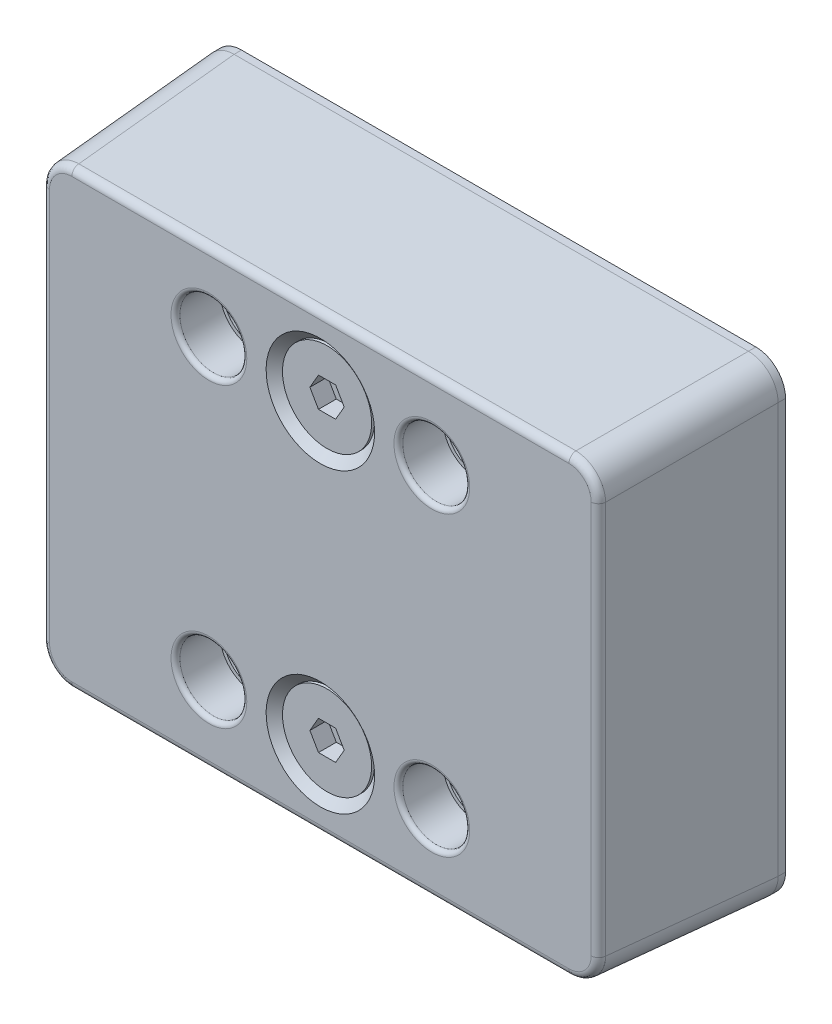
ISO-10303-21;
HEADER;
FILE_DESCRIPTION(('STEP AP214'),'2;1');
FILE_NAME('part.step','',(''),(''),'','','');
FILE_SCHEMA(('AUTOMOTIVE_DESIGN { 1 0 10303 214 1 1 1 1 }'));
ENDSEC;
DATA;
#1=APPLICATION_CONTEXT('core data for automotive mechanical design processes');
#2=APPLICATION_PROTOCOL_DEFINITION('international standard','automotive_design',2000,#1);
#3=PRODUCT_CONTEXT('',#1,'mechanical');
#4=PRODUCT('Part','Part','',(#3));
#5=PRODUCT_RELATED_PRODUCT_CATEGORY('part','',(#4));
#6=PRODUCT_DEFINITION_FORMATION('','',#4);
#7=PRODUCT_DEFINITION_CONTEXT('part definition',#1,'design');
#8=PRODUCT_DEFINITION('design','',#6,#7);
#9=PRODUCT_DEFINITION_SHAPE('','',#8);
#10=(LENGTH_UNIT() NAMED_UNIT(*) SI_UNIT(.MILLI.,.METRE.));
#11=(NAMED_UNIT(*) PLANE_ANGLE_UNIT() SI_UNIT($,.RADIAN.));
#12=(NAMED_UNIT(*) SI_UNIT($,.STERADIAN.) SOLID_ANGLE_UNIT());
#13=UNCERTAINTY_MEASURE_WITH_UNIT(LENGTH_MEASURE(1.E-05),#10,'distance_accuracy_value','');
#14=(GEOMETRIC_REPRESENTATION_CONTEXT(3) GLOBAL_UNCERTAINTY_ASSIGNED_CONTEXT((#13)) GLOBAL_UNIT_ASSIGNED_CONTEXT((#10,
#11,#12)) REPRESENTATION_CONTEXT('',''));
#15=CARTESIAN_POINT('',(0.,0.,0.));
#16=DIRECTION('',(0.,0.,1.));
#17=DIRECTION('',(1.,0.,0.));
#18=AXIS2_PLACEMENT_3D('',#15,#16,#17);
#19=CARTESIAN_POINT('',(0.,-10.,12.));
#20=DIRECTION('',(0.,0.,1.));
#21=DIRECTION('',(0.,-1.,0.));
#22=AXIS2_PLACEMENT_3D('',#19,#20,#21);
#23=CONICAL_SURFACE('',#22,3.65,0.785398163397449);
#24=CARTESIAN_POINT('',(0.,-10.,12.));
#25=DIRECTION('',(0.,0.,1.));
#26=DIRECTION('',(0.,-1.,0.));
#27=AXIS2_PLACEMENT_3D('',#24,#25,#26);
#28=CIRCLE('',#27,3.65);
#29=CARTESIAN_POINT('',(0.,-13.65,12.));
#30=VERTEX_POINT('',#29);
#31=EDGE_CURVE('E540',#30,#30,#28,.T.);
#32=ORIENTED_EDGE('',*,*,#31,.T.);
#33=EDGE_LOOP('',(#32));
#34=FACE_BOUND('',#33,.T.);
#35=CARTESIAN_POINT('',(0.,-10.,11.35));
#36=DIRECTION('',(0.,0.,1.));
#37=DIRECTION('',(0.,-1.,0.));
#38=AXIS2_PLACEMENT_3D('',#35,#36,#37);
#39=CIRCLE('',#38,3.);
#40=CARTESIAN_POINT('',(0.,-13.,11.35));
#41=VERTEX_POINT('',#40);
#42=EDGE_CURVE('E162',#41,#41,#39,.T.);
#43=ORIENTED_EDGE('',*,*,#42,.F.);
#44=EDGE_LOOP('',(#43));
#45=FACE_BOUND('',#44,.T.);
#46=ADVANCED_FACE('F14',(#34,#45),#23,.F.);
#47=CARTESIAN_POINT('',(0.,10.,12.));
#48=DIRECTION('',(0.,0.,1.));
#49=DIRECTION('',(0.,-1.,0.));
#50=AXIS2_PLACEMENT_3D('',#47,#48,#49);
#51=CONICAL_SURFACE('',#50,3.65,0.785398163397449);
#52=CARTESIAN_POINT('',(0.,10.,12.));
#53=DIRECTION('',(0.,0.,1.));
#54=DIRECTION('',(0.,-1.,0.));
#55=AXIS2_PLACEMENT_3D('',#52,#53,#54);
#56=CIRCLE('',#55,3.65);
#57=CARTESIAN_POINT('',(0.,6.35,12.));
#58=VERTEX_POINT('',#57);
#59=EDGE_CURVE('E379',#58,#58,#56,.T.);
#60=ORIENTED_EDGE('',*,*,#59,.T.);
#61=EDGE_LOOP('',(#60));
#62=FACE_BOUND('',#61,.T.);
#63=CARTESIAN_POINT('',(0.,10.,11.35));
#64=DIRECTION('',(0.,0.,1.));
#65=DIRECTION('',(0.,-1.,0.));
#66=AXIS2_PLACEMENT_3D('',#63,#64,#65);
#67=CIRCLE('',#66,3.);
#68=CARTESIAN_POINT('',(0.,7.,11.35));
#69=VERTEX_POINT('',#68);
#70=EDGE_CURVE('E159',#69,#69,#67,.T.);
#71=ORIENTED_EDGE('',*,*,#70,.F.);
#72=EDGE_LOOP('',(#71));
#73=FACE_BOUND('',#72,.T.);
#74=ADVANCED_FACE('F675',(#62,#73),#51,.F.);
#75=CARTESIAN_POINT('',(0.,0.,12.));
#76=DIRECTION('',(0.,0.,1.));
#77=DIRECTION('',(0.,-1.,0.));
#78=AXIS2_PLACEMENT_3D('',#75,#76,#77);
#79=PLANE('',#78);
#80=CARTESIAN_POINT('',(-7.5,-10.,12.));
#81=DIRECTION('',(0.,0.,1.));
#82=DIRECTION('',(1.,0.,0.));
#83=AXIS2_PLACEMENT_3D('',#80,#81,#82);
#84=CIRCLE('',#83,2.55);
#85=CARTESIAN_POINT('',(-4.95,-10.,12.));
#86=VERTEX_POINT('',#85);
#87=EDGE_CURVE('E179',#86,#86,#84,.F.);
#88=ORIENTED_EDGE('',*,*,#87,.T.);
#89=EDGE_LOOP('',(#88));
#90=FACE_BOUND('',#89,.T.);
#91=CARTESIAN_POINT('',(7.5,-10.,12.));
#92=DIRECTION('',(0.,0.,1.));
#93=DIRECTION('',(1.,0.,0.));
#94=AXIS2_PLACEMENT_3D('',#91,#92,#93);
#95=CIRCLE('',#94,2.55);
#96=CARTESIAN_POINT('',(10.05,-10.,12.));
#97=VERTEX_POINT('',#96);
#98=EDGE_CURVE('E176',#97,#97,#95,.F.);
#99=ORIENTED_EDGE('',*,*,#98,.T.);
#100=EDGE_LOOP('',(#99));
#101=FACE_BOUND('',#100,.T.);
#102=CARTESIAN_POINT('',(7.5,10.,12.));
#103=DIRECTION('',(0.,0.,1.));
#104=DIRECTION('',(1.,0.,0.));
#105=AXIS2_PLACEMENT_3D('',#102,#103,#104);
#106=CIRCLE('',#105,2.55);
#107=CARTESIAN_POINT('',(10.05,10.,12.));
#108=VERTEX_POINT('',#107);
#109=EDGE_CURVE('E173',#108,#108,#106,.F.);
#110=ORIENTED_EDGE('',*,*,#109,.T.);
#111=EDGE_LOOP('',(#110));
#112=FACE_BOUND('',#111,.T.);
#113=CARTESIAN_POINT('',(-7.5,10.,12.));
#114=DIRECTION('',(0.,0.,1.));
#115=DIRECTION('',(1.,0.,0.));
#116=AXIS2_PLACEMENT_3D('',#113,#114,#115);
#117=CIRCLE('',#116,2.55);
#118=CARTESIAN_POINT('',(-4.95,10.,12.));
#119=VERTEX_POINT('',#118);
#120=EDGE_CURVE('E170',#119,#119,#117,.F.);
#121=ORIENTED_EDGE('',*,*,#120,.T.);
#122=EDGE_LOOP('',(#121));
#123=FACE_BOUND('',#122,.T.);
#124=DIRECTION('',(0.,1.,0.));
#125=VECTOR('',#124,1.);
#126=CARTESIAN_POINT('',(-18.2228282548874,-13.2000514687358,12.));
#127=LINE('',#126,#125);
#128=CARTESIAN_POINT('',(-18.2228282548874,13.2248839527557,12.));
#129=VERTEX_POINT('',#128);
#130=CARTESIAN_POINT('',(-18.2228282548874,-13.2248839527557,12.));
#131=VERTEX_POINT('',#130);
#132=EDGE_CURVE('E585',#129,#131,#127,.F.);
#133=ORIENTED_EDGE('',*,*,#132,.T.);
#134=CARTESIAN_POINT('',(-16.7207697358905,-13.2207697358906,12.));
#135=DIRECTION('',(0.,0.,1.));
#136=DIRECTION('',(-0.707106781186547,-0.707106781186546,0.));
#137=AXIS2_PLACEMENT_3D('',#134,#135,#136);
#138=ELLIPSE('',#137,1.50411422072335,1.5);
#139=CARTESIAN_POINT('',(-16.7248839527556,-14.7228282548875,12.));
#140=VERTEX_POINT('',#139);
#141=EDGE_CURVE('E512',#131,#140,#138,.T.);
#142=ORIENTED_EDGE('',*,*,#141,.T.);
#143=DIRECTION('',(-1.,0.,0.));
#144=VECTOR('',#143,1.);
#145=CARTESIAN_POINT('',(16.7000514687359,-14.7228282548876,12.));
#146=LINE('',#145,#144);
#147=CARTESIAN_POINT('',(16.7248839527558,-14.7228282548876,12.));
#148=VERTEX_POINT('',#147);
#149=EDGE_CURVE('E460',#140,#148,#146,.F.);
#150=ORIENTED_EDGE('',*,*,#149,.T.);
#151=CARTESIAN_POINT('',(16.7207697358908,-13.2207697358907,12.));
#152=DIRECTION('',(0.,0.,1.));
#153=DIRECTION('',(0.707106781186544,-0.707106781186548,0.));
#154=AXIS2_PLACEMENT_3D('',#151,#152,#153);
#155=ELLIPSE('',#154,1.50411422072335,1.5);
#156=CARTESIAN_POINT('',(18.2228282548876,-13.2248839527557,12.));
#157=VERTEX_POINT('',#156);
#158=EDGE_CURVE('E452',#148,#157,#155,.T.);
#159=ORIENTED_EDGE('',*,*,#158,.T.);
#160=DIRECTION('',(0.,-1.,0.));
#161=VECTOR('',#160,1.);
#162=CARTESIAN_POINT('',(18.2228282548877,13.2000514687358,12.));
#163=LINE('',#162,#161);
#164=CARTESIAN_POINT('',(18.2228282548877,13.2248839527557,12.));
#165=VERTEX_POINT('',#164);
#166=EDGE_CURVE('E591',#157,#165,#163,.F.);
#167=ORIENTED_EDGE('',*,*,#166,.T.);
#168=CARTESIAN_POINT('',(16.7207697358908,13.2207697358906,12.));
#169=DIRECTION('',(0.,0.,1.));
#170=DIRECTION('',(0.707106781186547,0.707106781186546,0.));
#171=AXIS2_PLACEMENT_3D('',#168,#169,#170);
#172=ELLIPSE('',#171,1.50411422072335,1.5);
#173=CARTESIAN_POINT('',(16.7248839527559,14.7228282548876,12.));
#174=VERTEX_POINT('',#173);
#175=EDGE_CURVE('E593',#165,#174,#172,.T.);
#176=ORIENTED_EDGE('',*,*,#175,.T.);
#177=DIRECTION('',(1.,0.,0.));
#178=VECTOR('',#177,1.);
#179=CARTESIAN_POINT('',(-16.7000514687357,14.7228282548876,12.));
#180=LINE('',#179,#178);
#181=CARTESIAN_POINT('',(-16.7248839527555,14.7228282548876,12.));
#182=VERTEX_POINT('',#181);
#183=EDGE_CURVE('E579',#174,#182,#180,.F.);
#184=ORIENTED_EDGE('',*,*,#183,.T.);
#185=CARTESIAN_POINT('',(-16.7207697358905,13.2207697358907,12.));
#186=DIRECTION('',(0.,0.,1.));
#187=DIRECTION('',(-0.707106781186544,0.707106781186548,0.));
#188=AXIS2_PLACEMENT_3D('',#185,#186,#187);
#189=ELLIPSE('',#188,1.50411422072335,1.5);
#190=EDGE_CURVE('E582',#182,#129,#189,.T.);
#191=ORIENTED_EDGE('',*,*,#190,.T.);
#192=EDGE_LOOP('',(#133,#142,#150,#159,#167,#176,#184,#191));
#193=FACE_BOUND('',#192,.T.);
#194=ORIENTED_EDGE('',*,*,#59,.F.);
#195=EDGE_LOOP('',(#194));
#196=FACE_BOUND('',#195,.T.);
#197=ORIENTED_EDGE('',*,*,#31,.F.);
#198=EDGE_LOOP('',(#197));
#199=FACE_BOUND('',#198,.T.);
#200=ADVANCED_FACE('F400',(#90,#101,#112,#123,#193,#196,#199),#79,.T.);
#201=CARTESIAN_POINT('',(-7.5,10.,9.));
#202=DIRECTION('',(0.,0.,1.));
#203=DIRECTION('',(0.,-1.,0.));
#204=AXIS2_PLACEMENT_3D('',#201,#202,#203);
#205=CYLINDRICAL_SURFACE('',#204,2.25);
#206=CARTESIAN_POINT('',(-7.5,10.,11.7));
#207=DIRECTION('',(0.,0.,1.));
#208=DIRECTION('',(1.,0.,0.));
#209=AXIS2_PLACEMENT_3D('',#206,#207,#208);
#210=CIRCLE('',#209,2.25);
#211=CARTESIAN_POINT('',(-5.25,10.,11.7));
#212=VERTEX_POINT('',#211);
#213=EDGE_CURVE('E9',#212,#212,#210,.T.);
#214=ORIENTED_EDGE('',*,*,#213,.T.);
#215=EDGE_LOOP('',(#214));
#216=FACE_BOUND('',#215,.T.);
#217=CARTESIAN_POINT('',(-7.5,10.,9.));
#218=DIRECTION('',(0.,0.,1.));
#219=DIRECTION('',(0.,-1.,0.));
#220=AXIS2_PLACEMENT_3D('',#217,#218,#219);
#221=CIRCLE('',#220,2.25);
#222=CARTESIAN_POINT('',(-7.5,7.75,9.));
#223=VERTEX_POINT('',#222);
#224=EDGE_CURVE('E364',#223,#223,#221,.T.);
#225=ORIENTED_EDGE('',*,*,#224,.F.);
#226=EDGE_LOOP('',(#225));
#227=FACE_BOUND('',#226,.T.);
#228=ADVANCED_FACE('F663',(#216,#227),#205,.F.);
#229=CARTESIAN_POINT('',(-7.5,-10.,9.));
#230=DIRECTION('',(0.,0.,1.));
#231=DIRECTION('',(0.,-1.,0.));
#232=AXIS2_PLACEMENT_3D('',#229,#230,#231);
#233=CYLINDRICAL_SURFACE('',#232,2.25);
#234=CARTESIAN_POINT('',(-7.5,-10.,11.7));
#235=DIRECTION('',(0.,0.,1.));
#236=DIRECTION('',(1.,0.,0.));
#237=AXIS2_PLACEMENT_3D('',#234,#235,#236);
#238=CIRCLE('',#237,2.25);
#239=CARTESIAN_POINT('',(-5.25,-10.,11.7));
#240=VERTEX_POINT('',#239);
#241=EDGE_CURVE('E167',#240,#240,#238,.T.);
#242=ORIENTED_EDGE('',*,*,#241,.T.);
#243=EDGE_LOOP('',(#242));
#244=FACE_BOUND('',#243,.T.);
#245=CARTESIAN_POINT('',(-7.5,-10.,9.));
#246=DIRECTION('',(0.,0.,1.));
#247=DIRECTION('',(0.,-1.,0.));
#248=AXIS2_PLACEMENT_3D('',#245,#246,#247);
#249=CIRCLE('',#248,2.25);
#250=CARTESIAN_POINT('',(-7.5,-12.25,9.));
#251=VERTEX_POINT('',#250);
#252=EDGE_CURVE('E533',#251,#251,#249,.T.);
#253=ORIENTED_EDGE('',*,*,#252,.F.);
#254=EDGE_LOOP('',(#253));
#255=FACE_BOUND('',#254,.T.);
#256=ADVANCED_FACE('F665',(#244,#255),#233,.F.);
#257=CARTESIAN_POINT('',(7.5,-10.,9.));
#258=DIRECTION('',(0.,0.,1.));
#259=DIRECTION('',(0.,-1.,0.));
#260=AXIS2_PLACEMENT_3D('',#257,#258,#259);
#261=CYLINDRICAL_SURFACE('',#260,2.25);
#262=CARTESIAN_POINT('',(7.5,-10.,11.7));
#263=DIRECTION('',(0.,0.,1.));
#264=DIRECTION('',(1.,0.,0.));
#265=AXIS2_PLACEMENT_3D('',#262,#263,#264);
#266=CIRCLE('',#265,2.25);
#267=CARTESIAN_POINT('',(9.75,-10.,11.7));
#268=VERTEX_POINT('',#267);
#269=EDGE_CURVE('E182',#268,#268,#266,.T.);
#270=ORIENTED_EDGE('',*,*,#269,.T.);
#271=EDGE_LOOP('',(#270));
#272=FACE_BOUND('',#271,.T.);
#273=CARTESIAN_POINT('',(7.5,-10.,9.));
#274=DIRECTION('',(0.,0.,1.));
#275=DIRECTION('',(0.,-1.,0.));
#276=AXIS2_PLACEMENT_3D('',#273,#274,#275);
#277=CIRCLE('',#276,2.25);
#278=CARTESIAN_POINT('',(7.5,-12.25,9.));
#279=VERTEX_POINT('',#278);
#280=EDGE_CURVE('E528',#279,#279,#277,.T.);
#281=ORIENTED_EDGE('',*,*,#280,.F.);
#282=EDGE_LOOP('',(#281));
#283=FACE_BOUND('',#282,.T.);
#284=ADVANCED_FACE('F672',(#272,#283),#261,.F.);
#285=CARTESIAN_POINT('',(7.5,10.,9.));
#286=DIRECTION('',(0.,0.,1.));
#287=DIRECTION('',(0.,-1.,0.));
#288=AXIS2_PLACEMENT_3D('',#285,#286,#287);
#289=CYLINDRICAL_SURFACE('',#288,2.25);
#290=CARTESIAN_POINT('',(7.5,10.,11.7));
#291=DIRECTION('',(0.,0.,1.));
#292=DIRECTION('',(1.,0.,0.));
#293=AXIS2_PLACEMENT_3D('',#290,#291,#292);
#294=CIRCLE('',#293,2.25);
#295=CARTESIAN_POINT('',(9.75,10.,11.7));
#296=VERTEX_POINT('',#295);
#297=EDGE_CURVE('E23',#296,#296,#294,.T.);
#298=ORIENTED_EDGE('',*,*,#297,.T.);
#299=EDGE_LOOP('',(#298));
#300=FACE_BOUND('',#299,.T.);
#301=CARTESIAN_POINT('',(7.5,10.,9.));
#302=DIRECTION('',(0.,0.,1.));
#303=DIRECTION('',(0.,-1.,0.));
#304=AXIS2_PLACEMENT_3D('',#301,#302,#303);
#305=CIRCLE('',#304,2.25);
#306=CARTESIAN_POINT('',(7.5,7.75,9.));
#307=VERTEX_POINT('',#306);
#308=EDGE_CURVE('E521',#307,#307,#305,.T.);
#309=ORIENTED_EDGE('',*,*,#308,.F.);
#310=EDGE_LOOP('',(#309));
#311=FACE_BOUND('',#310,.T.);
#312=ADVANCED_FACE('F187',(#300,#311),#289,.F.);
#313=CARTESIAN_POINT('',(-18.2228282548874,0.,11.5));
#314=DIRECTION('',(0.,-1.,0.));
#315=DIRECTION('',(0.,0.,-1.));
#316=AXIS2_PLACEMENT_3D('',#313,#314,#315);
#317=CYLINDRICAL_SURFACE('',#316,0.5);
#318=CARTESIAN_POINT('',(-18.2228282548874,13.2248839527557,11.5));
#319=DIRECTION('',(0.,1.,0.));
#320=DIRECTION('',(0.,0.,1.));
#321=AXIS2_PLACEMENT_3D('',#318,#319,#320);
#322=CIRCLE('',#321,0.5);
#323=CARTESIAN_POINT('',(-18.7221430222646,13.2248839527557,11.5261679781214));
#324=VERTEX_POINT('',#323);
#325=EDGE_CURVE('E434',#324,#129,#322,.T.);
#326=ORIENTED_EDGE('',*,*,#325,.F.);
#327=DIRECTION('',(0.,-1.,0.));
#328=VECTOR('',#327,1.);
#329=CARTESIAN_POINT('',(-18.7221430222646,13.2000514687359,11.5261679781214));
#330=LINE('',#329,#328);
#331=CARTESIAN_POINT('',(-18.7221430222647,-13.2248839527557,11.5261679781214));
#332=VERTEX_POINT('',#331);
#333=EDGE_CURVE('E499',#332,#324,#330,.F.);
#334=ORIENTED_EDGE('',*,*,#333,.F.);
#335=CARTESIAN_POINT('',(-18.2228282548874,-13.2248839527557,11.5));
#336=DIRECTION('',(0.,1.,0.));
#337=DIRECTION('',(0.,0.,1.));
#338=AXIS2_PLACEMENT_3D('',#335,#336,#337);
#339=CIRCLE('',#338,0.5);
#340=EDGE_CURVE('E380',#332,#131,#339,.T.);
#341=ORIENTED_EDGE('',*,*,#340,.T.);
#342=ORIENTED_EDGE('',*,*,#132,.F.);
#343=EDGE_LOOP('',(#326,#334,#341,#342));
#344=FACE_BOUND('',#343,.T.);
#345=ADVANCED_FACE('F399',(#344),#317,.T.);
#346=CARTESIAN_POINT('',(-18.1369254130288,-14.6369254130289,11.5369565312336));
#347=CARTESIAN_POINT('',(-18.1126583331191,-14.6126583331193,12.));
#348=CARTESIAN_POINT('',(-17.7843391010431,-14.2843391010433,12.));
#349=CARTESIAN_POINT('',(-18.0752178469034,-14.6986329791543,11.5369565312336));
#350=CARTESIAN_POINT('',(-18.0520125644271,-14.6733041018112,12.));
#351=CARTESIAN_POINT('',(-17.7380584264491,-14.3306197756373,12.));
#352=CARTESIAN_POINT('',(-18.0094600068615,-14.7562902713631,11.5368508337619));
#353=CARTESIAN_POINT('',(-17.9874375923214,-14.7300445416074,12.));
#354=CARTESIAN_POINT('',(-17.6887358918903,-14.3738585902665,12.));
#355=CARTESIAN_POINT('',(-17.8709697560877,-14.8625184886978,11.536429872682));
#356=CARTESIAN_POINT('',(-17.8515319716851,-14.8347475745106,12.));
#357=CARTESIAN_POINT('',(-17.5848516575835,-14.453513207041,12.));
#358=CARTESIAN_POINT('',(-17.7982366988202,-14.9110885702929,11.536114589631));
#359=CARTESIAN_POINT('',(-17.7801714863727,-14.8827263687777,12.));
#360=CARTESIAN_POINT('',(-17.5302894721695,-14.489928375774,12.));
#361=CARTESIAN_POINT('',(-17.6470411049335,-14.9983122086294,11.5352798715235));
#362=CARTESIAN_POINT('',(-17.6318547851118,-14.9691231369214,12.));
#363=CARTESIAN_POINT('',(-17.4168599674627,-14.5553132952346,12.));
#364=CARTESIAN_POINT('',(-17.5685775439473,-15.0369639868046,11.5347603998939));
#365=CARTESIAN_POINT('',(-17.5548648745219,-15.0075484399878,12.));
#366=CARTESIAN_POINT('',(-17.3579918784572,-14.5842817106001,12.));
#367=CARTESIAN_POINT('',(-17.4072637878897,-15.103690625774,11.5335262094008));
#368=CARTESIAN_POINT('',(-17.3965378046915,-15.0742028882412,12.));
#369=CARTESIAN_POINT('',(-17.2369580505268,-14.63427817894,12.));
#370=CARTESIAN_POINT('',(-17.3244124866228,-15.131762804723,11.5328114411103));
#371=CARTESIAN_POINT('',(-17.3151654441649,-15.1024298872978,12.));
#372=CARTESIAN_POINT('',(-17.1747914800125,-14.6553042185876,12.));
#373=CARTESIAN_POINT('',(-17.1557408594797,-15.1768508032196,11.5311988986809));
#374=CARTESIAN_POINT('',(-17.1493930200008,-15.1482094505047,12.));
#375=CARTESIAN_POINT('',(-17.0482243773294,-14.6890568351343,12.));
#376=CARTESIAN_POINT('',(-17.0699196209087,-15.193863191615,11.5303010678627));
#377=CARTESIAN_POINT('',(-17.0649586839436,-15.165750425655,12.));
#378=CARTESIAN_POINT('',(-16.9838231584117,-14.7017808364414,12.));
#379=CARTESIAN_POINT('',(-16.8967762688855,-15.2165412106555,11.5283377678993));
#380=CARTESIAN_POINT('',(-16.8944345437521,-15.189844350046,12.));
#381=CARTESIAN_POINT('',(-16.8538884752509,-14.7187121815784,12.));
#382=CARTESIAN_POINT('',(-16.8094536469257,-15.2222029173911,11.5272722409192));
#383=CARTESIAN_POINT('',(-16.8083137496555,-15.1963769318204,12.));
#384=CARTESIAN_POINT('',(-16.788354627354,-14.722916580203,12.));
#385=CARTESIAN_POINT('',(-16.6348011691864,-15.2220830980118,11.5249917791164));
#386=CARTESIAN_POINT('',(-16.6358224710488,-15.1983109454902,12.));
#387=CARTESIAN_POINT('',(-16.6572756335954,-14.7227370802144,12.));
#388=CARTESIAN_POINT('',(-16.5474713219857,-15.2162974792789,11.5237767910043));
#389=CARTESIAN_POINT('',(-16.5494263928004,-15.193684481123,12.));
#390=CARTESIAN_POINT('',(-16.5917304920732,-14.7183501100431,12.));
#391=CARTESIAN_POINT('',(-16.3742980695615,-15.1933820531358,11.5212181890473));
#392=CARTESIAN_POINT('',(-16.3778040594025,-15.1733316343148,12.));
#393=CARTESIAN_POINT('',(-16.4617499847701,-14.7010629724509,12.));
#394=CARTESIAN_POINT('',(-16.2884551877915,-15.1762483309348,11.5198745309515));
#395=CARTESIAN_POINT('',(-16.2925593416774,-15.1575715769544,12.));
#396=CARTESIAN_POINT('',(-16.3973150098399,-14.6881598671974,12.));
#397=CARTESIAN_POINT('',(-16.1197241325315,-15.1309295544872,11.5170815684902));
#398=CARTESIAN_POINT('',(-16.1246526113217,-15.1151590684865,12.));
#399=CARTESIAN_POINT('',(-16.2706569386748,-14.6540610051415,12.));
#400=CARTESIAN_POINT('',(-16.0368368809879,-15.10274108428,11.5156322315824));
#401=CARTESIAN_POINT('',(-16.0419805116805,-15.0884692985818,12.));
#402=CARTESIAN_POINT('',(-16.2084345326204,-14.6328626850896,12.));
#403=CARTESIAN_POINT('',(-15.8754349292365,-15.0357945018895,11.5126526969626));
#404=CARTESIAN_POINT('',(-15.8806044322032,-15.0245810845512,12.));
#405=CARTESIAN_POINT('',(-16.0872659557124,-14.5825356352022,12.));
#406=CARTESIAN_POINT('',(-15.7969213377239,-14.9970337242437,11.5111224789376));
#407=CARTESIAN_POINT('',(-15.8018994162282,-14.9873440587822,12.));
#408=CARTESIAN_POINT('',(-16.0283206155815,-14.5534049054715,12.));
#409=CARTESIAN_POINT('',(-15.645609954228,-14.9096048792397,11.5080073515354));
#410=CARTESIAN_POINT('',(-15.6497942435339,-14.9029190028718,12.));
#411=CARTESIAN_POINT('',(-15.9147146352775,-14.4877108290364,12.));
#412=CARTESIAN_POINT('',(-15.5728131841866,-14.8609350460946,11.5064224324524));
#413=CARTESIAN_POINT('',(-15.5764021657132,-14.8556936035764,12.));
#414=CARTESIAN_POINT('',(-15.8600547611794,-14.4511461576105,12.));
#415=CARTESIAN_POINT('',(-15.4341811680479,-14.7545198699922,11.5032250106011));
#416=CARTESIAN_POINT('',(-15.4361894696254,-14.752018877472,12.));
#417=CARTESIAN_POINT('',(-15.7559550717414,-14.3712090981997,12.));
#418=CARTESIAN_POINT('',(-15.3683465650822,-14.6967736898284,11.5016125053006));
#419=CARTESIAN_POINT('',(-15.3693854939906,-14.6955358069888,12.));
#420=CARTESIAN_POINT('',(-15.7065157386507,-14.3278360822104,12.));
#421=CARTESIAN_POINT('',(-15.2447657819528,-14.5731929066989,11.4983874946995));
#422=CARTESIAN_POINT('',(-15.2435239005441,-14.5742351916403,12.));
#423=CARTESIAN_POINT('',(-15.6137033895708,-14.2350237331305,12.));
#424=CARTESIAN_POINT('',(-15.187019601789,-14.5073583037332,11.4967749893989));
#425=CARTESIAN_POINT('',(-15.1844903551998,-14.5093897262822,12.));
#426=CARTESIAN_POINT('',(-15.5703303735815,-14.1855844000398,12.));
#427=CARTESIAN_POINT('',(-15.0806044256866,-14.3687262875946,11.4935775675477));
#428=CARTESIAN_POINT('',(-15.0752313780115,-14.3724064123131,12.));
#429=CARTESIAN_POINT('',(-15.4903933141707,-14.0814847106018,12.));
#430=CARTESIAN_POINT('',(-15.0319345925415,-14.2959295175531,11.4919926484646));
#431=CARTESIAN_POINT('',(-15.0250358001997,-14.300248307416,12.));
#432=CARTESIAN_POINT('',(-15.4538286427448,-14.0268248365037,12.));
#433=CARTESIAN_POINT('',(-14.9445057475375,-14.1446181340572,11.4888775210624));
#434=CARTESIAN_POINT('',(-14.9343803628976,-14.1498217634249,12.));
#435=CARTESIAN_POINT('',(-15.3881345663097,-13.9132188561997,12.));
#436=CARTESIAN_POINT('',(-14.9057449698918,-14.0661045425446,11.4873473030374));
#437=CARTESIAN_POINT('',(-14.8939540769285,-14.0715420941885,12.));
#438=CARTESIAN_POINT('',(-15.359003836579,-13.8542735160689,12.));
#439=CARTESIAN_POINT('',(-14.8387983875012,-13.9047025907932,11.4843677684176));
#440=CARTESIAN_POINT('',(-14.8236105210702,-13.9101785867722,12.));
#441=CARTESIAN_POINT('',(-15.3086767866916,-13.7331049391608,12.));
#442=CARTESIAN_POINT('',(-14.8106099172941,-13.8218153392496,11.4829184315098));
#443=CARTESIAN_POINT('',(-14.7937281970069,-13.8270933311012,12.));
#444=CARTESIAN_POINT('',(-15.2874784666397,-13.6708825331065,12.));
#445=CARTESIAN_POINT('',(-14.7652911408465,-13.6530842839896,11.4801254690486));
#446=CARTESIAN_POINT('',(-14.7450727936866,-13.6575297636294,12.));
#447=CARTESIAN_POINT('',(-15.2533796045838,-13.5442244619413,12.));
#448=CARTESIAN_POINT('',(-14.7481574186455,-13.5672414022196,11.4787818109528));
#449=CARTESIAN_POINT('',(-14.7263335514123,-13.5710599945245,12.));
#450=CARTESIAN_POINT('',(-15.2404764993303,-13.4797894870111,12.));
#451=CARTESIAN_POINT('',(-14.7252419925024,-13.3940681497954,11.4762232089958));
#452=CARTESIAN_POINT('',(-14.7003747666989,-13.3962209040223,12.));
#453=CARTESIAN_POINT('',(-15.2231893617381,-13.349808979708,12.));
#454=CARTESIAN_POINT('',(-14.7194563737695,-13.3067383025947,11.4750082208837));
#455=CARTESIAN_POINT('',(-14.6931855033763,-13.3078695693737,12.));
#456=CARTESIAN_POINT('',(-15.2188023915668,-13.2842638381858,12.));
#457=CARTESIAN_POINT('',(-14.7193365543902,-13.1320858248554,11.4727277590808));
#458=CARTESIAN_POINT('',(-14.6905334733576,-13.1308173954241,12.));
#459=CARTESIAN_POINT('',(-15.2186228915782,-13.1531848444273,12.));
#460=CARTESIAN_POINT('',(-14.7249982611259,-13.0447632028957,11.4716622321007));
#461=CARTESIAN_POINT('',(-14.6950951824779,-13.0421428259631,12.));
#462=CARTESIAN_POINT('',(-15.2228272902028,-13.0876509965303,12.));
#463=CARTESIAN_POINT('',(-14.7476762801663,-12.8716198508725,11.4696989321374));
#464=CARTESIAN_POINT('',(-14.7159379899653,-12.8660219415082,12.));
#465=CARTESIAN_POINT('',(-15.2397586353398,-12.9577163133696,12.));
#466=CARTESIAN_POINT('',(-14.7646886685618,-12.7857986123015,11.4688011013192));
#467=CARTESIAN_POINT('',(-14.7322358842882,-12.7786084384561,12.));
#468=CARTESIAN_POINT('',(-15.2524826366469,-12.8933150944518,12.));
#469=CARTESIAN_POINT('',(-14.8097766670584,-12.6171269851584,11.4671885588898));
#470=CARTESIAN_POINT('',(-14.7763242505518,-12.6065838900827,12.));
#471=CARTESIAN_POINT('',(-15.2862352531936,-12.7667479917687,12.));
#472=CARTESIAN_POINT('',(-14.8378488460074,-12.5342756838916,11.4664737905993));
#473=CARTESIAN_POINT('',(-14.804122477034,-12.5220099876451,12.));
#474=CARTESIAN_POINT('',(-15.3072612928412,-12.7045814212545,12.));
#475=CARTESIAN_POINT('',(-14.9045754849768,-12.372961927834,11.4652396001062));
#476=CARTESIAN_POINT('',(-14.8707643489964,-12.3572023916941,12.));
#477=CARTESIAN_POINT('',(-15.3572577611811,-12.583547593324,12.));
#478=CARTESIAN_POINT('',(-14.943227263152,-12.2944983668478,11.4647201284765));
#479=CARTESIAN_POINT('',(-14.9096059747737,-12.2770076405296,12.));
#480=CARTESIAN_POINT('',(-15.3862261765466,-12.5246795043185,12.));
#481=CARTESIAN_POINT('',(-15.0304509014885,-12.1433027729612,11.4638854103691));
#482=CARTESIAN_POINT('',(-14.9976721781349,-12.1224261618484,12.));
#483=CARTESIAN_POINT('',(-15.4516110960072,-12.4112499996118,12.));
#484=CARTESIAN_POINT('',(-15.0790209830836,-12.0705697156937,11.4635701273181));
#485=CARTESIAN_POINT('',(-15.0468849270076,-12.0480775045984,12.));
#486=CARTESIAN_POINT('',(-15.4880262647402,-12.3566878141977,12.));
#487=CARTESIAN_POINT('',(-15.1852492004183,-11.9320794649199,11.4631491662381));
#488=CARTESIAN_POINT('',(-15.1548265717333,-11.9065532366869,12.));
#489=CARTESIAN_POINT('',(-15.5676808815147,-12.2528035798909,12.));
#490=CARTESIAN_POINT('',(-15.2429064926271,-11.8663216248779,11.4630434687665));
#491=CARTESIAN_POINT('',(-15.2135345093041,-11.8394122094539,12.));
#492=CARTESIAN_POINT('',(-15.6109196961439,-12.2034810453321,12.));
#493=CARTESIAN_POINT('',(-15.3663216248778,-11.7429064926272,11.4630434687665));
#494=CARTESIAN_POINT('',(-15.3394122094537,-11.7135345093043,12.));
#495=CARTESIAN_POINT('',(-15.703481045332,-12.110919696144,12.));
#496=CARTESIAN_POINT('',(-15.4320794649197,-11.6852492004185,11.4631491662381));
#497=CARTESIAN_POINT('',(-15.4065532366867,-11.6548265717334,12.));
#498=CARTESIAN_POINT('',(-15.7528035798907,-12.0676808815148,12.));
#499=CARTESIAN_POINT('',(-15.5705697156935,-11.5790209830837,11.4635701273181));
#500=CARTESIAN_POINT('',(-15.5480775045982,-11.5468849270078,12.));
#501=CARTESIAN_POINT('',(-15.8566878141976,-11.9880262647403,12.));
#502=CARTESIAN_POINT('',(-15.643302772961,-11.5304509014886,11.4638854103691));
#503=CARTESIAN_POINT('',(-15.6224261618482,-11.4976721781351,12.));
#504=CARTESIAN_POINT('',(-15.9112499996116,-11.9516110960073,12.));
#505=CARTESIAN_POINT('',(-15.7944983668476,-11.4432272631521,11.4647201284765));
#506=CARTESIAN_POINT('',(-15.7770076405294,-11.4096059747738,12.));
#507=CARTESIAN_POINT('',(-16.0246795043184,-11.8862261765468,12.));
#508=CARTESIAN_POINT('',(-15.8729619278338,-11.4045754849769,11.4652396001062));
#509=CARTESIAN_POINT('',(-15.8572023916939,-11.3707643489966,12.));
#510=CARTESIAN_POINT('',(-16.0835475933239,-11.8572577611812,12.));
#511=CARTESIAN_POINT('',(-16.0342756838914,-11.3378488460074,11.4664737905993));
#512=CARTESIAN_POINT('',(-16.0220099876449,-11.3041224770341,12.));
#513=CARTESIAN_POINT('',(-16.2045814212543,-11.8072612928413,12.));
#514=CARTESIAN_POINT('',(-16.1171269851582,-11.3097766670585,11.4671885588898));
#515=CARTESIAN_POINT('',(-16.1065838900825,-11.2763242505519,12.));
#516=CARTESIAN_POINT('',(-16.2667479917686,-11.7862352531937,12.));
#517=CARTESIAN_POINT('',(-16.2857986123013,-11.2646886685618,11.4688011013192));
#518=CARTESIAN_POINT('',(-16.2786084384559,-11.2322358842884,12.));
#519=CARTESIAN_POINT('',(-16.3933150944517,-11.752482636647,12.));
#520=CARTESIAN_POINT('',(-16.3716198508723,-11.2476762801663,11.4696989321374));
#521=CARTESIAN_POINT('',(-16.3660219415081,-11.2159379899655,12.));
#522=CARTESIAN_POINT('',(-16.4577163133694,-11.73975863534,12.));
#523=CARTESIAN_POINT('',(-16.5447632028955,-11.2249982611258,11.4716622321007));
#524=CARTESIAN_POINT('',(-16.5421428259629,-11.195095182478,12.));
#525=CARTESIAN_POINT('',(-16.5876509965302,-11.722827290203,12.));
#526=CARTESIAN_POINT('',(-16.6320858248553,-11.2193365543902,11.4727277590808));
#527=CARTESIAN_POINT('',(-16.6308173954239,-11.1905334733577,12.));
#528=CARTESIAN_POINT('',(-16.6531848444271,-11.7186228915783,12.));
#529=CARTESIAN_POINT('',(-16.8067383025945,-11.2194563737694,11.4750082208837));
#530=CARTESIAN_POINT('',(-16.8078695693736,-11.1931855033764,12.));
#531=CARTESIAN_POINT('',(-16.7842638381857,-11.7188023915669,12.));
#532=CARTESIAN_POINT('',(-16.8940681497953,-11.2252419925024,11.4762232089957));
#533=CARTESIAN_POINT('',(-16.8962209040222,-11.200374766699,12.));
#534=CARTESIAN_POINT('',(-16.8498089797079,-11.7231893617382,12.));
#535=CARTESIAN_POINT('',(-17.0672414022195,-11.2481574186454,11.4787818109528));
#536=CARTESIAN_POINT('',(-17.0710599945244,-11.2263335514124,12.));
#537=CARTESIAN_POINT('',(-16.979789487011,-11.7404764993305,12.));
#538=CARTESIAN_POINT('',(-17.1530842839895,-11.2652911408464,11.4801254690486));
#539=CARTESIAN_POINT('',(-17.1575297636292,-11.2450727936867,12.));
#540=CARTESIAN_POINT('',(-17.0442244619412,-11.7533796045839,12.));
#541=CARTESIAN_POINT('',(-17.3218153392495,-11.310609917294,11.4829184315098));
#542=CARTESIAN_POINT('',(-17.327093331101,-11.2937281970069,12.));
#543=CARTESIAN_POINT('',(-17.1708825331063,-11.7874784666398,12.));
#544=CARTESIAN_POINT('',(-17.4047025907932,-11.3387983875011,11.4843677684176));
#545=CARTESIAN_POINT('',(-17.410178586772,-11.3236105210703,12.));
#546=CARTESIAN_POINT('',(-17.2331049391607,-11.8086767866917,12.));
#547=CARTESIAN_POINT('',(-17.5661045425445,-11.4057449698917,11.4873473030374));
#548=CARTESIAN_POINT('',(-17.5715420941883,-11.3939540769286,12.));
#549=CARTESIAN_POINT('',(-17.3542735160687,-11.8590038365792,12.));
#550=CARTESIAN_POINT('',(-17.6446181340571,-11.4445057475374,11.4888775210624));
#551=CARTESIAN_POINT('',(-17.6498217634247,-11.4343803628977,12.));
#552=CARTESIAN_POINT('',(-17.4132188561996,-11.8881345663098,12.));
#553=CARTESIAN_POINT('',(-17.7959295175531,-11.5319345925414,11.4919926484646));
#554=CARTESIAN_POINT('',(-17.8002483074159,-11.5250358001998,12.));
#555=CARTESIAN_POINT('',(-17.5268248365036,-11.9538286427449,12.));
#556=CARTESIAN_POINT('',(-17.8687262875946,-11.5806044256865,11.4935775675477));
#557=CARTESIAN_POINT('',(-17.872406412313,-11.5752313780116,12.));
#558=CARTESIAN_POINT('',(-17.5814847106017,-11.9903933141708,12.));
#559=CARTESIAN_POINT('',(-18.0073583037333,-11.6870196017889,11.4967749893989));
#560=CARTESIAN_POINT('',(-18.009389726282,-11.6844903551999,12.));
#561=CARTESIAN_POINT('',(-17.6855844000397,-12.0703303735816,12.));
#562=CARTESIAN_POINT('',(-18.073192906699,-11.7447657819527,11.4983874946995));
#563=CARTESIAN_POINT('',(-18.0742351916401,-11.7435239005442,12.));
#564=CARTESIAN_POINT('',(-17.7350237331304,-12.1137033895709,12.));
#565=CARTESIAN_POINT('',(-18.1967736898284,-11.8683465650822,11.5016125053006));
#566=CARTESIAN_POINT('',(-18.1955358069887,-11.8693854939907,12.));
#567=CARTESIAN_POINT('',(-17.8278360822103,-12.2065157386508,12.));
#568=CARTESIAN_POINT('',(-18.2545198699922,-11.9341811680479,11.5032250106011));
#569=CARTESIAN_POINT('',(-18.2520188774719,-11.9361894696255,12.));
#570=CARTESIAN_POINT('',(-17.8712090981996,-12.2559550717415,12.));
#571=CARTESIAN_POINT('',(-18.3609350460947,-12.0728131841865,11.5064224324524));
#572=CARTESIAN_POINT('',(-18.3556936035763,-12.0764021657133,12.));
#573=CARTESIAN_POINT('',(-17.9511461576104,-12.3600547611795,12.));
#574=CARTESIAN_POINT('',(-18.4096048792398,-12.145609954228,11.5080073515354));
#575=CARTESIAN_POINT('',(-18.4029190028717,-12.149794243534,12.));
#576=CARTESIAN_POINT('',(-17.9877108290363,-12.4147146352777,12.));
#577=CARTESIAN_POINT('',(-18.4970337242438,-12.296921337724,11.5111224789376));
#578=CARTESIAN_POINT('',(-18.4873440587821,-12.3018994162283,12.));
#579=CARTESIAN_POINT('',(-18.0534049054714,-12.5283206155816,12.));
#580=CARTESIAN_POINT('',(-18.5357945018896,-12.3754349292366,11.5126526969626));
#581=CARTESIAN_POINT('',(-18.524581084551,-12.3806044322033,12.));
#582=CARTESIAN_POINT('',(-18.082535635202,-12.5872659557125,12.));
#583=CARTESIAN_POINT('',(-18.6027410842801,-12.5368368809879,11.5156322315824));
#584=CARTESIAN_POINT('',(-18.5884692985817,-12.5419805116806,12.));
#585=CARTESIAN_POINT('',(-18.1328626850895,-12.7084345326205,12.));
#586=CARTESIAN_POINT('',(-18.6309295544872,-12.6197241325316,11.5170815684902));
#587=CARTESIAN_POINT('',(-18.6151590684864,-12.6246526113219,12.));
#588=CARTESIAN_POINT('',(-18.1540610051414,-12.7706569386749,12.));
#589=CARTESIAN_POINT('',(-18.6762483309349,-12.7884551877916,11.5198745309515));
#590=CARTESIAN_POINT('',(-18.6575715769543,-12.7925593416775,12.));
#591=CARTESIAN_POINT('',(-18.1881598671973,-12.89731500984,12.));
#592=CARTESIAN_POINT('',(-18.6933820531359,-12.8742980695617,11.5212181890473));
#593=CARTESIAN_POINT('',(-18.6733316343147,-12.8778040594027,12.));
#594=CARTESIAN_POINT('',(-18.2010629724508,-12.9617499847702,12.));
#595=CARTESIAN_POINT('',(-18.716297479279,-13.0474713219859,11.5237767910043));
#596=CARTESIAN_POINT('',(-18.6936844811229,-13.0494263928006,12.));
#597=CARTESIAN_POINT('',(-18.218350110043,-13.0917304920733,12.));
#598=CARTESIAN_POINT('',(-18.7220830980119,-13.1348011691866,11.5249917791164));
#599=CARTESIAN_POINT('',(-18.6983109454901,-13.1358224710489,12.));
#600=CARTESIAN_POINT('',(-18.2227370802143,-13.1572756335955,12.));
#601=CARTESIAN_POINT('',(-18.7222029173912,-13.3094536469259,11.5272722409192));
#602=CARTESIAN_POINT('',(-18.6963769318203,-13.3083137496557,12.));
#603=CARTESIAN_POINT('',(-18.2229165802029,-13.2883546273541,12.));
#604=CARTESIAN_POINT('',(-18.7165412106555,-13.3967762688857,11.5283377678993));
#605=CARTESIAN_POINT('',(-18.6898443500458,-13.3944345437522,12.));
#606=CARTESIAN_POINT('',(-18.2187121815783,-13.353888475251,12.));
#607=CARTESIAN_POINT('',(-18.6938631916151,-13.5699196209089,11.5303010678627));
#608=CARTESIAN_POINT('',(-18.6657504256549,-13.5649586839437,12.));
#609=CARTESIAN_POINT('',(-18.2017808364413,-13.4838231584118,12.));
#610=CARTESIAN_POINT('',(-18.6768508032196,-13.6557408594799,11.5311988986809));
#611=CARTESIAN_POINT('',(-18.6482094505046,-13.649393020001,12.));
#612=CARTESIAN_POINT('',(-18.1890568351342,-13.5482243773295,12.));
#613=CARTESIAN_POINT('',(-18.6317628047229,-13.824412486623,11.5328114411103));
#614=CARTESIAN_POINT('',(-18.6024298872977,-13.815165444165,12.));
#615=CARTESIAN_POINT('',(-18.1553042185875,-13.6747914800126,12.));
#616=CARTESIAN_POINT('',(-18.603690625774,-13.9072637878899,11.5335262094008));
#617=CARTESIAN_POINT('',(-18.5742028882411,-13.8965378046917,12.));
#618=CARTESIAN_POINT('',(-18.1342781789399,-13.7369580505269,12.));
#619=CARTESIAN_POINT('',(-18.5369639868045,-14.0685775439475,11.5347603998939));
#620=CARTESIAN_POINT('',(-18.5075484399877,-14.054864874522,12.));
#621=CARTESIAN_POINT('',(-18.0842817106,-13.8579918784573,12.));
#622=CARTESIAN_POINT('',(-18.4983122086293,-14.1470411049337,11.5352798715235));
#623=CARTESIAN_POINT('',(-18.4691231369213,-14.131854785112,12.));
#624=CARTESIAN_POINT('',(-18.0553132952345,-13.9168599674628,12.));
#625=CARTESIAN_POINT('',(-18.4110885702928,-14.2982366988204,11.536114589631));
#626=CARTESIAN_POINT('',(-18.3827263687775,-14.2801714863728,12.));
#627=CARTESIAN_POINT('',(-17.9899283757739,-14.0302894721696,12.));
#628=CARTESIAN_POINT('',(-18.3625184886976,-14.3709697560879,11.536429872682));
#629=CARTESIAN_POINT('',(-18.3347475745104,-14.3515319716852,12.));
#630=CARTESIAN_POINT('',(-17.9535132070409,-14.0848516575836,12.));
#631=CARTESIAN_POINT('',(-18.2562902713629,-14.5094600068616,11.5368508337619));
#632=CARTESIAN_POINT('',(-18.2300445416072,-14.4874375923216,12.));
#633=CARTESIAN_POINT('',(-17.8738585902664,-14.1887358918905,12.));
#634=CARTESIAN_POINT('',(-18.1986329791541,-14.5752178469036,11.5369565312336));
#635=CARTESIAN_POINT('',(-18.1733041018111,-14.5520125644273,12.));
#636=CARTESIAN_POINT('',(-17.8306197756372,-14.2380584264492,12.));
#637=CARTESIAN_POINT('',(-18.1369254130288,-14.6369254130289,11.5369565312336));
#638=CARTESIAN_POINT('',(-18.1126583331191,-14.6126583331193,12.));
#639=CARTESIAN_POINT('',(-17.7843391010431,-14.2843391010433,12.));
#640=(BOUNDED_SURFACE() B_SPLINE_SURFACE(3,2,((#346,#347,#348),(#349,#350,#351),(#352,#353,
#354),(#355,#356,#357),(#358,#359,#360),(#361,#362,#363),(#364,#365,#366),(#367,#368,#369),
(#370,#371,#372),(#373,#374,#375),(#376,#377,#378),(#379,#380,#381),(#382,#383,#384),(#385,#386,
#387),(#388,#389,#390),(#391,#392,#393),(#394,#395,#396),(#397,#398,#399),(#400,#401,#402),
(#403,#404,#405),(#406,#407,#408),(#409,#410,#411),(#412,#413,#414),(#415,#416,#417),(#418,#419,
#420),(#421,#422,#423),(#424,#425,#426),(#427,#428,#429),(#430,#431,#432),(#433,#434,#435),
(#436,#437,#438),(#439,#440,#441),(#442,#443,#444),(#445,#446,#447),(#448,#449,#450),(#451,#452,
#453),(#454,#455,#456),(#457,#458,#459),(#460,#461,#462),(#463,#464,#465),(#466,#467,#468),
(#469,#470,#471),(#472,#473,#474),(#475,#476,#477),(#478,#479,#480),(#481,#482,#483),(#484,#485,
#486),(#487,#488,#489),(#490,#491,#492),(#493,#494,#495),(#496,#497,#498),(#499,#500,#501),
(#502,#503,#504),(#505,#506,#507),(#508,#509,#510),(#511,#512,#513),(#514,#515,#516),(#517,#518,
#519),(#520,#521,#522),(#523,#524,#525),(#526,#527,#528),(#529,#530,#531),(#532,#533,#534),
(#535,#536,#537),(#538,#539,#540),(#541,#542,#543),(#544,#545,#546),(#547,#548,#549),(#550,#551,
#552),(#553,#554,#555),(#556,#557,#558),(#559,#560,#561),(#562,#563,#564),(#565,#566,#567),
(#568,#569,#570),(#571,#572,#573),(#574,#575,#576),(#577,#578,#579),(#580,#581,#582),(#583,#584,
#585),(#586,#587,#588),(#589,#590,#591),(#592,#593,#594),(#595,#596,#597),(#598,#599,#600),
(#601,#602,#603),(#604,#605,#606),(#607,#608,#609),(#610,#611,#612),(#613,#614,#615),(#616,#617,
#618),(#619,#620,#621),(#622,#623,#624),(#625,#626,#627),(#628,#629,#630),(#631,#632,#633),
(#634,#635,#636),(#637,#638,#639)),.UNSPECIFIED.,.T.,.F.,.F.) B_SPLINE_SURFACE_WITH_KNOTS((4,2,
2,2,2,2,2,2,2,2,2,2,2,2,2,2,2,2,2,2,2,2,2,2,2,2,2,2,2,2,2,2,2,2,2,2,2,2,2,2,2,2,2,2,2,2,2,2,4),
(3,3),(0.,0.196211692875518,0.392441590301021,0.588706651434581,0.785021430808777,
0.981397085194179,1.17784061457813,1.37435438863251,1.57093598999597,1.76757838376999,
1.96427040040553,2.1609974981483,2.35774275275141,2.55448800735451,2.75121510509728,
2.94790712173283,3.14454951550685,3.34113111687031,3.53764489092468,3.73408842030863,
3.93046407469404,4.12677885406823,4.32304391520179,4.5192738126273,4.71548550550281,
4.91169719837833,5.10792709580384,5.3041921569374,5.50050693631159,5.69688259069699,
5.89332612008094,6.08983989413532,6.28642149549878,6.4830638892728,6.67975590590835,
6.87648300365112,7.07322825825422,7.26997351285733,7.4667006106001,7.66339262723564,
7.86003502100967,8.05661662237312,8.2531303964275,8.44957392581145,8.64594958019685,
8.84226435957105,9.0385294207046,9.23475931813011,9.43097101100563),(0.,1.),
.UNSPECIFIED.) GEOMETRIC_REPRESENTATION_ITEM() RATIONAL_B_SPLINE_SURFACE(((1.,0.732773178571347,
1.),(1.,0.732773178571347,1.),(1.,0.732701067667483,1.),(1.,0.732413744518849,1.),(1.,
0.732198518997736,1.),(1.,0.731628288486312,1.),(1.,0.731273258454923,1.),(1.,0.730428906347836,
1.),(1.,0.729939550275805,1.),(1.,0.728834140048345,1.),(1.,0.728218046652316,1.),(1.,
0.726868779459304,1.),(1.,0.72613556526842,1.),(1.,0.724563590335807,1.),(1.,0.723724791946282,
1.),(1.,0.721954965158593,1.),(1.,0.721023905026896,1.),(1.,0.719084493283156,1.),(1.,
0.718076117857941,1.),(1.,0.715998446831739,1.),(1.,0.714929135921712,1.),(1.,0.712747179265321,
1.),(1.,0.711634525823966,1.),(1.,0.709384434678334,1.),(1.,0.70824699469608,1.),(1.,
0.705966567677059,1.),(1.,0.704823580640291,1.),(1.,0.702551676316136,1.),(1.,0.701422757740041,
1.),(1.,0.69919865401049,1.),(1.,0.698103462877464,1.),(1.,0.695966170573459,1.),(1.,
0.694924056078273,1.),(1.,0.692911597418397,1.),(1.,0.691941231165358,1.),(1.,0.690089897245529,
1.),(1.,0.68920889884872,1.),(1.,0.687552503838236,1.),(1.,0.686777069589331,1.),(1.,
0.685346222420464,1.),(1.,0.684690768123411,1.),(1.,0.683512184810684,1.),(1.,0.682989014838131,
1.),(1.,0.682084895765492,1.),(1.,0.681703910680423,1.),(1.,0.681091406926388,1.),(1.,
0.680859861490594,1.),(1.,0.680550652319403,1.),(1.,0.680472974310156,1.),(1.,0.680472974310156,
1.),(1.,0.680550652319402,1.),(1.,0.680859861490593,1.),(1.,0.681091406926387,1.),(1.,
0.681703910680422,1.),(1.,0.68208489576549,1.),(1.,0.682989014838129,1.),(1.,0.683512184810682,
1.),(1.,0.684690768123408,1.),(1.,0.685346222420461,1.),(1.,0.686777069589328,1.),(1.,
0.687552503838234,1.),(1.,0.689208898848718,1.),(1.,0.690089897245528,1.),(1.,0.691941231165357,
1.),(1.,0.692911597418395,1.),(1.,0.69492405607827,1.),(1.,0.695966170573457,1.),(1.,
0.698103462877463,1.),(1.,0.699198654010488,1.),(1.,0.701422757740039,1.),(1.,0.702551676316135,
1.),(1.,0.70482358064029,1.),(1.,0.705966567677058,1.),(1.,0.708246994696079,1.),(1.,
0.709384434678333,1.),(1.,0.711634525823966,1.),(1.,0.712747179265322,1.),(1.,0.714929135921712,
1.),(1.,0.715998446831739,1.),(1.,0.718076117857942,1.),(1.,0.719084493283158,1.),(1.,
0.721023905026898,1.),(1.,0.721954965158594,1.),(1.,0.723724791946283,1.),(1.,0.724563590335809,
1.),(1.,0.726135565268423,1.),(1.,0.726868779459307,1.),(1.,0.728218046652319,1.),(1.,
0.728834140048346,1.),(1.,0.729939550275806,1.),(1.,0.730428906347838,1.),(1.,0.731273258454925,
1.),(1.,0.731628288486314,1.),(1.,0.732198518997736,1.),(1.,0.732413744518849,1.),(1.,
0.732701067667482,1.),(1.,0.732773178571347,1.),(1.,0.732773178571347,1.))) REPRESENTATION_ITEM('') SURFACE());
#641=ORIENTED_EDGE('',*,*,#340,.F.);
#642=CARTESIAN_POINT('',(-16.7207697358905,-13.2207697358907,11.5));
#643=DIRECTION('',(-0.0130459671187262,-0.0130459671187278,-0.999829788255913));
#644=DIRECTION('',(-0.706986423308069,-0.706986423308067,0.0184497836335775));
#645=AXIS2_PLACEMENT_3D('',#642,#643,#644);
#646=ELLIPSE('',#645,2.00308751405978,2.);
#647=CARTESIAN_POINT('',(-16.7248839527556,-15.2221430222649,11.5261679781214));
#648=VERTEX_POINT('',#647);
#649=EDGE_CURVE('E488',#648,#332,#646,.T.);
#650=ORIENTED_EDGE('',*,*,#649,.F.);
#651=CARTESIAN_POINT('',(-16.7248839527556,-14.7228282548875,11.5));
#652=DIRECTION('',(1.,0.,0.));
#653=DIRECTION('',(0.,0.,1.));
#654=AXIS2_PLACEMENT_3D('',#651,#652,#653);
#655=CIRCLE('',#654,0.5);
#656=EDGE_CURVE('E376',#140,#648,#655,.T.);
#657=ORIENTED_EDGE('',*,*,#656,.F.);
#658=ORIENTED_EDGE('',*,*,#141,.F.);
#659=EDGE_LOOP('',(#641,#650,#657,#658));
#660=FACE_BOUND('',#659,.T.);
#661=ADVANCED_FACE('F241',(#660),#640,.T.);
#662=CARTESIAN_POINT('',(0.,-14.7228282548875,11.5));
#663=DIRECTION('',(1.,0.,0.));
#664=DIRECTION('',(0.,1.,0.));
#665=AXIS2_PLACEMENT_3D('',#662,#663,#664);
#666=CYLINDRICAL_SURFACE('',#665,0.5);
#667=ORIENTED_EDGE('',*,*,#656,.T.);
#668=DIRECTION('',(1.,0.,0.));
#669=VECTOR('',#668,1.);
#670=CARTESIAN_POINT('',(-16.7000514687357,-15.2221430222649,11.5261679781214));
#671=LINE('',#670,#669);
#672=CARTESIAN_POINT('',(16.7248839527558,-15.2221430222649,11.5261679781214));
#673=VERTEX_POINT('',#672);
#674=EDGE_CURVE('E462',#673,#648,#671,.F.);
#675=ORIENTED_EDGE('',*,*,#674,.F.);
#676=CARTESIAN_POINT('',(16.7248839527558,-14.7228282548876,11.5));
#677=DIRECTION('',(1.,0.,0.));
#678=DIRECTION('',(0.,0.,1.));
#679=AXIS2_PLACEMENT_3D('',#676,#677,#678);
#680=CIRCLE('',#679,0.5);
#681=EDGE_CURVE('E383',#148,#673,#680,.T.);
#682=ORIENTED_EDGE('',*,*,#681,.F.);
#683=ORIENTED_EDGE('',*,*,#149,.F.);
#684=EDGE_LOOP('',(#667,#675,#682,#683));
#685=FACE_BOUND('',#684,.T.);
#686=ADVANCED_FACE('F394',(#685),#666,.T.);
#687=CARTESIAN_POINT('',(18.1369254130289,-14.6369254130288,11.5369565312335));
#688=CARTESIAN_POINT('',(18.1126583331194,-14.6126583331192,12.));
#689=CARTESIAN_POINT('',(17.7843391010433,-14.2843391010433,12.));
#690=CARTESIAN_POINT('',(18.1986329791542,-14.5752178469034,11.5369565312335));
#691=CARTESIAN_POINT('',(18.1733041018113,-14.5520125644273,12.));
#692=CARTESIAN_POINT('',(17.8306197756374,-14.2380584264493,12.));
#693=CARTESIAN_POINT('',(18.256290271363,-14.5094600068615,11.5368508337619));
#694=CARTESIAN_POINT('',(18.2300445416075,-14.4874375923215,12.));
#695=CARTESIAN_POINT('',(17.8738585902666,-14.1887358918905,12.));
#696=CARTESIAN_POINT('',(18.3625184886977,-14.3709697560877,11.536429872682));
#697=CARTESIAN_POINT('',(18.3347475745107,-14.3515319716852,12.));
#698=CARTESIAN_POINT('',(17.9535132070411,-14.0848516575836,12.));
#699=CARTESIAN_POINT('',(18.4110885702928,-14.2982366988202,11.536114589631));
#700=CARTESIAN_POINT('',(18.3827263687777,-14.2801714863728,12.));
#701=CARTESIAN_POINT('',(17.9899283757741,-14.0302894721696,12.));
#702=CARTESIAN_POINT('',(18.4983122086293,-14.1470411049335,11.5352798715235));
#703=CARTESIAN_POINT('',(18.4691231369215,-14.131854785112,12.));
#704=CARTESIAN_POINT('',(18.0553132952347,-13.9168599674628,12.));
#705=CARTESIAN_POINT('',(18.5369639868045,-14.0685775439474,11.5347603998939));
#706=CARTESIAN_POINT('',(18.5075484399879,-14.054864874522,12.));
#707=CARTESIAN_POINT('',(18.0842817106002,-13.8579918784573,12.));
#708=CARTESIAN_POINT('',(18.603690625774,-13.9072637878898,11.5335262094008));
#709=CARTESIAN_POINT('',(18.5742028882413,-13.8965378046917,12.));
#710=CARTESIAN_POINT('',(18.1342781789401,-13.7369580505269,12.));
#711=CARTESIAN_POINT('',(18.6317628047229,-13.8244124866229,11.5328114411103));
#712=CARTESIAN_POINT('',(18.6024298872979,-13.815165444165,12.));
#713=CARTESIAN_POINT('',(18.1553042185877,-13.6747914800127,12.));
#714=CARTESIAN_POINT('',(18.6768508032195,-13.6557408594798,11.5311988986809));
#715=CARTESIAN_POINT('',(18.6482094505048,-13.649393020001,12.));
#716=CARTESIAN_POINT('',(18.1890568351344,-13.5482243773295,12.));
#717=CARTESIAN_POINT('',(18.693863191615,-13.5699196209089,11.5303010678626));
#718=CARTESIAN_POINT('',(18.6657504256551,-13.5649586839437,12.));
#719=CARTESIAN_POINT('',(18.2017808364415,-13.4838231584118,12.));
#720=CARTESIAN_POINT('',(18.7165412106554,-13.3967762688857,11.5283377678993));
#721=CARTESIAN_POINT('',(18.689844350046,-13.3944345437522,12.));
#722=CARTESIAN_POINT('',(18.2187121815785,-13.353888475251,12.));
#723=CARTESIAN_POINT('',(18.7222029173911,-13.3094536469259,11.5272722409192));
#724=CARTESIAN_POINT('',(18.6963769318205,-13.3083137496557,12.));
#725=CARTESIAN_POINT('',(18.2229165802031,-13.2883546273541,12.));
#726=CARTESIAN_POINT('',(18.7220830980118,-13.1348011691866,11.5249917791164));
#727=CARTESIAN_POINT('',(18.6983109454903,-13.135822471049,12.));
#728=CARTESIAN_POINT('',(18.2227370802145,-13.1572756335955,12.));
#729=CARTESIAN_POINT('',(18.7162974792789,-13.0474713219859,11.5237767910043));
#730=CARTESIAN_POINT('',(18.6936844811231,-13.0494263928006,12.));
#731=CARTESIAN_POINT('',(18.2183501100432,-13.0917304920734,12.));
#732=CARTESIAN_POINT('',(18.6933820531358,-12.8742980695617,11.5212181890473));
#733=CARTESIAN_POINT('',(18.6733316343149,-12.8778040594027,12.));
#734=CARTESIAN_POINT('',(18.201062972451,-12.9617499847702,12.));
#735=CARTESIAN_POINT('',(18.6762483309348,-12.7884551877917,11.5198745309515));
#736=CARTESIAN_POINT('',(18.6575715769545,-12.7925593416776,12.));
#737=CARTESIAN_POINT('',(18.1881598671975,-12.89731500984,12.));
#738=CARTESIAN_POINT('',(18.6309295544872,-12.6197241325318,11.5170815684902));
#739=CARTESIAN_POINT('',(18.6151590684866,-12.6246526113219,12.));
#740=CARTESIAN_POINT('',(18.1540610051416,-12.7706569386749,12.));
#741=CARTESIAN_POINT('',(18.6027410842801,-12.5368368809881,11.5156322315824));
#742=CARTESIAN_POINT('',(18.5884692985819,-12.5419805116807,12.));
#743=CARTESIAN_POINT('',(18.1328626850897,-12.7084345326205,12.));
#744=CARTESIAN_POINT('',(18.5357945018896,-12.3754349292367,11.5126526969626));
#745=CARTESIAN_POINT('',(18.5245810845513,-12.3806044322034,12.));
#746=CARTESIAN_POINT('',(18.0825356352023,-12.5872659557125,12.));
#747=CARTESIAN_POINT('',(18.4970337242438,-12.2969213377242,11.5111224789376));
#748=CARTESIAN_POINT('',(18.4873440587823,-12.3018994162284,12.));
#749=CARTESIAN_POINT('',(18.0534049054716,-12.5283206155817,12.));
#750=CARTESIAN_POINT('',(18.4096048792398,-12.1456099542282,11.5080073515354));
#751=CARTESIAN_POINT('',(18.402919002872,-12.1497942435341,12.));
#752=CARTESIAN_POINT('',(17.9877108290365,-12.4147146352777,12.));
#753=CARTESIAN_POINT('',(18.3609350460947,-12.0728131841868,11.5064224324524));
#754=CARTESIAN_POINT('',(18.3556936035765,-12.0764021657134,12.));
#755=CARTESIAN_POINT('',(17.9511461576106,-12.3600547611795,12.));
#756=CARTESIAN_POINT('',(18.2545198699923,-11.9341811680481,11.5032250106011));
#757=CARTESIAN_POINT('',(18.2520188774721,-11.9361894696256,12.));
#758=CARTESIAN_POINT('',(17.8712090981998,-12.2559550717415,12.));
#759=CARTESIAN_POINT('',(18.1967736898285,-11.8683465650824,11.5016125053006));
#760=CARTESIAN_POINT('',(18.1955358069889,-11.8693854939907,12.));
#761=CARTESIAN_POINT('',(17.8278360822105,-12.2065157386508,12.));
#762=CARTESIAN_POINT('',(18.0731929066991,-11.744765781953,11.4983874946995));
#763=CARTESIAN_POINT('',(18.0742351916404,-11.7435239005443,12.));
#764=CARTESIAN_POINT('',(17.7350237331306,-12.1137033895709,12.));
#765=CARTESIAN_POINT('',(18.0073583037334,-11.6870196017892,11.4967749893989));
#766=CARTESIAN_POINT('',(18.0093897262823,-11.6844903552,12.));
#767=CARTESIAN_POINT('',(17.6855844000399,-12.0703303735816,12.));
#768=CARTESIAN_POINT('',(17.8687262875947,-11.5806044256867,11.4935775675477));
#769=CARTESIAN_POINT('',(17.8724064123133,-11.5752313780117,12.));
#770=CARTESIAN_POINT('',(17.5814847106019,-11.9903933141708,12.));
#771=CARTESIAN_POINT('',(17.7959295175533,-11.5319345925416,11.4919926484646));
#772=CARTESIAN_POINT('',(17.8002483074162,-11.5250358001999,12.));
#773=CARTESIAN_POINT('',(17.5268248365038,-11.9538286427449,12.));
#774=CARTESIAN_POINT('',(17.6446181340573,-11.4445057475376,11.4888775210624));
#775=CARTESIAN_POINT('',(17.649821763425,-11.4343803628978,12.));
#776=CARTESIAN_POINT('',(17.4132188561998,-11.8881345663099,12.));
#777=CARTESIAN_POINT('',(17.5661045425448,-11.4057449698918,11.4873473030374));
#778=CARTESIAN_POINT('',(17.5715420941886,-11.3939540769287,12.));
#779=CARTESIAN_POINT('',(17.3542735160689,-11.8590038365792,12.));
#780=CARTESIAN_POINT('',(17.4047025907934,-11.3387983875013,11.4843677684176));
#781=CARTESIAN_POINT('',(17.4101785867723,-11.3236105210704,12.));
#782=CARTESIAN_POINT('',(17.2331049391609,-11.8086767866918,12.));
#783=CARTESIAN_POINT('',(17.3218153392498,-11.3106099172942,11.4829184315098));
#784=CARTESIAN_POINT('',(17.3270933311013,-11.293728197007,12.));
#785=CARTESIAN_POINT('',(17.1708825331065,-11.7874784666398,12.));
#786=CARTESIAN_POINT('',(17.1530842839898,-11.2652911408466,11.4801254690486));
#787=CARTESIAN_POINT('',(17.1575297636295,-11.2450727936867,12.));
#788=CARTESIAN_POINT('',(17.0442244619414,-11.753379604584,12.));
#789=CARTESIAN_POINT('',(17.0672414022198,-11.2481574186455,11.4787818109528));
#790=CARTESIAN_POINT('',(17.0710599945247,-11.2263335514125,12.));
#791=CARTESIAN_POINT('',(16.9797894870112,-11.7404764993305,12.));
#792=CARTESIAN_POINT('',(16.8940681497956,-11.2252419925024,11.4762232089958));
#793=CARTESIAN_POINT('',(16.8962209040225,-11.200374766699,12.));
#794=CARTESIAN_POINT('',(16.8498089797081,-11.7231893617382,12.));
#795=CARTESIAN_POINT('',(16.8067383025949,-11.2194563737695,11.4750082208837));
#796=CARTESIAN_POINT('',(16.8078695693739,-11.1931855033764,12.));
#797=CARTESIAN_POINT('',(16.7842638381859,-11.7188023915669,12.));
#798=CARTESIAN_POINT('',(16.6320858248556,-11.2193365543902,11.4727277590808));
#799=CARTESIAN_POINT('',(16.6308173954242,-11.1905334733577,12.));
#800=CARTESIAN_POINT('',(16.6531848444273,-11.7186228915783,12.));
#801=CARTESIAN_POINT('',(16.5447632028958,-11.2249982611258,11.4716622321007));
#802=CARTESIAN_POINT('',(16.5421428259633,-11.1950951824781,12.));
#803=CARTESIAN_POINT('',(16.5876509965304,-11.722827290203,12.));
#804=CARTESIAN_POINT('',(16.3716198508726,-11.2476762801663,11.4696989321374));
#805=CARTESIAN_POINT('',(16.3660219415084,-11.2159379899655,12.));
#806=CARTESIAN_POINT('',(16.4577163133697,-11.73975863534,12.));
#807=CARTESIAN_POINT('',(16.2857986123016,-11.2646886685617,11.4688011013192));
#808=CARTESIAN_POINT('',(16.2786084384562,-11.2322358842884,12.));
#809=CARTESIAN_POINT('',(16.3933150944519,-11.752482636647,12.));
#810=CARTESIAN_POINT('',(16.1171269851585,-11.3097766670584,11.4671885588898));
#811=CARTESIAN_POINT('',(16.1065838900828,-11.2763242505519,12.));
#812=CARTESIAN_POINT('',(16.2667479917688,-11.7862352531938,12.));
#813=CARTESIAN_POINT('',(16.0342756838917,-11.3378488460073,11.4664737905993));
#814=CARTESIAN_POINT('',(16.0220099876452,-11.3041224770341,12.));
#815=CARTESIAN_POINT('',(16.2045814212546,-11.8072612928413,12.));
#816=CARTESIAN_POINT('',(15.872961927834,-11.4045754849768,11.4652396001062));
#817=CARTESIAN_POINT('',(15.8572023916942,-11.3707643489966,12.));
#818=CARTESIAN_POINT('',(16.0835475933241,-11.8572577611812,12.));
#819=CARTESIAN_POINT('',(15.7944983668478,-11.443227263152,11.4647201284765));
#820=CARTESIAN_POINT('',(15.7770076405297,-11.4096059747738,12.));
#821=CARTESIAN_POINT('',(16.0246795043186,-11.8862261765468,12.));
#822=CARTESIAN_POINT('',(15.6433027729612,-11.5304509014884,11.4638854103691));
#823=CARTESIAN_POINT('',(15.6224261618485,-11.4976721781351,12.));
#824=CARTESIAN_POINT('',(15.9112499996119,-11.9516110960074,12.));
#825=CARTESIAN_POINT('',(15.5705697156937,-11.5790209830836,11.4635701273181));
#826=CARTESIAN_POINT('',(15.5480775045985,-11.5468849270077,12.));
#827=CARTESIAN_POINT('',(15.8566878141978,-11.9880262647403,12.));
#828=CARTESIAN_POINT('',(15.4320794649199,-11.6852492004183,11.4631491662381));
#829=CARTESIAN_POINT('',(15.406553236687,-11.6548265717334,12.));
#830=CARTESIAN_POINT('',(15.752803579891,-12.0676808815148,12.));
#831=CARTESIAN_POINT('',(15.3663216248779,-11.7429064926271,11.4630434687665));
#832=CARTESIAN_POINT('',(15.339412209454,-11.7135345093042,12.));
#833=CARTESIAN_POINT('',(15.7034810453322,-12.1109196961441,12.));
#834=CARTESIAN_POINT('',(15.2429064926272,-11.8663216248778,11.4630434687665));
#835=CARTESIAN_POINT('',(15.2135345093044,-11.8394122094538,12.));
#836=CARTESIAN_POINT('',(15.6109196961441,-12.2034810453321,12.));
#837=CARTESIAN_POINT('',(15.1852492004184,-11.9320794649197,11.4631491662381));
#838=CARTESIAN_POINT('',(15.1548265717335,-11.9065532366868,12.));
#839=CARTESIAN_POINT('',(15.5676808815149,-12.2528035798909,12.));
#840=CARTESIAN_POINT('',(15.0790209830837,-12.0705697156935,11.4635701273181));
#841=CARTESIAN_POINT('',(15.0468849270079,-12.0480775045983,12.));
#842=CARTESIAN_POINT('',(15.4880262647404,-12.3566878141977,12.));
#843=CARTESIAN_POINT('',(15.0304509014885,-12.143302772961,11.4638854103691));
#844=CARTESIAN_POINT('',(14.9976721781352,-12.1224261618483,12.));
#845=CARTESIAN_POINT('',(15.4516110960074,-12.4112499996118,12.));
#846=CARTESIAN_POINT('',(14.943227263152,-12.2944983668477,11.4647201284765));
#847=CARTESIAN_POINT('',(14.9096059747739,-12.2770076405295,12.));
#848=CARTESIAN_POINT('',(15.3862261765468,-12.5246795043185,12.));
#849=CARTESIAN_POINT('',(14.9045754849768,-12.3729619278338,11.4652396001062));
#850=CARTESIAN_POINT('',(14.8707643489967,-12.3572023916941,12.));
#851=CARTESIAN_POINT('',(15.3572577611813,-12.583547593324,12.));
#852=CARTESIAN_POINT('',(14.8378488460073,-12.5342756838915,11.4664737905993));
#853=CARTESIAN_POINT('',(14.8041224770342,-12.5220099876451,12.));
#854=CARTESIAN_POINT('',(15.3072612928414,-12.7045814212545,12.));
#855=CARTESIAN_POINT('',(14.8097766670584,-12.6171269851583,11.4671885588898));
#856=CARTESIAN_POINT('',(14.776324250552,-12.6065838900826,12.));
#857=CARTESIAN_POINT('',(15.2862352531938,-12.7667479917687,12.));
#858=CARTESIAN_POINT('',(14.7646886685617,-12.7857986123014,11.4688011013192));
#859=CARTESIAN_POINT('',(14.7322358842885,-12.7786084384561,12.));
#860=CARTESIAN_POINT('',(15.2524826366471,-12.8933150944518,12.));
#861=CARTESIAN_POINT('',(14.7476762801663,-12.8716198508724,11.4696989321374));
#862=CARTESIAN_POINT('',(14.7159379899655,-12.8660219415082,12.));
#863=CARTESIAN_POINT('',(15.2397586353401,-12.9577163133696,12.));
#864=CARTESIAN_POINT('',(14.7249982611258,-13.0447632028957,11.4716622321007));
#865=CARTESIAN_POINT('',(14.6950951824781,-13.0421428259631,12.));
#866=CARTESIAN_POINT('',(15.222827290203,-13.0876509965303,12.));
#867=CARTESIAN_POINT('',(14.7193365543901,-13.1320858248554,11.4727277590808));
#868=CARTESIAN_POINT('',(14.6905334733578,-13.1308173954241,12.));
#869=CARTESIAN_POINT('',(15.2186228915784,-13.1531848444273,12.));
#870=CARTESIAN_POINT('',(14.7194563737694,-13.3067383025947,11.4750082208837));
#871=CARTESIAN_POINT('',(14.6931855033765,-13.3078695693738,12.));
#872=CARTESIAN_POINT('',(15.218802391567,-13.2842638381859,12.));
#873=CARTESIAN_POINT('',(14.7252419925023,-13.3940681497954,11.4762232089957));
#874=CARTESIAN_POINT('',(14.7003747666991,-13.3962209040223,12.));
#875=CARTESIAN_POINT('',(15.2231893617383,-13.349808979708,12.));
#876=CARTESIAN_POINT('',(14.7481574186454,-13.5672414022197,11.4787818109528));
#877=CARTESIAN_POINT('',(14.7263335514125,-13.5710599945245,12.));
#878=CARTESIAN_POINT('',(15.2404764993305,-13.4797894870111,12.));
#879=CARTESIAN_POINT('',(14.7652911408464,-13.6530842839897,11.4801254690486));
#880=CARTESIAN_POINT('',(14.7450727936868,-13.6575297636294,12.));
#881=CARTESIAN_POINT('',(15.253379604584,-13.5442244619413,12.));
#882=CARTESIAN_POINT('',(14.8106099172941,-13.8218153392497,11.4829184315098));
#883=CARTESIAN_POINT('',(14.7937281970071,-13.8270933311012,12.));
#884=CARTESIAN_POINT('',(15.2874784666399,-13.6708825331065,12.));
#885=CARTESIAN_POINT('',(14.8387983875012,-13.9047025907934,11.4843677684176));
#886=CARTESIAN_POINT('',(14.8236105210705,-13.9101785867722,12.));
#887=CARTESIAN_POINT('',(15.3086767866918,-13.7331049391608,12.));
#888=CARTESIAN_POINT('',(14.9057449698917,-14.0661045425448,11.4873473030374));
#889=CARTESIAN_POINT('',(14.8939540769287,-14.0715420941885,12.));
#890=CARTESIAN_POINT('',(15.3590038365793,-13.8542735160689,12.));
#891=CARTESIAN_POINT('',(14.9445057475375,-14.1446181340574,11.4888775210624));
#892=CARTESIAN_POINT('',(14.9343803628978,-14.1498217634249,12.));
#893=CARTESIAN_POINT('',(15.3881345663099,-13.9132188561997,12.));
#894=CARTESIAN_POINT('',(15.0319345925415,-14.2959295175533,11.4919926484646));
#895=CARTESIAN_POINT('',(15.0250358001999,-14.3002483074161,12.));
#896=CARTESIAN_POINT('',(15.453828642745,-14.0268248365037,12.));
#897=CARTESIAN_POINT('',(15.0806044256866,-14.3687262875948,11.4935775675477));
#898=CARTESIAN_POINT('',(15.0752313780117,-14.3724064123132,12.));
#899=CARTESIAN_POINT('',(15.4903933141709,-14.0814847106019,12.));
#900=CARTESIAN_POINT('',(15.187019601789,-14.5073583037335,11.4967749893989));
#901=CARTESIAN_POINT('',(15.1844903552,-14.5093897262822,12.));
#902=CARTESIAN_POINT('',(15.5703303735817,-14.1855844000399,12.));
#903=CARTESIAN_POINT('',(15.2447657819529,-14.5731929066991,11.4983874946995));
#904=CARTESIAN_POINT('',(15.2435239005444,-14.5742351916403,12.));
#905=CARTESIAN_POINT('',(15.613703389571,-14.2350237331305,12.));
#906=CARTESIAN_POINT('',(15.3683465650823,-14.6967736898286,11.5016125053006));
#907=CARTESIAN_POINT('',(15.3693854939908,-14.6955358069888,12.));
#908=CARTESIAN_POINT('',(15.7065157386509,-14.3278360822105,12.));
#909=CARTESIAN_POINT('',(15.434181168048,-14.7545198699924,11.5032250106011));
#910=CARTESIAN_POINT('',(15.4361894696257,-14.752018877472,12.));
#911=CARTESIAN_POINT('',(15.7559550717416,-14.3712090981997,12.));
#912=CARTESIAN_POINT('',(15.5728131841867,-14.8609350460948,11.5064224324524));
#913=CARTESIAN_POINT('',(15.5764021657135,-14.8556936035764,12.));
#914=CARTESIAN_POINT('',(15.8600547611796,-14.4511461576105,12.));
#915=CARTESIAN_POINT('',(15.6456099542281,-14.9096048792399,11.5080073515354));
#916=CARTESIAN_POINT('',(15.6497942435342,-14.9029190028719,12.));
#917=CARTESIAN_POINT('',(15.9147146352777,-14.4877108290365,12.));
#918=CARTESIAN_POINT('',(15.7969213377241,-14.9970337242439,11.5111224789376));
#919=CARTESIAN_POINT('',(15.8018994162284,-14.9873440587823,12.));
#920=CARTESIAN_POINT('',(16.0283206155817,-14.5534049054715,12.));
#921=CARTESIAN_POINT('',(15.8754349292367,-15.0357945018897,11.5126526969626));
#922=CARTESIAN_POINT('',(15.8806044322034,-15.0245810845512,12.));
#923=CARTESIAN_POINT('',(16.0872659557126,-14.5825356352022,12.));
#924=CARTESIAN_POINT('',(16.0368368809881,-15.1027410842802,11.5156322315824));
#925=CARTESIAN_POINT('',(16.0419805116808,-15.0884692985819,12.));
#926=CARTESIAN_POINT('',(16.2084345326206,-14.6328626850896,12.));
#927=CARTESIAN_POINT('',(16.1197241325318,-15.1309295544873,11.5170815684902));
#928=CARTESIAN_POINT('',(16.124652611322,-15.1151590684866,12.));
#929=CARTESIAN_POINT('',(16.270656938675,-14.6540610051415,12.));
#930=CARTESIAN_POINT('',(16.2884551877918,-15.1762483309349,11.5198745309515));
#931=CARTESIAN_POINT('',(16.2925593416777,-15.1575715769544,12.));
#932=CARTESIAN_POINT('',(16.3973150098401,-14.6881598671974,12.));
#933=CARTESIAN_POINT('',(16.3742980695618,-15.193382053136,11.5212181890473));
#934=CARTESIAN_POINT('',(16.3778040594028,-15.1733316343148,12.));
#935=CARTESIAN_POINT('',(16.4617499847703,-14.7010629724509,12.));
#936=CARTESIAN_POINT('',(16.547471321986,-15.216297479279,11.5237767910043));
#937=CARTESIAN_POINT('',(16.5494263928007,-15.193684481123,12.));
#938=CARTESIAN_POINT('',(16.5917304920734,-14.7183501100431,12.));
#939=CARTESIAN_POINT('',(16.6348011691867,-15.2220830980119,11.5249917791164));
#940=CARTESIAN_POINT('',(16.6358224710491,-15.1983109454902,12.));
#941=CARTESIAN_POINT('',(16.6572756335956,-14.7227370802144,12.));
#942=CARTESIAN_POINT('',(16.809453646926,-15.2222029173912,11.5272722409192));
#943=CARTESIAN_POINT('',(16.8083137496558,-15.1963769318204,12.));
#944=CARTESIAN_POINT('',(16.7883546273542,-14.722916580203,12.));
#945=CARTESIAN_POINT('',(16.8967762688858,-15.2165412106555,11.5283377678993));
#946=CARTESIAN_POINT('',(16.8944345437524,-15.189844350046,12.));
#947=CARTESIAN_POINT('',(16.8538884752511,-14.7187121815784,12.));
#948=CARTESIAN_POINT('',(17.069919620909,-15.193863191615,11.5303010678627));
#949=CARTESIAN_POINT('',(17.0649586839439,-15.165750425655,12.));
#950=CARTESIAN_POINT('',(16.9838231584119,-14.7017808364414,12.));
#951=CARTESIAN_POINT('',(17.15574085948,-15.1768508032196,11.5311988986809));
#952=CARTESIAN_POINT('',(17.1493930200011,-15.1482094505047,12.));
#953=CARTESIAN_POINT('',(17.0482243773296,-14.6890568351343,12.));
#954=CARTESIAN_POINT('',(17.3244124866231,-15.1317628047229,11.5328114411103));
#955=CARTESIAN_POINT('',(17.3151654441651,-15.1024298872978,12.));
#956=CARTESIAN_POINT('',(17.1747914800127,-14.6553042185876,12.));
#957=CARTESIAN_POINT('',(17.4072637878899,-15.103690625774,11.5335262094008));
#958=CARTESIAN_POINT('',(17.3965378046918,-15.0742028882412,12.));
#959=CARTESIAN_POINT('',(17.2369580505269,-14.63427817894,12.));
#960=CARTESIAN_POINT('',(17.5685775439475,-15.0369639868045,11.5347603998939));
#961=CARTESIAN_POINT('',(17.5548648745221,-15.0075484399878,12.));
#962=CARTESIAN_POINT('',(17.3579918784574,-14.5842817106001,12.));
#963=CARTESIAN_POINT('',(17.6470411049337,-14.9983122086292,11.5352798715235));
#964=CARTESIAN_POINT('',(17.6318547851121,-14.9691231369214,12.));
#965=CARTESIAN_POINT('',(17.4168599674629,-14.5553132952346,12.));
#966=CARTESIAN_POINT('',(17.7982366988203,-14.9110885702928,11.536114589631));
#967=CARTESIAN_POINT('',(17.7801714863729,-14.8827263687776,12.));
#968=CARTESIAN_POINT('',(17.5302894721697,-14.489928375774,12.));
#969=CARTESIAN_POINT('',(17.8709697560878,-14.8625184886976,11.536429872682));
#970=CARTESIAN_POINT('',(17.8515319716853,-14.8347475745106,12.));
#971=CARTESIAN_POINT('',(17.5848516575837,-14.4535132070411,12.));
#972=CARTESIAN_POINT('',(18.0094600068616,-14.7562902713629,11.5368508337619));
#973=CARTESIAN_POINT('',(17.9874375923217,-14.7300445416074,12.));
#974=CARTESIAN_POINT('',(17.6887358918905,-14.3738585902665,12.));
#975=CARTESIAN_POINT('',(18.0752178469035,-14.6986329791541,11.5369565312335));
#976=CARTESIAN_POINT('',(18.0520125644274,-14.6733041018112,12.));
#977=CARTESIAN_POINT('',(17.7380584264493,-14.3306197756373,12.));
#978=CARTESIAN_POINT('',(18.1369254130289,-14.6369254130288,11.5369565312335));
#979=CARTESIAN_POINT('',(18.1126583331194,-14.6126583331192,12.));
#980=CARTESIAN_POINT('',(17.7843391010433,-14.2843391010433,12.));
#981=(BOUNDED_SURFACE() B_SPLINE_SURFACE(3,2,((#687,#688,#689),(#690,#691,#692),(#693,#694,
#695),(#696,#697,#698),(#699,#700,#701),(#702,#703,#704),(#705,#706,#707),(#708,#709,#710),
(#711,#712,#713),(#714,#715,#716),(#717,#718,#719),(#720,#721,#722),(#723,#724,#725),(#726,#727,
#728),(#729,#730,#731),(#732,#733,#734),(#735,#736,#737),(#738,#739,#740),(#741,#742,#743),
(#744,#745,#746),(#747,#748,#749),(#750,#751,#752),(#753,#754,#755),(#756,#757,#758),(#759,#760,
#761),(#762,#763,#764),(#765,#766,#767),(#768,#769,#770),(#771,#772,#773),(#774,#775,#776),
(#777,#778,#779),(#780,#781,#782),(#783,#784,#785),(#786,#787,#788),(#789,#790,#791),(#792,#793,
#794),(#795,#796,#797),(#798,#799,#800),(#801,#802,#803),(#804,#805,#806),(#807,#808,#809),
(#810,#811,#812),(#813,#814,#815),(#816,#817,#818),(#819,#820,#821),(#822,#823,#824),(#825,#826,
#827),(#828,#829,#830),(#831,#832,#833),(#834,#835,#836),(#837,#838,#839),(#840,#841,#842),
(#843,#844,#845),(#846,#847,#848),(#849,#850,#851),(#852,#853,#854),(#855,#856,#857),(#858,#859,
#860),(#861,#862,#863),(#864,#865,#866),(#867,#868,#869),(#870,#871,#872),(#873,#874,#875),
(#876,#877,#878),(#879,#880,#881),(#882,#883,#884),(#885,#886,#887),(#888,#889,#890),(#891,#892,
#893),(#894,#895,#896),(#897,#898,#899),(#900,#901,#902),(#903,#904,#905),(#906,#907,#908),
(#909,#910,#911),(#912,#913,#914),(#915,#916,#917),(#918,#919,#920),(#921,#922,#923),(#924,#925,
#926),(#927,#928,#929),(#930,#931,#932),(#933,#934,#935),(#936,#937,#938),(#939,#940,#941),
(#942,#943,#944),(#945,#946,#947),(#948,#949,#950),(#951,#952,#953),(#954,#955,#956),(#957,#958,
#959),(#960,#961,#962),(#963,#964,#965),(#966,#967,#968),(#969,#970,#971),(#972,#973,#974),
(#975,#976,#977),(#978,#979,#980)),.UNSPECIFIED.,.T.,.F.,.F.) B_SPLINE_SURFACE_WITH_KNOTS((4,2,
2,2,2,2,2,2,2,2,2,2,2,2,2,2,2,2,2,2,2,2,2,2,2,2,2,2,2,2,2,2,2,2,2,2,2,2,2,2,2,2,2,2,2,2,2,2,4),
(3,3),(0.,0.196211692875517,0.392441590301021,0.588706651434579,0.785021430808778,
0.981397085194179,1.17784061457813,1.3743543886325,1.57093598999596,1.76757838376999,
1.96427040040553,2.1609974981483,2.35774275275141,2.55448800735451,2.75121510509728,
2.94790712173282,3.14454951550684,3.34113111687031,3.53764489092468,3.73408842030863,
3.93046407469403,4.12677885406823,4.32304391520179,4.51927381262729,4.71548550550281,
4.91169719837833,5.10792709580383,5.30419215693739,5.50050693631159,5.69688259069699,
5.89332612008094,6.08983989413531,6.28642149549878,6.4830638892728,6.67975590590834,
6.87648300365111,7.07322825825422,7.26997351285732,7.46670061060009,7.66339262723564,
7.86003502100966,8.05661662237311,8.25313039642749,8.44957392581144,8.64594958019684,
8.84226435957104,9.0385294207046,9.23475931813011,9.43097101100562),(0.,1.),
.UNSPECIFIED.) GEOMETRIC_REPRESENTATION_ITEM() RATIONAL_B_SPLINE_SURFACE(((1.,0.732773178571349,
1.),(1.,0.732773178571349,1.),(1.,0.732701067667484,1.),(1.,0.732413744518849,1.),(1.,
0.732198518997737,1.),(1.,0.731628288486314,1.),(1.,0.731273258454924,1.),(1.,0.730428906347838,
1.),(1.,0.729939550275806,1.),(1.,0.728834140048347,1.),(1.,0.728218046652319,1.),(1.,
0.726868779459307,1.),(1.,0.726135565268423,1.),(1.,0.724563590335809,1.),(1.,0.723724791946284,
1.),(1.,0.721954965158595,1.),(1.,0.721023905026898,1.),(1.,0.719084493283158,1.),(1.,
0.718076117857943,1.),(1.,0.715998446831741,1.),(1.,0.714929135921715,1.),(1.,0.712747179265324,
1.),(1.,0.711634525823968,1.),(1.,0.709384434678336,1.),(1.,0.708246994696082,1.),(1.,
0.705966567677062,1.),(1.,0.704823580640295,1.),(1.,0.70255167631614,1.),(1.,0.701422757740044,
1.),(1.,0.699198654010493,1.),(1.,0.698103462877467,1.),(1.,0.695966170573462,1.),(1.,
0.694924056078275,1.),(1.,0.6929115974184,1.),(1.,0.691941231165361,1.),(1.,0.690089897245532,
1.),(1.,0.689208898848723,1.),(1.,0.687552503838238,1.),(1.,0.686777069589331,1.),(1.,
0.685346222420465,1.),(1.,0.684690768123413,1.),(1.,0.683512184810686,1.),(1.,0.682989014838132,
1.),(1.,0.682084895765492,1.),(1.,0.681703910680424,1.),(1.,0.681091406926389,1.),(1.,
0.680859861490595,1.),(1.,0.680550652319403,1.),(1.,0.680472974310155,1.),(1.,0.680472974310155,
1.),(1.,0.680550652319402,1.),(1.,0.680859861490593,1.),(1.,0.681091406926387,1.),(1.,
0.681703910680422,1.),(1.,0.682084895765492,1.),(1.,0.682989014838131,1.),(1.,0.683512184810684,
1.),(1.,0.68469076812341,1.),(1.,0.685346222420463,1.),(1.,0.68677706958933,1.),(1.,
0.687552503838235,1.),(1.,0.68920889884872,1.),(1.,0.69008989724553,1.),(1.,0.69194123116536,
1.),(1.,0.692911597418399,1.),(1.,0.694924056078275,1.),(1.,0.695966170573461,1.),(1.,
0.698103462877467,1.),(1.,0.699198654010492,1.),(1.,0.701422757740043,1.),(1.,0.702551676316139,
1.),(1.,0.704823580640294,1.),(1.,0.705966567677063,1.),(1.,0.708246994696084,1.),(1.,
0.709384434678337,1.),(1.,0.711634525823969,1.),(1.,0.712747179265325,1.),(1.,0.714929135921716,
1.),(1.,0.715998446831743,1.),(1.,0.718076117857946,1.),(1.,0.719084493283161,1.),(1.,
0.7210239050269,1.),(1.,0.721954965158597,1.),(1.,0.723724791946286,1.),(1.,0.724563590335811,
1.),(1.,0.726135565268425,1.),(1.,0.726868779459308,1.),(1.,0.72821804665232,1.),(1.,
0.728834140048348,1.),(1.,0.729939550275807,1.),(1.,0.73042890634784,1.),(1.,0.731273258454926,
1.),(1.,0.731628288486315,1.),(1.,0.732198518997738,1.),(1.,0.73241374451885,1.),(1.,
0.732701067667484,1.),(1.,0.732773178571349,1.),(1.,0.732773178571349,1.))) REPRESENTATION_ITEM('') SURFACE());
#982=ORIENTED_EDGE('',*,*,#681,.T.);
#983=CARTESIAN_POINT('',(16.7207697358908,-13.2207697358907,11.5));
#984=DIRECTION('',(0.013045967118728,-0.0130459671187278,-0.999829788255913));
#985=DIRECTION('',(0.706986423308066,-0.70698642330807,0.0184497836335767));
#986=AXIS2_PLACEMENT_3D('',#983,#984,#985);
#987=ELLIPSE('',#986,2.00308751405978,2.);
#988=CARTESIAN_POINT('',(18.7221430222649,-13.2248839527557,11.5261679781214));
#989=VERTEX_POINT('',#988);
#990=EDGE_CURVE('E449',#989,#673,#987,.T.);
#991=ORIENTED_EDGE('',*,*,#990,.F.);
#992=CARTESIAN_POINT('',(18.2228282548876,-13.2248839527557,11.5));
#993=DIRECTION('',(0.,1.,0.));
#994=DIRECTION('',(0.,0.,1.));
#995=AXIS2_PLACEMENT_3D('',#992,#993,#994);
#996=CIRCLE('',#995,0.5);
#997=EDGE_CURVE('E431',#157,#989,#996,.T.);
#998=ORIENTED_EDGE('',*,*,#997,.F.);
#999=ORIENTED_EDGE('',*,*,#158,.F.);
#1000=EDGE_LOOP('',(#982,#991,#998,#999));
#1001=FACE_BOUND('',#1000,.T.);
#1002=ADVANCED_FACE('F388',(#1001),#981,.T.);
#1003=CARTESIAN_POINT('',(18.2228282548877,0.,11.5));
#1004=DIRECTION('',(0.,1.,0.));
#1005=DIRECTION('',(0.,0.,1.));
#1006=AXIS2_PLACEMENT_3D('',#1003,#1004,#1005);
#1007=CYLINDRICAL_SURFACE('',#1006,0.5);
#1008=ORIENTED_EDGE('',*,*,#997,.T.);
#1009=DIRECTION('',(0.,1.,0.));
#1010=VECTOR('',#1009,1.);
#1011=CARTESIAN_POINT('',(18.7221430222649,-13.2000514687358,11.5261679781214));
#1012=LINE('',#1011,#1010);
#1013=CARTESIAN_POINT('',(18.722143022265,13.2248839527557,11.5261679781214));
#1014=VERTEX_POINT('',#1013);
#1015=EDGE_CURVE('E599',#1014,#989,#1012,.F.);
#1016=ORIENTED_EDGE('',*,*,#1015,.F.);
#1017=CARTESIAN_POINT('',(18.2228282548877,13.2248839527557,11.5));
#1018=DIRECTION('',(0.,1.,0.));
#1019=DIRECTION('',(0.,0.,1.));
#1020=AXIS2_PLACEMENT_3D('',#1017,#1018,#1019);
#1021=CIRCLE('',#1020,0.5);
#1022=EDGE_CURVE('E426',#165,#1014,#1021,.T.);
#1023=ORIENTED_EDGE('',*,*,#1022,.F.);
#1024=ORIENTED_EDGE('',*,*,#166,.F.);
#1025=EDGE_LOOP('',(#1008,#1016,#1023,#1024));
#1026=FACE_BOUND('',#1025,.T.);
#1027=ADVANCED_FACE('F393',(#1026),#1007,.T.);
#1028=CARTESIAN_POINT('',(18.1369254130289,14.6369254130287,11.5369565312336));
#1029=CARTESIAN_POINT('',(18.1126583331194,14.6126583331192,12.));
#1030=CARTESIAN_POINT('',(17.7843391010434,14.2843391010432,12.));
#1031=CARTESIAN_POINT('',(18.0752178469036,14.6986329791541,11.5369565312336));
#1032=CARTESIAN_POINT('',(18.0520125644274,14.6733041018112,12.));
#1033=CARTESIAN_POINT('',(17.7380584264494,14.3306197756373,12.));
#1034=CARTESIAN_POINT('',(18.0094600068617,14.7562902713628,11.5368508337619));
#1035=CARTESIAN_POINT('',(17.9874375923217,14.7300445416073,12.));
#1036=CARTESIAN_POINT('',(17.6887358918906,14.3738585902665,12.));
#1037=CARTESIAN_POINT('',(17.8709697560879,14.8625184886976,11.536429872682));
#1038=CARTESIAN_POINT('',(17.8515319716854,14.8347475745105,12.));
#1039=CARTESIAN_POINT('',(17.5848516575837,14.453513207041,12.));
#1040=CARTESIAN_POINT('',(17.7982366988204,14.9110885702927,11.536114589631));
#1041=CARTESIAN_POINT('',(17.780171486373,14.8827263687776,12.));
#1042=CARTESIAN_POINT('',(17.5302894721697,14.489928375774,12.));
#1043=CARTESIAN_POINT('',(17.6470411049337,14.9983122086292,11.5352798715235));
#1044=CARTESIAN_POINT('',(17.6318547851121,14.9691231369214,12.));
#1045=CARTESIAN_POINT('',(17.416859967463,14.5553132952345,12.));
#1046=CARTESIAN_POINT('',(17.5685775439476,15.0369639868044,11.5347603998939));
#1047=CARTESIAN_POINT('',(17.5548648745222,15.0075484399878,12.));
#1048=CARTESIAN_POINT('',(17.3579918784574,14.5842817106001,12.));
#1049=CARTESIAN_POINT('',(17.40726378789,15.1036906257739,11.5335262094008));
#1050=CARTESIAN_POINT('',(17.3965378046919,15.0742028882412,12.));
#1051=CARTESIAN_POINT('',(17.236958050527,14.63427817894,12.));
#1052=CARTESIAN_POINT('',(17.3244124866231,15.1317628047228,11.5328114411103));
#1053=CARTESIAN_POINT('',(17.3151654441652,15.1024298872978,12.));
#1054=CARTESIAN_POINT('',(17.1747914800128,14.6553042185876,12.));
#1055=CARTESIAN_POINT('',(17.15574085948,15.1768508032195,11.5311988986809));
#1056=CARTESIAN_POINT('',(17.1493930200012,15.1482094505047,12.));
#1057=CARTESIAN_POINT('',(17.0482243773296,14.6890568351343,12.));
#1058=CARTESIAN_POINT('',(17.0699196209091,15.193863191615,11.5303010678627));
#1059=CARTESIAN_POINT('',(17.0649586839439,15.1657504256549,12.));
#1060=CARTESIAN_POINT('',(16.9838231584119,14.7017808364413,12.));
#1061=CARTESIAN_POINT('',(16.8967762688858,15.2165412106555,11.5283377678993));
#1062=CARTESIAN_POINT('',(16.8944345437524,15.1898443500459,12.));
#1063=CARTESIAN_POINT('',(16.8538884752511,14.7187121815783,12.));
#1064=CARTESIAN_POINT('',(16.8094536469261,15.2222029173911,11.5272722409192));
#1065=CARTESIAN_POINT('',(16.8083137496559,15.1963769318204,12.));
#1066=CARTESIAN_POINT('',(16.7883546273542,14.722916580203,12.));
#1067=CARTESIAN_POINT('',(16.6348011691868,15.2220830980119,11.5249917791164));
#1068=CARTESIAN_POINT('',(16.6358224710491,15.1983109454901,12.));
#1069=CARTESIAN_POINT('',(16.6572756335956,14.7227370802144,12.));
#1070=CARTESIAN_POINT('',(16.5474713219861,15.2162974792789,11.5237767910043));
#1071=CARTESIAN_POINT('',(16.5494263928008,15.1936844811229,12.));
#1072=CARTESIAN_POINT('',(16.5917304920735,14.7183501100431,12.));
#1073=CARTESIAN_POINT('',(16.3742980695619,15.1933820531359,11.5212181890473));
#1074=CARTESIAN_POINT('',(16.3778040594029,15.1733316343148,12.));
#1075=CARTESIAN_POINT('',(16.4617499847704,14.7010629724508,12.));
#1076=CARTESIAN_POINT('',(16.2884551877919,15.1762483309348,11.5198745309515));
#1077=CARTESIAN_POINT('',(16.2925593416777,15.1575715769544,12.));
#1078=CARTESIAN_POINT('',(16.3973150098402,14.6881598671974,12.));
#1079=CARTESIAN_POINT('',(16.1197241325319,15.1309295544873,11.5170815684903));
#1080=CARTESIAN_POINT('',(16.1246526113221,15.1151590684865,12.));
#1081=CARTESIAN_POINT('',(16.270656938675,14.6540610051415,12.));
#1082=CARTESIAN_POINT('',(16.0368368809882,15.1027410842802,11.5156322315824));
#1083=CARTESIAN_POINT('',(16.0419805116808,15.0884692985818,12.));
#1084=CARTESIAN_POINT('',(16.2084345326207,14.6328626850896,12.));
#1085=CARTESIAN_POINT('',(15.8754349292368,15.0357945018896,11.5126526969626));
#1086=CARTESIAN_POINT('',(15.8806044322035,15.0245810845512,12.));
#1087=CARTESIAN_POINT('',(16.0872659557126,14.5825356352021,12.));
#1088=CARTESIAN_POINT('',(15.7969213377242,14.9970337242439,11.5111224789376));
#1089=CARTESIAN_POINT('',(15.8018994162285,14.9873440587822,12.));
#1090=CARTESIAN_POINT('',(16.0283206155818,14.5534049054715,12.));
#1091=CARTESIAN_POINT('',(15.6456099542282,14.9096048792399,11.5080073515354));
#1092=CARTESIAN_POINT('',(15.6497942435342,14.9029190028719,12.));
#1093=CARTESIAN_POINT('',(15.9147146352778,14.4877108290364,12.));
#1094=CARTESIAN_POINT('',(15.5728131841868,14.8609350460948,11.5064224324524));
#1095=CARTESIAN_POINT('',(15.5764021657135,14.8556936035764,12.));
#1096=CARTESIAN_POINT('',(15.8600547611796,14.4511461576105,12.));
#1097=CARTESIAN_POINT('',(15.4341811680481,14.7545198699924,11.5032250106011));
#1098=CARTESIAN_POINT('',(15.4361894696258,14.752018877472,12.));
#1099=CARTESIAN_POINT('',(15.7559550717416,14.3712090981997,12.));
#1100=CARTESIAN_POINT('',(15.3683465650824,14.6967736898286,11.5016125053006));
#1101=CARTESIAN_POINT('',(15.3693854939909,14.6955358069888,12.));
#1102=CARTESIAN_POINT('',(15.7065157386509,14.3278360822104,12.));
#1103=CARTESIAN_POINT('',(15.2447657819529,14.5731929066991,11.4983874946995));
#1104=CARTESIAN_POINT('',(15.2435239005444,14.5742351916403,12.));
#1105=CARTESIAN_POINT('',(15.613703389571,14.2350237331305,12.));
#1106=CARTESIAN_POINT('',(15.1870196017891,14.5073583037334,11.4967749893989));
#1107=CARTESIAN_POINT('',(15.1844903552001,14.5093897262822,12.));
#1108=CARTESIAN_POINT('',(15.5703303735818,14.1855844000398,12.));
#1109=CARTESIAN_POINT('',(15.0806044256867,14.3687262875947,11.4935775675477));
#1110=CARTESIAN_POINT('',(15.0752313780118,14.3724064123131,12.));
#1111=CARTESIAN_POINT('',(15.490393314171,14.0814847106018,12.));
#1112=CARTESIAN_POINT('',(15.0319345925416,14.2959295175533,11.4919926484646));
#1113=CARTESIAN_POINT('',(15.0250358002,14.300248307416,12.));
#1114=CARTESIAN_POINT('',(15.453828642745,14.0268248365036,12.));
#1115=CARTESIAN_POINT('',(14.9445057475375,14.1446181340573,11.4888775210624));
#1116=CARTESIAN_POINT('',(14.9343803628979,14.1498217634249,12.));
#1117=CARTESIAN_POINT('',(15.38813456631,13.9132188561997,12.));
#1118=CARTESIAN_POINT('',(14.9057449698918,14.0661045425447,11.4873473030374));
#1119=CARTESIAN_POINT('',(14.8939540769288,14.0715420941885,12.));
#1120=CARTESIAN_POINT('',(15.3590038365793,13.8542735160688,12.));
#1121=CARTESIAN_POINT('',(14.8387983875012,13.9047025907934,11.4843677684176));
#1122=CARTESIAN_POINT('',(14.8236105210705,13.9101785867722,12.));
#1123=CARTESIAN_POINT('',(15.3086767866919,13.7331049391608,12.));
#1124=CARTESIAN_POINT('',(14.8106099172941,13.8218153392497,11.4829184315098));
#1125=CARTESIAN_POINT('',(14.7937281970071,13.8270933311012,12.));
#1126=CARTESIAN_POINT('',(15.2874784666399,13.6708825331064,12.));
#1127=CARTESIAN_POINT('',(14.7652911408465,13.6530842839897,11.4801254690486));
#1128=CARTESIAN_POINT('',(14.7450727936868,13.6575297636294,12.));
#1129=CARTESIAN_POINT('',(15.2533796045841,13.5442244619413,12.));
#1130=CARTESIAN_POINT('',(14.7481574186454,13.5672414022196,11.4787818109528));
#1131=CARTESIAN_POINT('',(14.7263335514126,13.5710599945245,12.));
#1132=CARTESIAN_POINT('',(15.2404764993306,13.4797894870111,12.));
#1133=CARTESIAN_POINT('',(14.7252419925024,13.3940681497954,11.4762232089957));
#1134=CARTESIAN_POINT('',(14.7003747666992,13.3962209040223,12.));
#1135=CARTESIAN_POINT('',(15.2231893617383,13.349808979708,12.));
#1136=CARTESIAN_POINT('',(14.7194563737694,13.3067383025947,11.4750082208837));
#1137=CARTESIAN_POINT('',(14.6931855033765,13.3078695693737,12.));
#1138=CARTESIAN_POINT('',(15.218802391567,13.2842638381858,12.));
#1139=CARTESIAN_POINT('',(14.7193365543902,13.1320858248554,11.4727277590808));
#1140=CARTESIAN_POINT('',(14.6905334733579,13.1308173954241,12.));
#1141=CARTESIAN_POINT('',(15.2186228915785,13.1531848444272,12.));
#1142=CARTESIAN_POINT('',(14.7249982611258,13.0447632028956,11.4716622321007));
#1143=CARTESIAN_POINT('',(14.6950951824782,13.0421428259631,12.));
#1144=CARTESIAN_POINT('',(15.2228272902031,13.0876509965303,12.));
#1145=CARTESIAN_POINT('',(14.7476762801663,12.8716198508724,11.4696989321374));
#1146=CARTESIAN_POINT('',(14.7159379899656,12.8660219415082,12.));
#1147=CARTESIAN_POINT('',(15.2397586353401,12.9577163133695,12.));
#1148=CARTESIAN_POINT('',(14.7646886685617,12.7857986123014,11.4688011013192));
#1149=CARTESIAN_POINT('',(14.7322358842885,12.778608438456,12.));
#1150=CARTESIAN_POINT('',(15.2524826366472,12.8933150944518,12.));
#1151=CARTESIAN_POINT('',(14.8097766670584,12.6171269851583,11.4671885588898));
#1152=CARTESIAN_POINT('',(14.776324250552,12.6065838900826,12.));
#1153=CARTESIAN_POINT('',(15.2862352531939,12.7667479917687,12.));
#1154=CARTESIAN_POINT('',(14.8378488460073,12.5342756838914,11.4664737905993));
#1155=CARTESIAN_POINT('',(14.8041224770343,12.522009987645,12.));
#1156=CARTESIAN_POINT('',(15.3072612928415,12.7045814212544,12.));
#1157=CARTESIAN_POINT('',(14.9045754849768,12.3729619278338,11.4652396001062));
#1158=CARTESIAN_POINT('',(14.8707643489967,12.357202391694,12.));
#1159=CARTESIAN_POINT('',(15.3572577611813,12.583547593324,12.));
#1160=CARTESIAN_POINT('',(14.9432272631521,12.2944983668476,11.4647201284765));
#1161=CARTESIAN_POINT('',(14.909605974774,12.2770076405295,12.));
#1162=CARTESIAN_POINT('',(15.3862261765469,12.5246795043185,12.));
#1163=CARTESIAN_POINT('',(15.0304509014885,12.1433027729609,11.4638854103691));
#1164=CARTESIAN_POINT('',(14.9976721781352,12.1224261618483,12.));
#1165=CARTESIAN_POINT('',(15.4516110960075,12.4112499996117,12.));
#1166=CARTESIAN_POINT('',(15.0790209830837,12.0705697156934,11.4635701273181));
#1167=CARTESIAN_POINT('',(15.0468849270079,12.0480775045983,12.));
#1168=CARTESIAN_POINT('',(15.4880262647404,12.3566878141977,12.));
#1169=CARTESIAN_POINT('',(15.1852492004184,11.9320794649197,11.4631491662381));
#1170=CARTESIAN_POINT('',(15.1548265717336,11.9065532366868,12.));
#1171=CARTESIAN_POINT('',(15.5676808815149,12.2528035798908,12.));
#1172=CARTESIAN_POINT('',(15.2429064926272,11.8663216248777,11.4630434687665));
#1173=CARTESIAN_POINT('',(15.2135345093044,11.8394122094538,12.));
#1174=CARTESIAN_POINT('',(15.6109196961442,12.2034810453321,12.));
#1175=CARTESIAN_POINT('',(15.3663216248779,11.742906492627,11.4630434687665));
#1176=CARTESIAN_POINT('',(15.339412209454,11.7135345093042,12.));
#1177=CARTESIAN_POINT('',(15.7034810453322,12.110919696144,12.));
#1178=CARTESIAN_POINT('',(15.4320794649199,11.6852492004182,11.4631491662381));
#1179=CARTESIAN_POINT('',(15.406553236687,11.6548265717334,12.));
#1180=CARTESIAN_POINT('',(15.752803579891,12.0676808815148,12.));
#1181=CARTESIAN_POINT('',(15.5705697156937,11.5790209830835,11.4635701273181));
#1182=CARTESIAN_POINT('',(15.5480775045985,11.5468849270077,12.));
#1183=CARTESIAN_POINT('',(15.8566878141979,11.9880262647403,12.));
#1184=CARTESIAN_POINT('',(15.6433027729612,11.5304509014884,11.4638854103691));
#1185=CARTESIAN_POINT('',(15.6224261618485,11.497672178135,12.));
#1186=CARTESIAN_POINT('',(15.9112499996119,11.9516110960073,12.));
#1187=CARTESIAN_POINT('',(15.7944983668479,11.443227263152,11.4647201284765));
#1188=CARTESIAN_POINT('',(15.7770076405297,11.4096059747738,12.));
#1189=CARTESIAN_POINT('',(16.0246795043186,11.8862261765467,12.));
#1190=CARTESIAN_POINT('',(15.8729619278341,11.4045754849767,11.4652396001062));
#1191=CARTESIAN_POINT('',(15.8572023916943,11.3707643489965,12.));
#1192=CARTESIAN_POINT('',(16.0835475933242,11.8572577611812,12.));
#1193=CARTESIAN_POINT('',(16.0342756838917,11.3378488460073,11.4664737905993));
#1194=CARTESIAN_POINT('',(16.0220099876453,11.3041224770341,12.));
#1195=CARTESIAN_POINT('',(16.2045814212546,11.8072612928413,12.));
#1196=CARTESIAN_POINT('',(16.1171269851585,11.3097766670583,11.4671885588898));
#1197=CARTESIAN_POINT('',(16.1065838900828,11.2763242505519,12.));
#1198=CARTESIAN_POINT('',(16.2667479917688,11.7862352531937,12.));
#1199=CARTESIAN_POINT('',(16.2857986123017,11.2646886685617,11.4688011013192));
#1200=CARTESIAN_POINT('',(16.2786084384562,11.2322358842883,12.));
#1201=CARTESIAN_POINT('',(16.393315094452,11.752482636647,12.));
#1202=CARTESIAN_POINT('',(16.3716198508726,11.2476762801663,11.4696989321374));
#1203=CARTESIAN_POINT('',(16.3660219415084,11.2159379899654,12.));
#1204=CARTESIAN_POINT('',(16.4577163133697,11.7397586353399,12.));
#1205=CARTESIAN_POINT('',(16.5447632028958,11.2249982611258,11.4716622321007));
#1206=CARTESIAN_POINT('',(16.5421428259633,11.195095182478,12.));
#1207=CARTESIAN_POINT('',(16.5876509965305,11.7228272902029,12.));
#1208=CARTESIAN_POINT('',(16.6320858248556,11.2193365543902,11.4727277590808));
#1209=CARTESIAN_POINT('',(16.6308173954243,11.1905334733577,12.));
#1210=CARTESIAN_POINT('',(16.6531848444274,11.7186228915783,12.));
#1211=CARTESIAN_POINT('',(16.8067383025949,11.2194563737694,11.4750082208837));
#1212=CARTESIAN_POINT('',(16.8078695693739,11.1931855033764,12.));
#1213=CARTESIAN_POINT('',(16.784263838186,11.7188023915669,12.));
#1214=CARTESIAN_POINT('',(16.8940681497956,11.2252419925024,11.4762232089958));
#1215=CARTESIAN_POINT('',(16.8962209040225,11.200374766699,12.));
#1216=CARTESIAN_POINT('',(16.8498089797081,11.7231893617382,12.));
#1217=CARTESIAN_POINT('',(17.0672414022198,11.2481574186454,11.4787818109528));
#1218=CARTESIAN_POINT('',(17.0710599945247,11.2263335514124,12.));
#1219=CARTESIAN_POINT('',(16.9797894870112,11.7404764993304,12.));
#1220=CARTESIAN_POINT('',(17.1530842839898,11.2652911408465,11.4801254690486));
#1221=CARTESIAN_POINT('',(17.1575297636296,11.2450727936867,12.));
#1222=CARTESIAN_POINT('',(17.0442244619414,11.7533796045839,12.));
#1223=CARTESIAN_POINT('',(17.3218153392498,11.3106099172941,11.4829184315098));
#1224=CARTESIAN_POINT('',(17.3270933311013,11.293728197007,12.));
#1225=CARTESIAN_POINT('',(17.1708825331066,11.7874784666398,12.));
#1226=CARTESIAN_POINT('',(17.4047025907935,11.3387983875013,11.4843677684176));
#1227=CARTESIAN_POINT('',(17.4101785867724,11.3236105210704,12.));
#1228=CARTESIAN_POINT('',(17.2331049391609,11.8086767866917,12.));
#1229=CARTESIAN_POINT('',(17.5661045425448,11.4057449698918,11.4873473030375));
#1230=CARTESIAN_POINT('',(17.5715420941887,11.3939540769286,12.));
#1231=CARTESIAN_POINT('',(17.354273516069,11.8590038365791,12.));
#1232=CARTESIAN_POINT('',(17.6446181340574,11.4445057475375,11.4888775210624));
#1233=CARTESIAN_POINT('',(17.6498217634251,11.4343803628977,12.));
#1234=CARTESIAN_POINT('',(17.4132188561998,11.8881345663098,12.));
#1235=CARTESIAN_POINT('',(17.7959295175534,11.5319345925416,11.4919926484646));
#1236=CARTESIAN_POINT('',(17.8002483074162,11.5250358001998,12.));
#1237=CARTESIAN_POINT('',(17.5268248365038,11.9538286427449,12.));
#1238=CARTESIAN_POINT('',(17.8687262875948,11.5806044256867,11.4935775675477));
#1239=CARTESIAN_POINT('',(17.8724064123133,11.5752313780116,12.));
#1240=CARTESIAN_POINT('',(17.581484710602,11.9903933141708,12.));
#1241=CARTESIAN_POINT('',(18.0073583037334,11.6870196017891,11.4967749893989));
#1242=CARTESIAN_POINT('',(18.0093897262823,11.6844903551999,12.));
#1243=CARTESIAN_POINT('',(17.68558440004,12.0703303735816,12.));
#1244=CARTESIAN_POINT('',(18.0731929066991,11.7447657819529,11.4983874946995));
#1245=CARTESIAN_POINT('',(18.0742351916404,11.7435239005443,12.));
#1246=CARTESIAN_POINT('',(17.7350237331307,12.1137033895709,12.));
#1247=CARTESIAN_POINT('',(18.1967736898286,11.8683465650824,11.5016125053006));
#1248=CARTESIAN_POINT('',(18.1955358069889,11.8693854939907,12.));
#1249=CARTESIAN_POINT('',(17.8278360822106,12.2065157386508,12.));
#1250=CARTESIAN_POINT('',(18.2545198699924,11.9341811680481,11.5032250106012));
#1251=CARTESIAN_POINT('',(18.2520188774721,11.9361894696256,12.));
#1252=CARTESIAN_POINT('',(17.8712090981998,12.2559550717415,12.));
#1253=CARTESIAN_POINT('',(18.3609350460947,12.0728131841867,11.5064224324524));
#1254=CARTESIAN_POINT('',(18.3556936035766,12.0764021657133,12.));
#1255=CARTESIAN_POINT('',(17.9511461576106,12.3600547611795,12.));
#1256=CARTESIAN_POINT('',(18.4096048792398,12.1456099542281,11.5080073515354));
#1257=CARTESIAN_POINT('',(18.402919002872,12.149794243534,12.));
#1258=CARTESIAN_POINT('',(17.9877108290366,12.4147146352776,12.));
#1259=CARTESIAN_POINT('',(18.4970337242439,12.2969213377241,11.5111224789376));
#1260=CARTESIAN_POINT('',(18.4873440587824,12.3018994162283,12.));
#1261=CARTESIAN_POINT('',(18.0534049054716,12.5283206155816,12.));
#1262=CARTESIAN_POINT('',(18.5357945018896,12.3754349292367,11.5126526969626));
#1263=CARTESIAN_POINT('',(18.5245810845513,12.3806044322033,12.));
#1264=CARTESIAN_POINT('',(18.0825356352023,12.5872659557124,12.));
#1265=CARTESIAN_POINT('',(18.6027410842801,12.536836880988,11.5156322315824));
#1266=CARTESIAN_POINT('',(18.588469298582,12.5419805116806,12.));
#1267=CARTESIAN_POINT('',(18.1328626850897,12.7084345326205,12.));
#1268=CARTESIAN_POINT('',(18.6309295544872,12.6197241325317,11.5170815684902));
#1269=CARTESIAN_POINT('',(18.6151590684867,12.6246526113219,12.));
#1270=CARTESIAN_POINT('',(18.1540610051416,12.7706569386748,12.));
#1271=CARTESIAN_POINT('',(18.6762483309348,12.7884551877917,11.5198745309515));
#1272=CARTESIAN_POINT('',(18.6575715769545,12.7925593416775,12.));
#1273=CARTESIAN_POINT('',(18.1881598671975,12.89731500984,12.));
#1274=CARTESIAN_POINT('',(18.6933820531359,12.8742980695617,11.5212181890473));
#1275=CARTESIAN_POINT('',(18.6733316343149,12.8778040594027,12.));
#1276=CARTESIAN_POINT('',(18.201062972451,12.9617499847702,12.));
#1277=CARTESIAN_POINT('',(18.7162974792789,13.0474713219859,11.5237767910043));
#1278=CARTESIAN_POINT('',(18.6936844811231,13.0494263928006,12.));
#1279=CARTESIAN_POINT('',(18.2183501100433,13.0917304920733,12.));
#1280=CARTESIAN_POINT('',(18.7220830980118,13.1348011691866,11.5249917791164));
#1281=CARTESIAN_POINT('',(18.6983109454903,13.1358224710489,12.));
#1282=CARTESIAN_POINT('',(18.2227370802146,13.1572756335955,12.));
#1283=CARTESIAN_POINT('',(18.7222029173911,13.3094536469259,11.5272722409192));
#1284=CARTESIAN_POINT('',(18.6963769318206,13.3083137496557,12.));
#1285=CARTESIAN_POINT('',(18.2229165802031,13.288354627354,12.));
#1286=CARTESIAN_POINT('',(18.7165412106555,13.3967762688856,11.5283377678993));
#1287=CARTESIAN_POINT('',(18.6898443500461,13.3944345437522,12.));
#1288=CARTESIAN_POINT('',(18.2187121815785,13.353888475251,12.));
#1289=CARTESIAN_POINT('',(18.693863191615,13.5699196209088,11.5303010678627));
#1290=CARTESIAN_POINT('',(18.6657504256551,13.5649586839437,12.));
#1291=CARTESIAN_POINT('',(18.2017808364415,13.4838231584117,12.));
#1292=CARTESIAN_POINT('',(18.6768508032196,13.6557408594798,11.5311988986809));
#1293=CARTESIAN_POINT('',(18.6482094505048,13.649393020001,12.));
#1294=CARTESIAN_POINT('',(18.1890568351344,13.5482243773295,12.));
#1295=CARTESIAN_POINT('',(18.6317628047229,13.8244124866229,11.5328114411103));
#1296=CARTESIAN_POINT('',(18.602429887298,13.815165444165,12.));
#1297=CARTESIAN_POINT('',(18.1553042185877,13.6747914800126,12.));
#1298=CARTESIAN_POINT('',(18.603690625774,13.9072637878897,11.5335262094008));
#1299=CARTESIAN_POINT('',(18.5742028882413,13.8965378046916,12.));
#1300=CARTESIAN_POINT('',(18.1342781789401,13.7369580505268,12.));
#1301=CARTESIAN_POINT('',(18.5369639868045,14.0685775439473,11.5347603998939));
#1302=CARTESIAN_POINT('',(18.507548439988,14.054864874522,12.));
#1303=CARTESIAN_POINT('',(18.0842817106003,13.8579918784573,12.));
#1304=CARTESIAN_POINT('',(18.4983122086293,14.1470411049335,11.5352798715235));
#1305=CARTESIAN_POINT('',(18.4691231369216,14.1318547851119,12.));
#1306=CARTESIAN_POINT('',(18.0553132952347,13.9168599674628,12.));
#1307=CARTESIAN_POINT('',(18.4110885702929,14.2982366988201,11.536114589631));
#1308=CARTESIAN_POINT('',(18.3827263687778,14.2801714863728,12.));
#1309=CARTESIAN_POINT('',(17.9899283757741,14.0302894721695,12.));
#1310=CARTESIAN_POINT('',(18.3625184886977,14.3709697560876,11.536429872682));
#1311=CARTESIAN_POINT('',(18.3347475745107,14.3515319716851,12.));
#1312=CARTESIAN_POINT('',(17.9535132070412,14.0848516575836,12.));
#1313=CARTESIAN_POINT('',(18.256290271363,14.5094600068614,11.5368508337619));
#1314=CARTESIAN_POINT('',(18.2300445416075,14.4874375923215,12.));
#1315=CARTESIAN_POINT('',(17.8738585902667,14.1887358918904,12.));
#1316=CARTESIAN_POINT('',(18.1986329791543,14.5752178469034,11.5369565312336));
#1317=CARTESIAN_POINT('',(18.1733041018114,14.5520125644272,12.));
#1318=CARTESIAN_POINT('',(17.8306197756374,14.2380584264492,12.));
#1319=CARTESIAN_POINT('',(18.1369254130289,14.6369254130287,11.5369565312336));
#1320=CARTESIAN_POINT('',(18.1126583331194,14.6126583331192,12.));
#1321=CARTESIAN_POINT('',(17.7843391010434,14.2843391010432,12.));
#1322=(BOUNDED_SURFACE() B_SPLINE_SURFACE(3,2,((#1028,#1029,#1030),(#1031,#1032,#1033),(#1034,
#1035,#1036),(#1037,#1038,#1039),(#1040,#1041,#1042),(#1043,#1044,#1045),(#1046,#1047,#1048),
(#1049,#1050,#1051),(#1052,#1053,#1054),(#1055,#1056,#1057),(#1058,#1059,#1060),(#1061,#1062,
#1063),(#1064,#1065,#1066),(#1067,#1068,#1069),(#1070,#1071,#1072),(#1073,#1074,#1075),(#1076,
#1077,#1078),(#1079,#1080,#1081),(#1082,#1083,#1084),(#1085,#1086,#1087),(#1088,#1089,#1090),
(#1091,#1092,#1093),(#1094,#1095,#1096),(#1097,#1098,#1099),(#1100,#1101,#1102),(#1103,#1104,
#1105),(#1106,#1107,#1108),(#1109,#1110,#1111),(#1112,#1113,#1114),(#1115,#1116,#1117),(#1118,
#1119,#1120),(#1121,#1122,#1123),(#1124,#1125,#1126),(#1127,#1128,#1129),(#1130,#1131,#1132),
(#1133,#1134,#1135),(#1136,#1137,#1138),(#1139,#1140,#1141),(#1142,#1143,#1144),(#1145,#1146,
#1147),(#1148,#1149,#1150),(#1151,#1152,#1153),(#1154,#1155,#1156),(#1157,#1158,#1159),(#1160,
#1161,#1162),(#1163,#1164,#1165),(#1166,#1167,#1168),(#1169,#1170,#1171),(#1172,#1173,#1174),
(#1175,#1176,#1177),(#1178,#1179,#1180),(#1181,#1182,#1183),(#1184,#1185,#1186),(#1187,#1188,
#1189),(#1190,#1191,#1192),(#1193,#1194,#1195),(#1196,#1197,#1198),(#1199,#1200,#1201),(#1202,
#1203,#1204),(#1205,#1206,#1207),(#1208,#1209,#1210),(#1211,#1212,#1213),(#1214,#1215,#1216),
(#1217,#1218,#1219),(#1220,#1221,#1222),(#1223,#1224,#1225),(#1226,#1227,#1228),(#1229,#1230,
#1231),(#1232,#1233,#1234),(#1235,#1236,#1237),(#1238,#1239,#1240),(#1241,#1242,#1243),(#1244,
#1245,#1246),(#1247,#1248,#1249),(#1250,#1251,#1252),(#1253,#1254,#1255),(#1256,#1257,#1258),
(#1259,#1260,#1261),(#1262,#1263,#1264),(#1265,#1266,#1267),(#1268,#1269,#1270),(#1271,#1272,
#1273),(#1274,#1275,#1276),(#1277,#1278,#1279),(#1280,#1281,#1282),(#1283,#1284,#1285),(#1286,
#1287,#1288),(#1289,#1290,#1291),(#1292,#1293,#1294),(#1295,#1296,#1297),(#1298,#1299,#1300),
(#1301,#1302,#1303),(#1304,#1305,#1306),(#1307,#1308,#1309),(#1310,#1311,#1312),(#1313,#1314,
#1315),(#1316,#1317,#1318),(#1319,#1320,#1321)),.UNSPECIFIED.,.T.,.F.,
.F.) B_SPLINE_SURFACE_WITH_KNOTS((4,2,2,2,2,2,2,2,2,2,2,2,2,2,2,2,2,2,2,2,2,2,2,2,2,2,2,2,2,2,2,
2,2,2,2,2,2,2,2,2,2,2,2,2,2,2,2,2,4),(3,3),(0.,0.196211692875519,0.392441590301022,
0.588706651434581,0.785021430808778,0.981397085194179,1.17784061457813,1.37435438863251,
1.57093598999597,1.76757838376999,1.96427040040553,2.1609974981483,2.35774275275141,
2.55448800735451,2.75121510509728,2.94790712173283,3.14454951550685,3.34113111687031,
3.53764489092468,3.73408842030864,3.93046407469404,4.12677885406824,4.32304391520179,
4.5192738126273,4.71548550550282,4.91169719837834,5.10792709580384,5.3041921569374,
5.50050693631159,5.696882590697,5.89332612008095,6.08983989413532,6.28642149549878,
6.48306388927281,6.67975590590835,6.87648300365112,7.07322825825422,7.26997351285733,
7.4667006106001,7.66339262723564,7.86003502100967,8.05661662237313,8.2531303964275,
8.44957392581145,8.64594958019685,8.84226435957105,9.03852942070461,9.23475931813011,
9.43097101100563),(0.,1.),
.UNSPECIFIED.) GEOMETRIC_REPRESENTATION_ITEM() RATIONAL_B_SPLINE_SURFACE(((1.,0.732773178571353,
1.),(1.,0.732773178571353,1.),(1.,0.732701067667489,1.),(1.,0.732413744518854,1.),(1.,
0.732198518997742,1.),(1.,0.731628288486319,1.),(1.,0.73127325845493,1.),(1.,0.730428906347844,
1.),(1.,0.729939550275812,1.),(1.,0.728834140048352,1.),(1.,0.728218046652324,1.),(1.,
0.726868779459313,1.),(1.,0.72613556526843,1.),(1.,0.724563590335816,1.),(1.,0.723724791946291,
1.),(1.,0.721954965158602,1.),(1.,0.721023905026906,1.),(1.,0.719084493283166,1.),(1.,
0.71807611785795,1.),(1.,0.715998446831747,1.),(1.,0.71492913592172,1.),(1.,0.71274717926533,
1.),(1.,0.711634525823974,1.),(1.,0.709384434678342,1.),(1.,0.708246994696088,1.),(1.,
0.705966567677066,1.),(1.,0.704823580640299,1.),(1.,0.702551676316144,1.),(1.,0.701422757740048,
1.),(1.,0.699198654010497,1.),(1.,0.698103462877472,1.),(1.,0.695966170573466,1.),(1.,
0.694924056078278,1.),(1.,0.692911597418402,1.),(1.,0.691941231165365,1.),(1.,0.690089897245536,
1.),(1.,0.689208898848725,1.),(1.,0.68755250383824,1.),(1.,0.686777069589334,1.),(1.,
0.685346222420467,1.),(1.,0.684690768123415,1.),(1.,0.683512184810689,1.),(1.,0.682989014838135,
1.),(1.,0.682084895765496,1.),(1.,0.681703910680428,1.),(1.,0.681091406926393,1.),(1.,
0.680859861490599,1.),(1.,0.680550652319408,1.),(1.,0.680472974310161,1.),(1.,0.680472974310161,
1.),(1.,0.680550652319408,1.),(1.,0.680859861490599,1.),(1.,0.681091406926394,1.),(1.,
0.681703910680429,1.),(1.,0.682084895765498,1.),(1.,0.682989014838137,1.),(1.,0.68351218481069,
1.),(1.,0.684690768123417,1.),(1.,0.68534622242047,1.),(1.,0.686777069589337,1.),(1.,
0.687552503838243,1.),(1.,0.689208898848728,1.),(1.,0.690089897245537,1.),(1.,0.691941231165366,
1.),(1.,0.692911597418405,1.),(1.,0.694924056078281,1.),(1.,0.695966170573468,1.),(1.,
0.698103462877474,1.),(1.,0.699198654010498,1.),(1.,0.701422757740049,1.),(1.,0.702551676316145,
1.),(1.,0.7048235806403,1.),(1.,0.705966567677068,1.),(1.,0.708246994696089,1.),(1.,
0.709384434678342,1.),(1.,0.711634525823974,1.),(1.,0.712747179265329,1.),(1.,0.714929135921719,
1.),(1.,0.715998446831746,1.),(1.,0.718076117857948,1.),(1.,0.719084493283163,1.),(1.,
0.721023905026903,1.),(1.,0.7219549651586,1.),(1.,0.723724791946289,1.),(1.,0.724563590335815,
1.),(1.,0.726135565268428,1.),(1.,0.726868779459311,1.),(1.,0.728218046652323,1.),(1.,
0.728834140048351,1.),(1.,0.729939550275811,1.),(1.,0.730428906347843,1.),(1.,0.731273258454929,
1.),(1.,0.731628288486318,1.),(1.,0.732198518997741,1.),(1.,0.732413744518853,1.),(1.,
0.732701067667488,1.),(1.,0.732773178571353,1.),(1.,0.732773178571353,1.))) REPRESENTATION_ITEM('') SURFACE());
#1323=ORIENTED_EDGE('',*,*,#1022,.T.);
#1324=CARTESIAN_POINT('',(16.7207697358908,13.2207697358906,11.5));
#1325=DIRECTION('',(0.0130459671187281,0.0130459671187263,-0.999829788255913));
#1326=DIRECTION('',(0.706986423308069,0.706986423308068,0.0184497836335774));
#1327=AXIS2_PLACEMENT_3D('',#1324,#1325,#1326);
#1328=ELLIPSE('',#1327,2.00308751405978,2.);
#1329=CARTESIAN_POINT('',(16.7248839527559,15.2221430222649,11.5261679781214));
#1330=VERTEX_POINT('',#1329);
#1331=EDGE_CURVE('E596',#1330,#1014,#1328,.T.);
#1332=ORIENTED_EDGE('',*,*,#1331,.F.);
#1333=CARTESIAN_POINT('',(16.7248839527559,14.7228282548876,11.5));
#1334=DIRECTION('',(1.,0.,0.));
#1335=DIRECTION('',(0.,0.,1.));
#1336=AXIS2_PLACEMENT_3D('',#1333,#1334,#1335);
#1337=CIRCLE('',#1336,0.5);
#1338=EDGE_CURVE('E519',#1330,#174,#1337,.T.);
#1339=ORIENTED_EDGE('',*,*,#1338,.T.);
#1340=ORIENTED_EDGE('',*,*,#175,.F.);
#1341=EDGE_LOOP('',(#1323,#1332,#1339,#1340));
#1342=FACE_BOUND('',#1341,.T.);
#1343=ADVANCED_FACE('F413',(#1342),#1322,.T.);
#1344=CARTESIAN_POINT('',(0.,14.7228282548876,11.5));
#1345=DIRECTION('',(-1.,0.,0.));
#1346=DIRECTION('',(0.,-1.,0.));
#1347=AXIS2_PLACEMENT_3D('',#1344,#1345,#1346);
#1348=CYLINDRICAL_SURFACE('',#1347,0.5);
#1349=CARTESIAN_POINT('',(-16.7248839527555,14.7228282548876,11.5));
#1350=DIRECTION('',(1.,0.,0.));
#1351=DIRECTION('',(0.,1.,0.));
#1352=AXIS2_PLACEMENT_3D('',#1349,#1350,#1351);
#1353=CIRCLE('',#1352,0.5);
#1354=CARTESIAN_POINT('',(-16.7248839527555,15.2221430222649,11.5261679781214));
#1355=VERTEX_POINT('',#1354);
#1356=EDGE_CURVE('E428',#1355,#182,#1353,.T.);
#1357=ORIENTED_EDGE('',*,*,#1356,.T.);
#1358=ORIENTED_EDGE('',*,*,#183,.F.);
#1359=ORIENTED_EDGE('',*,*,#1338,.F.);
#1360=DIRECTION('',(-1.,0.,0.));
#1361=VECTOR('',#1360,1.);
#1362=CARTESIAN_POINT('',(16.700051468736,15.2221430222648,11.5261679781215));
#1363=LINE('',#1362,#1361);
#1364=EDGE_CURVE('E163',#1355,#1330,#1363,.F.);
#1365=ORIENTED_EDGE('',*,*,#1364,.F.);
#1366=EDGE_LOOP('',(#1357,#1358,#1359,#1365));
#1367=FACE_BOUND('',#1366,.T.);
#1368=ADVANCED_FACE('F418',(#1367),#1348,.T.);
#1369=CARTESIAN_POINT('',(-18.1369254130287,14.636925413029,11.5369565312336));
#1370=CARTESIAN_POINT('',(-18.1126583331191,14.6126583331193,12.));
#1371=CARTESIAN_POINT('',(-17.7843391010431,14.2843391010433,12.));
#1372=CARTESIAN_POINT('',(-18.1986329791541,14.5752178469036,11.5369565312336));
#1373=CARTESIAN_POINT('',(-18.173304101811,14.5520125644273,12.));
#1374=CARTESIAN_POINT('',(-17.8306197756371,14.2380584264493,12.));
#1375=CARTESIAN_POINT('',(-18.2562902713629,14.5094600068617,11.5368508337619));
#1376=CARTESIAN_POINT('',(-18.2300445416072,14.4874375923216,12.));
#1377=CARTESIAN_POINT('',(-17.8738585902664,14.1887358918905,12.));
#1378=CARTESIAN_POINT('',(-18.3625184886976,14.3709697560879,11.536429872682));
#1379=CARTESIAN_POINT('',(-18.3347475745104,14.3515319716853,12.));
#1380=CARTESIAN_POINT('',(-17.9535132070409,14.0848516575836,12.));
#1381=CARTESIAN_POINT('',(-18.4110885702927,14.2982366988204,11.536114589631));
#1382=CARTESIAN_POINT('',(-18.3827263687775,14.2801714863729,12.));
#1383=CARTESIAN_POINT('',(-17.9899283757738,14.0302894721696,12.));
#1384=CARTESIAN_POINT('',(-18.4983122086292,14.1470411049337,11.5352798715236));
#1385=CARTESIAN_POINT('',(-18.4691231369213,14.131854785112,12.));
#1386=CARTESIAN_POINT('',(-18.0553132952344,13.9168599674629,12.));
#1387=CARTESIAN_POINT('',(-18.5369639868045,14.0685775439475,11.5347603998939));
#1388=CARTESIAN_POINT('',(-18.5075484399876,14.0548648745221,12.));
#1389=CARTESIAN_POINT('',(-18.0842817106,13.8579918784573,12.));
#1390=CARTESIAN_POINT('',(-18.603690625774,13.9072637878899,11.5335262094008));
#1391=CARTESIAN_POINT('',(-18.574202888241,13.8965378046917,12.));
#1392=CARTESIAN_POINT('',(-18.1342781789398,13.7369580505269,12.));
#1393=CARTESIAN_POINT('',(-18.6317628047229,13.8244124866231,11.5328114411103));
#1394=CARTESIAN_POINT('',(-18.6024298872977,13.8151654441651,12.));
#1395=CARTESIAN_POINT('',(-18.1553042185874,13.6747914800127,12.));
#1396=CARTESIAN_POINT('',(-18.6768508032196,13.6557408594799,11.5311988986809));
#1397=CARTESIAN_POINT('',(-18.6482094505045,13.649393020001,12.));
#1398=CARTESIAN_POINT('',(-18.1890568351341,13.5482243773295,12.));
#1399=CARTESIAN_POINT('',(-18.693863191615,13.569919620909,11.5303010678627));
#1400=CARTESIAN_POINT('',(-18.6657504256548,13.5649586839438,12.));
#1401=CARTESIAN_POINT('',(-18.2017808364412,13.4838231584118,12.));
#1402=CARTESIAN_POINT('',(-18.7165412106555,13.3967762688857,11.5283377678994));
#1403=CARTESIAN_POINT('',(-18.6898443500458,13.3944345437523,12.));
#1404=CARTESIAN_POINT('',(-18.2187121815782,13.353888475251,12.));
#1405=CARTESIAN_POINT('',(-18.7222029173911,13.3094536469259,11.5272722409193));
#1406=CARTESIAN_POINT('',(-18.6963769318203,13.3083137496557,12.));
#1407=CARTESIAN_POINT('',(-18.2229165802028,13.2883546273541,12.));
#1408=CARTESIAN_POINT('',(-18.7220830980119,13.1348011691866,11.5249917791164));
#1409=CARTESIAN_POINT('',(-18.69831094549,13.135822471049,12.));
#1410=CARTESIAN_POINT('',(-18.2227370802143,13.1572756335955,12.));
#1411=CARTESIAN_POINT('',(-18.7162974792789,13.0474713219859,11.5237767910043));
#1412=CARTESIAN_POINT('',(-18.6936844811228,13.0494263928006,12.));
#1413=CARTESIAN_POINT('',(-18.218350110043,13.0917304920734,12.));
#1414=CARTESIAN_POINT('',(-18.6933820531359,12.8742980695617,11.5212181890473));
#1415=CARTESIAN_POINT('',(-18.6733316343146,12.8778040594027,12.));
#1416=CARTESIAN_POINT('',(-18.2010629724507,12.9617499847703,12.));
#1417=CARTESIAN_POINT('',(-18.6762483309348,12.7884551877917,11.5198745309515));
#1418=CARTESIAN_POINT('',(-18.6575715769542,12.7925593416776,12.));
#1419=CARTESIAN_POINT('',(-18.1881598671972,12.8973150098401,12.));
#1420=CARTESIAN_POINT('',(-18.6309295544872,12.6197241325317,11.5170815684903));
#1421=CARTESIAN_POINT('',(-18.6151590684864,12.6246526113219,12.));
#1422=CARTESIAN_POINT('',(-18.1540610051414,12.7706569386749,12.));
#1423=CARTESIAN_POINT('',(-18.6027410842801,12.536836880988,11.5156322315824));
#1424=CARTESIAN_POINT('',(-18.5884692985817,12.5419805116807,12.));
#1425=CARTESIAN_POINT('',(-18.1328626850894,12.7084345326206,12.));
#1426=CARTESIAN_POINT('',(-18.5357945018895,12.3754349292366,11.5126526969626));
#1427=CARTESIAN_POINT('',(-18.524581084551,12.3806044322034,12.));
#1428=CARTESIAN_POINT('',(-18.082535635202,12.5872659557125,12.));
#1429=CARTESIAN_POINT('',(-18.4970337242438,12.296921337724,11.5111224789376));
#1430=CARTESIAN_POINT('',(-18.4873440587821,12.3018994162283,12.));
#1431=CARTESIAN_POINT('',(-18.0534049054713,12.5283206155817,12.));
#1432=CARTESIAN_POINT('',(-18.4096048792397,12.145609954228,11.5080073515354));
#1433=CARTESIAN_POINT('',(-18.4029190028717,12.1497942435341,12.));
#1434=CARTESIAN_POINT('',(-17.9877108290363,12.4147146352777,12.));
#1435=CARTESIAN_POINT('',(-18.3609350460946,12.0728131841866,11.5064224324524));
#1436=CARTESIAN_POINT('',(-18.3556936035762,12.0764021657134,12.));
#1437=CARTESIAN_POINT('',(-17.9511461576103,12.3600547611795,12.));
#1438=CARTESIAN_POINT('',(-18.2545198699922,11.9341811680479,11.5032250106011));
#1439=CARTESIAN_POINT('',(-18.2520188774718,11.9361894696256,12.));
#1440=CARTESIAN_POINT('',(-17.8712090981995,12.2559550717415,12.));
#1441=CARTESIAN_POINT('',(-18.1967736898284,11.8683465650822,11.5016125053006));
#1442=CARTESIAN_POINT('',(-18.1955358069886,11.8693854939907,12.));
#1443=CARTESIAN_POINT('',(-17.8278360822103,12.2065157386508,12.));
#1444=CARTESIAN_POINT('',(-18.0731929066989,11.7447657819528,11.4983874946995));
#1445=CARTESIAN_POINT('',(-18.0742351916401,11.7435239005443,12.));
#1446=CARTESIAN_POINT('',(-17.7350237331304,12.1137033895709,12.));
#1447=CARTESIAN_POINT('',(-18.0073583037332,11.687019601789,11.4967749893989));
#1448=CARTESIAN_POINT('',(-18.009389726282,11.6844903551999,12.));
#1449=CARTESIAN_POINT('',(-17.6855844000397,12.0703303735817,12.));
#1450=CARTESIAN_POINT('',(-17.8687262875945,11.5806044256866,11.4935775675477));
#1451=CARTESIAN_POINT('',(-17.8724064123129,11.5752313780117,12.));
#1452=CARTESIAN_POINT('',(-17.5814847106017,11.9903933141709,12.));
#1453=CARTESIAN_POINT('',(-17.7959295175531,11.5319345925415,11.4919926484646));
#1454=CARTESIAN_POINT('',(-17.8002483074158,11.5250358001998,12.));
#1455=CARTESIAN_POINT('',(-17.5268248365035,11.9538286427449,12.));
#1456=CARTESIAN_POINT('',(-17.6446181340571,11.4445057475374,11.4888775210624));
#1457=CARTESIAN_POINT('',(-17.6498217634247,11.4343803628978,12.));
#1458=CARTESIAN_POINT('',(-17.4132188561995,11.8881345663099,12.));
#1459=CARTESIAN_POINT('',(-17.5661045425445,11.4057449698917,11.4873473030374));
#1460=CARTESIAN_POINT('',(-17.5715420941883,11.3939540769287,12.));
#1461=CARTESIAN_POINT('',(-17.3542735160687,11.8590038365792,12.));
#1462=CARTESIAN_POINT('',(-17.4047025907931,11.3387983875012,11.4843677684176));
#1463=CARTESIAN_POINT('',(-17.410178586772,11.3236105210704,12.));
#1464=CARTESIAN_POINT('',(-17.2331049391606,11.8086767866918,12.));
#1465=CARTESIAN_POINT('',(-17.3218153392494,11.3106099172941,11.4829184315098));
#1466=CARTESIAN_POINT('',(-17.327093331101,11.293728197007,12.));
#1467=CARTESIAN_POINT('',(-17.1708825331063,11.7874784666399,12.));
#1468=CARTESIAN_POINT('',(-17.1530842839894,11.2652911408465,11.4801254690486));
#1469=CARTESIAN_POINT('',(-17.1575297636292,11.2450727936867,12.));
#1470=CARTESIAN_POINT('',(-17.0442244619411,11.753379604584,12.));
#1471=CARTESIAN_POINT('',(-17.0672414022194,11.2481574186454,11.4787818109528));
#1472=CARTESIAN_POINT('',(-17.0710599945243,11.2263335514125,12.));
#1473=CARTESIAN_POINT('',(-16.979789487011,11.7404764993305,12.));
#1474=CARTESIAN_POINT('',(-16.8940681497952,11.2252419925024,11.4762232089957));
#1475=CARTESIAN_POINT('',(-16.8962209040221,11.200374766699,12.));
#1476=CARTESIAN_POINT('',(-16.8498089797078,11.7231893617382,12.));
#1477=CARTESIAN_POINT('',(-16.8067383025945,11.2194563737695,11.4750082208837));
#1478=CARTESIAN_POINT('',(-16.8078695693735,11.1931855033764,12.));
#1479=CARTESIAN_POINT('',(-16.7842638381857,11.7188023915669,12.));
#1480=CARTESIAN_POINT('',(-16.6320858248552,11.2193365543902,11.4727277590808));
#1481=CARTESIAN_POINT('',(-16.6308173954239,11.1905334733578,12.));
#1482=CARTESIAN_POINT('',(-16.6531848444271,11.7186228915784,12.));
#1483=CARTESIAN_POINT('',(-16.5447632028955,11.2249982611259,11.4716622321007));
#1484=CARTESIAN_POINT('',(-16.5421428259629,11.1950951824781,12.));
#1485=CARTESIAN_POINT('',(-16.5876509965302,11.722827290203,12.));
#1486=CARTESIAN_POINT('',(-16.3716198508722,11.2476762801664,11.4696989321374));
#1487=CARTESIAN_POINT('',(-16.366021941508,11.2159379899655,12.));
#1488=CARTESIAN_POINT('',(-16.4577163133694,11.73975863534,12.));
#1489=CARTESIAN_POINT('',(-16.2857986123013,11.2646886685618,11.4688011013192));
#1490=CARTESIAN_POINT('',(-16.2786084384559,11.2322358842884,12.));
#1491=CARTESIAN_POINT('',(-16.3933150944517,11.7524826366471,12.));
#1492=CARTESIAN_POINT('',(-16.1171269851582,11.3097766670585,11.4671885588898));
#1493=CARTESIAN_POINT('',(-16.1065838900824,11.276324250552,12.));
#1494=CARTESIAN_POINT('',(-16.2667479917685,11.7862352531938,12.));
#1495=CARTESIAN_POINT('',(-16.0342756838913,11.3378488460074,11.4664737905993));
#1496=CARTESIAN_POINT('',(-16.0220099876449,11.3041224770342,12.));
#1497=CARTESIAN_POINT('',(-16.2045814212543,11.8072612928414,12.));
#1498=CARTESIAN_POINT('',(-15.8729619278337,11.4045754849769,11.4652396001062));
#1499=CARTESIAN_POINT('',(-15.8572023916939,11.3707643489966,12.));
#1500=CARTESIAN_POINT('',(-16.0835475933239,11.8572577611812,12.));
#1501=CARTESIAN_POINT('',(-15.7944983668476,11.4432272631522,11.4647201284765));
#1502=CARTESIAN_POINT('',(-15.7770076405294,11.4096059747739,12.));
#1503=CARTESIAN_POINT('',(-16.0246795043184,11.8862261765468,12.));
#1504=CARTESIAN_POINT('',(-15.6433027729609,11.5304509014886,11.4638854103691));
#1505=CARTESIAN_POINT('',(-15.6224261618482,11.4976721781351,12.));
#1506=CARTESIAN_POINT('',(-15.9112499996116,11.9516110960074,12.));
#1507=CARTESIAN_POINT('',(-15.5705697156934,11.5790209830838,11.4635701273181));
#1508=CARTESIAN_POINT('',(-15.5480775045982,11.5468849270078,12.));
#1509=CARTESIAN_POINT('',(-15.8566878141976,11.9880262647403,12.));
#1510=CARTESIAN_POINT('',(-15.4320794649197,11.6852492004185,11.4631491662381));
#1511=CARTESIAN_POINT('',(-15.4065532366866,11.6548265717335,12.));
#1512=CARTESIAN_POINT('',(-15.7528035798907,12.0676808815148,12.));
#1513=CARTESIAN_POINT('',(-15.3663216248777,11.7429064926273,11.4630434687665));
#1514=CARTESIAN_POINT('',(-15.3394122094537,11.7135345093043,12.));
#1515=CARTESIAN_POINT('',(-15.7034810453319,12.1109196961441,12.));
#1516=CARTESIAN_POINT('',(-15.242906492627,11.866321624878,11.4630434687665));
#1517=CARTESIAN_POINT('',(-15.2135345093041,11.8394122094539,12.));
#1518=CARTESIAN_POINT('',(-15.6109196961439,12.2034810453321,12.));
#1519=CARTESIAN_POINT('',(-15.1852492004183,11.9320794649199,11.4631491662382));
#1520=CARTESIAN_POINT('',(-15.1548265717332,11.9065532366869,12.));
#1521=CARTESIAN_POINT('',(-15.5676808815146,12.2528035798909,12.));
#1522=CARTESIAN_POINT('',(-15.0790209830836,12.0705697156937,11.4635701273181));
#1523=CARTESIAN_POINT('',(-15.0468849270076,12.0480775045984,12.));
#1524=CARTESIAN_POINT('',(-15.4880262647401,12.3566878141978,12.));
#1525=CARTESIAN_POINT('',(-15.0304509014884,12.1433027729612,11.4638854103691));
#1526=CARTESIAN_POINT('',(-14.9976721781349,12.1224261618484,12.));
#1527=CARTESIAN_POINT('',(-15.4516110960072,12.4112499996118,12.));
#1528=CARTESIAN_POINT('',(-14.943227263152,12.2944983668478,11.4647201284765));
#1529=CARTESIAN_POINT('',(-14.9096059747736,12.2770076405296,12.));
#1530=CARTESIAN_POINT('',(-15.3862261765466,12.5246795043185,12.));
#1531=CARTESIAN_POINT('',(-14.9045754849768,12.372961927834,11.4652396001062));
#1532=CARTESIAN_POINT('',(-14.8707643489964,12.3572023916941,12.));
#1533=CARTESIAN_POINT('',(-15.357257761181,12.5835475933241,12.));
#1534=CARTESIAN_POINT('',(-14.8378488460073,12.5342756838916,11.4664737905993));
#1535=CARTESIAN_POINT('',(-14.804122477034,12.5220099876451,12.));
#1536=CARTESIAN_POINT('',(-15.3072612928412,12.7045814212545,12.));
#1537=CARTESIAN_POINT('',(-14.8097766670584,12.6171269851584,11.4671885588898));
#1538=CARTESIAN_POINT('',(-14.7763242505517,12.6065838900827,12.));
#1539=CARTESIAN_POINT('',(-15.2862352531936,12.7667479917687,12.));
#1540=CARTESIAN_POINT('',(-14.7646886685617,12.7857986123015,11.4688011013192));
#1541=CARTESIAN_POINT('',(-14.7322358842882,12.7786084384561,12.));
#1542=CARTESIAN_POINT('',(-15.2524826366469,12.8933150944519,12.));
#1543=CARTESIAN_POINT('',(-14.7476762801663,12.8716198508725,11.4696989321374));
#1544=CARTESIAN_POINT('',(-14.7159379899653,12.8660219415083,12.));
#1545=CARTESIAN_POINT('',(-15.2397586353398,12.9577163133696,12.));
#1546=CARTESIAN_POINT('',(-14.7249982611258,13.0447632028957,11.4716622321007));
#1547=CARTESIAN_POINT('',(-14.6950951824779,13.0421428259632,12.));
#1548=CARTESIAN_POINT('',(-15.2228272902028,13.0876509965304,12.));
#1549=CARTESIAN_POINT('',(-14.7193365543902,13.1320858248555,11.4727277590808));
#1550=CARTESIAN_POINT('',(-14.6905334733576,13.1308173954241,12.));
#1551=CARTESIAN_POINT('',(-15.2186228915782,13.1531848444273,12.));
#1552=CARTESIAN_POINT('',(-14.7194563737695,13.3067383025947,11.4750082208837));
#1553=CARTESIAN_POINT('',(-14.6931855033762,13.3078695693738,12.));
#1554=CARTESIAN_POINT('',(-15.2188023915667,13.2842638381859,12.));
#1555=CARTESIAN_POINT('',(-14.7252419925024,13.3940681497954,11.4762232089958));
#1556=CARTESIAN_POINT('',(-14.7003747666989,13.3962209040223,12.));
#1557=CARTESIAN_POINT('',(-15.223189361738,13.349808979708,12.));
#1558=CARTESIAN_POINT('',(-14.7481574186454,13.5672414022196,11.4787818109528));
#1559=CARTESIAN_POINT('',(-14.7263335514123,13.5710599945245,12.));
#1560=CARTESIAN_POINT('',(-15.2404764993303,13.4797894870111,12.));
#1561=CARTESIAN_POINT('',(-14.7652911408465,13.6530842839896,11.4801254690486));
#1562=CARTESIAN_POINT('',(-14.7450727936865,13.6575297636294,12.));
#1563=CARTESIAN_POINT('',(-15.2533796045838,13.5442244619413,12.));
#1564=CARTESIAN_POINT('',(-14.8106099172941,13.8218153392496,11.4829184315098));
#1565=CARTESIAN_POINT('',(-14.7937281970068,13.8270933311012,12.));
#1566=CARTESIAN_POINT('',(-15.2874784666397,13.6708825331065,12.));
#1567=CARTESIAN_POINT('',(-14.8387983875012,13.9047025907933,11.4843677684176));
#1568=CARTESIAN_POINT('',(-14.8236105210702,13.9101785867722,12.));
#1569=CARTESIAN_POINT('',(-15.3086767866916,13.7331049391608,12.));
#1570=CARTESIAN_POINT('',(-14.9057449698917,14.0661045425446,11.4873473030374));
#1571=CARTESIAN_POINT('',(-14.8939540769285,14.0715420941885,12.));
#1572=CARTESIAN_POINT('',(-15.359003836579,13.8542735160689,12.));
#1573=CARTESIAN_POINT('',(-14.9445057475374,14.1446181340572,11.4888775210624));
#1574=CARTESIAN_POINT('',(-14.9343803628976,14.1498217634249,12.));
#1575=CARTESIAN_POINT('',(-15.3881345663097,13.9132188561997,12.));
#1576=CARTESIAN_POINT('',(-15.0319345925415,14.2959295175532,11.4919926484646));
#1577=CARTESIAN_POINT('',(-15.0250358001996,14.300248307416,12.));
#1578=CARTESIAN_POINT('',(-15.4538286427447,14.0268248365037,12.));
#1579=CARTESIAN_POINT('',(-15.0806044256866,14.3687262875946,11.4935775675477));
#1580=CARTESIAN_POINT('',(-15.0752313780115,14.3724064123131,12.));
#1581=CARTESIAN_POINT('',(-15.4903933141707,14.0814847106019,12.));
#1582=CARTESIAN_POINT('',(-15.1870196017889,14.5073583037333,11.4967749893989));
#1583=CARTESIAN_POINT('',(-15.1844903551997,14.5093897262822,12.));
#1584=CARTESIAN_POINT('',(-15.5703303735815,14.1855844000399,12.));
#1585=CARTESIAN_POINT('',(-15.2447657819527,14.573192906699,11.4983874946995));
#1586=CARTESIAN_POINT('',(-15.2435239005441,14.5742351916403,12.));
#1587=CARTESIAN_POINT('',(-15.6137033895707,14.2350237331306,12.));
#1588=CARTESIAN_POINT('',(-15.3683465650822,14.6967736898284,11.5016125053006));
#1589=CARTESIAN_POINT('',(-15.3693854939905,14.6955358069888,12.));
#1590=CARTESIAN_POINT('',(-15.7065157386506,14.3278360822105,12.));
#1591=CARTESIAN_POINT('',(-15.4341811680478,14.7545198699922,11.5032250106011));
#1592=CARTESIAN_POINT('',(-15.4361894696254,14.752018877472,12.));
#1593=CARTESIAN_POINT('',(-15.7559550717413,14.3712090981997,12.));
#1594=CARTESIAN_POINT('',(-15.5728131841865,14.8609350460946,11.5064224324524));
#1595=CARTESIAN_POINT('',(-15.5764021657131,14.8556936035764,12.));
#1596=CARTESIAN_POINT('',(-15.8600547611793,14.4511461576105,12.));
#1597=CARTESIAN_POINT('',(-15.6456099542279,14.9096048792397,11.5080073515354));
#1598=CARTESIAN_POINT('',(-15.6497942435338,14.9029190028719,12.));
#1599=CARTESIAN_POINT('',(-15.9147146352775,14.4877108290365,12.));
#1600=CARTESIAN_POINT('',(-15.7969213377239,14.9970337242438,11.5111224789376));
#1601=CARTESIAN_POINT('',(-15.8018994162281,14.9873440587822,12.));
#1602=CARTESIAN_POINT('',(-16.0283206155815,14.5534049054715,12.));
#1603=CARTESIAN_POINT('',(-15.8754349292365,15.0357945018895,11.5126526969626));
#1604=CARTESIAN_POINT('',(-15.8806044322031,15.0245810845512,12.));
#1605=CARTESIAN_POINT('',(-16.0872659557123,14.5825356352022,12.));
#1606=CARTESIAN_POINT('',(-16.0368368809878,15.1027410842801,11.5156322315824));
#1607=CARTESIAN_POINT('',(-16.0419805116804,15.0884692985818,12.));
#1608=CARTESIAN_POINT('',(-16.2084345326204,14.6328626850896,12.));
#1609=CARTESIAN_POINT('',(-16.1197241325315,15.1309295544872,11.5170815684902));
#1610=CARTESIAN_POINT('',(-16.1246526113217,15.1151590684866,12.));
#1611=CARTESIAN_POINT('',(-16.2706569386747,14.6540610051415,12.));
#1612=CARTESIAN_POINT('',(-16.2884551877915,15.1762483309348,11.5198745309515));
#1613=CARTESIAN_POINT('',(-16.2925593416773,15.1575715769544,12.));
#1614=CARTESIAN_POINT('',(-16.3973150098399,14.6881598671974,12.));
#1615=CARTESIAN_POINT('',(-16.3742980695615,15.1933820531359,11.5212181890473));
#1616=CARTESIAN_POINT('',(-16.3778040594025,15.1733316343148,12.));
#1617=CARTESIAN_POINT('',(-16.46174998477,14.7010629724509,12.));
#1618=CARTESIAN_POINT('',(-16.5474713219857,15.216297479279,11.5237767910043));
#1619=CARTESIAN_POINT('',(-16.5494263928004,15.193684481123,12.));
#1620=CARTESIAN_POINT('',(-16.5917304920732,14.7183501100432,12.));
#1621=CARTESIAN_POINT('',(-16.6348011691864,15.2220830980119,11.5249917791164));
#1622=CARTESIAN_POINT('',(-16.6358224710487,15.1983109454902,12.));
#1623=CARTESIAN_POINT('',(-16.6572756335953,14.7227370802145,12.));
#1624=CARTESIAN_POINT('',(-16.8094536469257,15.2222029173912,11.5272722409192));
#1625=CARTESIAN_POINT('',(-16.8083137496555,15.1963769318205,12.));
#1626=CARTESIAN_POINT('',(-16.7883546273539,14.722916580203,12.));
#1627=CARTESIAN_POINT('',(-16.8967762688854,15.2165412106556,11.5283377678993));
#1628=CARTESIAN_POINT('',(-16.894434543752,15.189844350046,12.));
#1629=CARTESIAN_POINT('',(-16.8538884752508,14.7187121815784,12.));
#1630=CARTESIAN_POINT('',(-17.0699196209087,15.1938631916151,11.5303010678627));
#1631=CARTESIAN_POINT('',(-17.0649586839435,15.165750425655,12.));
#1632=CARTESIAN_POINT('',(-16.9838231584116,14.7017808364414,12.));
#1633=CARTESIAN_POINT('',(-17.1557408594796,15.1768508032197,11.5311988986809));
#1634=CARTESIAN_POINT('',(-17.1493930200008,15.1482094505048,12.));
#1635=CARTESIAN_POINT('',(-17.0482243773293,14.6890568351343,12.));
#1636=CARTESIAN_POINT('',(-17.3244124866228,15.131762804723,11.5328114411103));
#1637=CARTESIAN_POINT('',(-17.3151654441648,15.1024298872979,12.));
#1638=CARTESIAN_POINT('',(-17.1747914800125,14.6553042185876,12.));
#1639=CARTESIAN_POINT('',(-17.4072637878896,15.1036906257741,11.5335262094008));
#1640=CARTESIAN_POINT('',(-17.3965378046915,15.0742028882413,12.));
#1641=CARTESIAN_POINT('',(-17.2369580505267,14.63427817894,12.));
#1642=CARTESIAN_POINT('',(-17.5685775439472,15.0369639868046,11.5347603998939));
#1643=CARTESIAN_POINT('',(-17.5548648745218,15.0075484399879,12.));
#1644=CARTESIAN_POINT('',(-17.3579918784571,14.5842817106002,12.));
#1645=CARTESIAN_POINT('',(-17.6470411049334,14.9983122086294,11.5352798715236));
#1646=CARTESIAN_POINT('',(-17.6318547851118,14.9691231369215,12.));
#1647=CARTESIAN_POINT('',(-17.4168599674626,14.5553132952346,12.));
#1648=CARTESIAN_POINT('',(-17.7982366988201,14.911088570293,11.536114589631));
#1649=CARTESIAN_POINT('',(-17.7801714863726,14.8827263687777,12.));
#1650=CARTESIAN_POINT('',(-17.5302894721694,14.489928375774,12.));
#1651=CARTESIAN_POINT('',(-17.8709697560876,14.8625184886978,11.536429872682));
#1652=CARTESIAN_POINT('',(-17.851531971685,14.8347475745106,12.));
#1653=CARTESIAN_POINT('',(-17.5848516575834,14.4535132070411,12.));
#1654=CARTESIAN_POINT('',(-18.0094600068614,14.7562902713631,11.5368508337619));
#1655=CARTESIAN_POINT('',(-17.9874375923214,14.7300445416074,12.));
#1656=CARTESIAN_POINT('',(-17.6887358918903,14.3738585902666,12.));
#1657=CARTESIAN_POINT('',(-18.0752178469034,14.6986329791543,11.5369565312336));
#1658=CARTESIAN_POINT('',(-18.0520125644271,14.6733041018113,12.));
#1659=CARTESIAN_POINT('',(-17.7380584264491,14.3306197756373,12.));
#1660=CARTESIAN_POINT('',(-18.1369254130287,14.636925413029,11.5369565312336));
#1661=CARTESIAN_POINT('',(-18.1126583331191,14.6126583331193,12.));
#1662=CARTESIAN_POINT('',(-17.7843391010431,14.2843391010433,12.));
#1663=(BOUNDED_SURFACE() B_SPLINE_SURFACE(3,2,((#1369,#1370,#1371),(#1372,#1373,#1374),(#1375,
#1376,#1377),(#1378,#1379,#1380),(#1381,#1382,#1383),(#1384,#1385,#1386),(#1387,#1388,#1389),
(#1390,#1391,#1392),(#1393,#1394,#1395),(#1396,#1397,#1398),(#1399,#1400,#1401),(#1402,#1403,
#1404),(#1405,#1406,#1407),(#1408,#1409,#1410),(#1411,#1412,#1413),(#1414,#1415,#1416),(#1417,
#1418,#1419),(#1420,#1421,#1422),(#1423,#1424,#1425),(#1426,#1427,#1428),(#1429,#1430,#1431),
(#1432,#1433,#1434),(#1435,#1436,#1437),(#1438,#1439,#1440),(#1441,#1442,#1443),(#1444,#1445,
#1446),(#1447,#1448,#1449),(#1450,#1451,#1452),(#1453,#1454,#1455),(#1456,#1457,#1458),(#1459,
#1460,#1461),(#1462,#1463,#1464),(#1465,#1466,#1467),(#1468,#1469,#1470),(#1471,#1472,#1473),
(#1474,#1475,#1476),(#1477,#1478,#1479),(#1480,#1481,#1482),(#1483,#1484,#1485),(#1486,#1487,
#1488),(#1489,#1490,#1491),(#1492,#1493,#1494),(#1495,#1496,#1497),(#1498,#1499,#1500),(#1501,
#1502,#1503),(#1504,#1505,#1506),(#1507,#1508,#1509),(#1510,#1511,#1512),(#1513,#1514,#1515),
(#1516,#1517,#1518),(#1519,#1520,#1521),(#1522,#1523,#1524),(#1525,#1526,#1527),(#1528,#1529,
#1530),(#1531,#1532,#1533),(#1534,#1535,#1536),(#1537,#1538,#1539),(#1540,#1541,#1542),(#1543,
#1544,#1545),(#1546,#1547,#1548),(#1549,#1550,#1551),(#1552,#1553,#1554),(#1555,#1556,#1557),
(#1558,#1559,#1560),(#1561,#1562,#1563),(#1564,#1565,#1566),(#1567,#1568,#1569),(#1570,#1571,
#1572),(#1573,#1574,#1575),(#1576,#1577,#1578),(#1579,#1580,#1581),(#1582,#1583,#1584),(#1585,
#1586,#1587),(#1588,#1589,#1590),(#1591,#1592,#1593),(#1594,#1595,#1596),(#1597,#1598,#1599),
(#1600,#1601,#1602),(#1603,#1604,#1605),(#1606,#1607,#1608),(#1609,#1610,#1611),(#1612,#1613,
#1614),(#1615,#1616,#1617),(#1618,#1619,#1620),(#1621,#1622,#1623),(#1624,#1625,#1626),(#1627,
#1628,#1629),(#1630,#1631,#1632),(#1633,#1634,#1635),(#1636,#1637,#1638),(#1639,#1640,#1641),
(#1642,#1643,#1644),(#1645,#1646,#1647),(#1648,#1649,#1650),(#1651,#1652,#1653),(#1654,#1655,
#1656),(#1657,#1658,#1659),(#1660,#1661,#1662)),.UNSPECIFIED.,.T.,.F.,
.F.) B_SPLINE_SURFACE_WITH_KNOTS((4,2,2,2,2,2,2,2,2,2,2,2,2,2,2,2,2,2,2,2,2,2,2,2,2,2,2,2,2,2,2,
2,2,2,2,2,2,2,2,2,2,2,2,2,2,2,2,2,4),(3,3),(0.,0.196211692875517,0.392441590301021,
0.588706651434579,0.785021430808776,0.981397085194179,1.17784061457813,1.3743543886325,
1.57093598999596,1.76757838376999,1.96427040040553,2.1609974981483,2.35774275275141,
2.55448800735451,2.75121510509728,2.94790712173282,3.14454951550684,3.34113111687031,
3.53764489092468,3.73408842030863,3.93046407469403,4.12677885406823,4.32304391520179,
4.51927381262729,4.71548550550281,4.91169719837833,5.10792709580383,5.30419215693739,
5.50050693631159,5.69688259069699,5.89332612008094,6.08983989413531,6.28642149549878,
6.4830638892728,6.67975590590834,6.87648300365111,7.07322825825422,7.26997351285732,
7.46670061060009,7.66339262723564,7.86003502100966,8.05661662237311,8.25313039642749,
8.44957392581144,8.64594958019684,8.84226435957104,9.0385294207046,9.23475931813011,
9.43097101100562),(0.,1.),
.UNSPECIFIED.) GEOMETRIC_REPRESENTATION_ITEM() RATIONAL_B_SPLINE_SURFACE(((1.,0.732773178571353,
1.),(1.,0.732773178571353,1.),(1.,0.732701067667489,1.),(1.,0.732413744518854,1.),(1.,
0.732198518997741,1.),(1.,0.731628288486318,1.),(1.,0.731273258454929,1.),(1.,0.730428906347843,
1.),(1.,0.72993955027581,1.),(1.,0.728834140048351,1.),(1.,0.728218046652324,1.),(1.,
0.726868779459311,1.),(1.,0.726135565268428,1.),(1.,0.724563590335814,1.),(1.,0.723724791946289,
1.),(1.,0.7219549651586,1.),(1.,0.721023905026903,1.),(1.,0.719084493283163,1.),(1.,
0.718076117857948,1.),(1.,0.715998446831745,1.),(1.,0.714929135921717,1.),(1.,0.712747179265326,
1.),(1.,0.711634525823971,1.),(1.,0.709384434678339,1.),(1.,0.708246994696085,1.),(1.,
0.705966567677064,1.),(1.,0.704823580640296,1.),(1.,0.702551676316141,1.),(1.,0.701422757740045,
1.),(1.,0.699198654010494,1.),(1.,0.698103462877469,1.),(1.,0.695966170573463,1.),(1.,
0.694924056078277,1.),(1.,0.692911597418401,1.),(1.,0.691941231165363,1.),(1.,0.690089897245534,
1.),(1.,0.689208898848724,1.),(1.,0.68755250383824,1.),(1.,0.686777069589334,1.),(1.,
0.685346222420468,1.),(1.,0.684690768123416,1.),(1.,0.683512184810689,1.),(1.,0.682989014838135,
1.),(1.,0.682084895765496,1.),(1.,0.681703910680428,1.),(1.,0.681091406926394,1.),(1.,
0.6808598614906,1.),(1.,0.680550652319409,1.),(1.,0.680472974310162,1.),(1.,0.680472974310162,
1.),(1.,0.680550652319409,1.),(1.,0.6808598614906,1.),(1.,0.681091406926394,1.),(1.,
0.681703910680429,1.),(1.,0.682084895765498,1.),(1.,0.682989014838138,1.),(1.,0.683512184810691,
1.),(1.,0.684690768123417,1.),(1.,0.68534622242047,1.),(1.,0.686777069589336,1.),(1.,
0.687552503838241,1.),(1.,0.689208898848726,1.),(1.,0.690089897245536,1.),(1.,0.691941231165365,
1.),(1.,0.692911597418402,1.),(1.,0.694924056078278,1.),(1.,0.695966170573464,1.),(1.,
0.69810346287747,1.),(1.,0.699198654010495,1.),(1.,0.701422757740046,1.),(1.,0.702551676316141,
1.),(1.,0.704823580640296,1.),(1.,0.705966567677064,1.),(1.,0.708246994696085,1.),(1.,
0.709384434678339,1.),(1.,0.71163452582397,1.),(1.,0.712747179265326,1.),(1.,0.714929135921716,
1.),(1.,0.715998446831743,1.),(1.,0.718076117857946,1.),(1.,0.719084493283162,1.),(1.,
0.721023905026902,1.),(1.,0.721954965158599,1.),(1.,0.723724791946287,1.),(1.,0.724563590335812,
1.),(1.,0.726135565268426,1.),(1.,0.726868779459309,1.),(1.,0.728218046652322,1.),(1.,
0.72883414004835,1.),(1.,0.729939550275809,1.),(1.,0.730428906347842,1.),(1.,0.731273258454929,
1.),(1.,0.731628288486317,1.),(1.,0.73219851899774,1.),(1.,0.732413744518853,1.),(1.,
0.732701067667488,1.),(1.,0.732773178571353,1.),(1.,0.732773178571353,1.))) REPRESENTATION_ITEM('') SURFACE());
#1664=ORIENTED_EDGE('',*,*,#325,.T.);
#1665=ORIENTED_EDGE('',*,*,#190,.F.);
#1666=ORIENTED_EDGE('',*,*,#1356,.F.);
#1667=CARTESIAN_POINT('',(-16.7207697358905,13.2207697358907,11.5));
#1668=DIRECTION('',(-0.0130459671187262,0.0130459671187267,-0.999829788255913));
#1669=DIRECTION('',(-0.706986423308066,0.70698642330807,0.0184497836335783));
#1670=AXIS2_PLACEMENT_3D('',#1667,#1668,#1669);
#1671=ELLIPSE('',#1670,2.00308751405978,2.);
#1672=EDGE_CURVE('E31',#324,#1355,#1671,.T.);
#1673=ORIENTED_EDGE('',*,*,#1672,.F.);
#1674=EDGE_LOOP('',(#1664,#1665,#1666,#1673));
#1675=FACE_BOUND('',#1674,.T.);
#1676=ADVANCED_FACE('F396',(#1675),#1663,.T.);
#1677=CARTESIAN_POINT('',(-7.5,10.,9.));
#1678=DIRECTION('',(0.,0.,1.));
#1679=DIRECTION('',(0.,-1.,0.));
#1680=AXIS2_PLACEMENT_3D('',#1677,#1678,#1679);
#1681=PLANE('',#1680);
#1682=CARTESIAN_POINT('',(-7.5,10.,9.));
#1683=DIRECTION('',(0.,0.,1.));
#1684=DIRECTION('',(0.,-1.,0.));
#1685=AXIS2_PLACEMENT_3D('',#1682,#1683,#1684);
#1686=CIRCLE('',#1685,2.);
#1687=CARTESIAN_POINT('',(-7.5,8.,9.));
#1688=VERTEX_POINT('',#1687);
#1689=EDGE_CURVE('E371',#1688,#1688,#1686,.T.);
#1690=ORIENTED_EDGE('',*,*,#1689,.F.);
#1691=EDGE_LOOP('',(#1690));
#1692=FACE_BOUND('',#1691,.T.);
#1693=ORIENTED_EDGE('',*,*,#224,.T.);
#1694=EDGE_LOOP('',(#1693));
#1695=FACE_BOUND('',#1694,.T.);
#1696=ADVANCED_FACE('F661',(#1692,#1695),#1681,.T.);
#1697=CARTESIAN_POINT('',(-7.5,-10.,9.));
#1698=DIRECTION('',(0.,0.,1.));
#1699=DIRECTION('',(0.,-1.,0.));
#1700=AXIS2_PLACEMENT_3D('',#1697,#1698,#1699);
#1701=PLANE('',#1700);
#1702=CARTESIAN_POINT('',(-7.5,-10.,9.));
#1703=DIRECTION('',(0.,0.,1.));
#1704=DIRECTION('',(0.,-1.,0.));
#1705=AXIS2_PLACEMENT_3D('',#1702,#1703,#1704);
#1706=CIRCLE('',#1705,2.);
#1707=CARTESIAN_POINT('',(-7.5,-12.,9.));
#1708=VERTEX_POINT('',#1707);
#1709=EDGE_CURVE('E368',#1708,#1708,#1706,.T.);
#1710=ORIENTED_EDGE('',*,*,#1709,.F.);
#1711=EDGE_LOOP('',(#1710));
#1712=FACE_BOUND('',#1711,.T.);
#1713=ORIENTED_EDGE('',*,*,#252,.T.);
#1714=EDGE_LOOP('',(#1713));
#1715=FACE_BOUND('',#1714,.T.);
#1716=ADVANCED_FACE('F812',(#1712,#1715),#1701,.T.);
#1717=CARTESIAN_POINT('',(7.5,-10.,9.));
#1718=DIRECTION('',(0.,0.,1.));
#1719=DIRECTION('',(0.,-1.,0.));
#1720=AXIS2_PLACEMENT_3D('',#1717,#1718,#1719);
#1721=PLANE('',#1720);
#1722=CARTESIAN_POINT('',(7.5,-10.,9.));
#1723=DIRECTION('',(0.,0.,1.));
#1724=DIRECTION('',(0.,-1.,0.));
#1725=AXIS2_PLACEMENT_3D('',#1722,#1723,#1724);
#1726=CIRCLE('',#1725,2.);
#1727=CARTESIAN_POINT('',(7.5,-12.,9.));
#1728=VERTEX_POINT('',#1727);
#1729=EDGE_CURVE('E365',#1728,#1728,#1726,.T.);
#1730=ORIENTED_EDGE('',*,*,#1729,.F.);
#1731=EDGE_LOOP('',(#1730));
#1732=FACE_BOUND('',#1731,.T.);
#1733=ORIENTED_EDGE('',*,*,#280,.T.);
#1734=EDGE_LOOP('',(#1733));
#1735=FACE_BOUND('',#1734,.T.);
#1736=ADVANCED_FACE('F682',(#1732,#1735),#1721,.T.);
#1737=CARTESIAN_POINT('',(7.5,10.,9.));
#1738=DIRECTION('',(0.,0.,1.));
#1739=DIRECTION('',(0.,-1.,0.));
#1740=AXIS2_PLACEMENT_3D('',#1737,#1738,#1739);
#1741=PLANE('',#1740);
#1742=CARTESIAN_POINT('',(7.5,10.,9.));
#1743=DIRECTION('',(0.,0.,1.));
#1744=DIRECTION('',(0.,-1.,0.));
#1745=AXIS2_PLACEMENT_3D('',#1742,#1743,#1744);
#1746=CIRCLE('',#1745,2.);
#1747=CARTESIAN_POINT('',(7.5,8.,9.));
#1748=VERTEX_POINT('',#1747);
#1749=EDGE_CURVE('E361',#1748,#1748,#1746,.T.);
#1750=ORIENTED_EDGE('',*,*,#1749,.F.);
#1751=EDGE_LOOP('',(#1750));
#1752=FACE_BOUND('',#1751,.T.);
#1753=ORIENTED_EDGE('',*,*,#308,.T.);
#1754=EDGE_LOOP('',(#1753));
#1755=FACE_BOUND('',#1754,.T.);
#1756=ADVANCED_FACE('F679',(#1752,#1755),#1741,.T.);
#1757=CARTESIAN_POINT('',(-19.3,15.8,0.500000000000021));
#1758=DIRECTION('',(-0.998629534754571,0.,0.0523359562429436));
#1759=DIRECTION('',(-0.0523359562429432,0.,-0.998629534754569));
#1760=AXIS2_PLACEMENT_3D('',#1757,#1758,#1759);
#1761=PLANE('',#1760);
#1762=ORIENTED_EDGE('',*,*,#333,.T.);
#1763=DIRECTION('',(0.0522644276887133,-0.0522644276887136,0.997264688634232));
#1764=VECTOR('',#1763,1.);
#1765=CARTESIAN_POINT('',(-19.3054556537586,13.8081965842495,0.395899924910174));
#1766=LINE('',#1765,#1764);
#1767=CARTESIAN_POINT('',(-19.3,13.8027409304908,0.500000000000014));
#1768=VERTEX_POINT('',#1767);
#1769=EDGE_CURVE('E508',#324,#1768,#1766,.F.);
#1770=ORIENTED_EDGE('',*,*,#1769,.T.);
#1771=DIRECTION('',(0.,-1.,0.));
#1772=VECTOR('',#1771,1.);
#1773=CARTESIAN_POINT('',(-19.3,15.8,0.500000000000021));
#1774=LINE('',#1773,#1772);
#1775=CARTESIAN_POINT('',(-19.3,-13.8027409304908,0.499999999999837));
#1776=VERTEX_POINT('',#1775);
#1777=EDGE_CURVE('E507',#1768,#1776,#1774,.T.);
#1778=ORIENTED_EDGE('',*,*,#1777,.T.);
#1779=DIRECTION('',(0.0522644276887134,0.0522644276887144,0.997264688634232));
#1780=VECTOR('',#1779,1.);
#1781=CARTESIAN_POINT('',(-19.2191380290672,-13.721878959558,2.04293832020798));
#1782=LINE('',#1781,#1780);
#1783=EDGE_CURVE('E492',#1776,#332,#1782,.T.);
#1784=ORIENTED_EDGE('',*,*,#1783,.T.);
#1785=EDGE_LOOP('',(#1762,#1770,#1778,#1784));
#1786=FACE_BOUND('',#1785,.T.);
#1787=ADVANCED_FACE('F503',(#1786),#1761,.T.);
#1788=CARTESIAN_POINT('',(-17.2027579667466,-13.7027579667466,2.30311668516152));
#1789=DIRECTION('',(-0.0522644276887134,-0.0522644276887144,-0.997264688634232));
#1790=DIRECTION('',(0.,0.998629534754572,-0.0523359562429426));
#1791=AXIS2_PLACEMENT_3D('',#1788,#1789,#1790);
#1792=CYLINDRICAL_SURFACE('',#1791,2.);
#1793=DIRECTION('',(0.0522644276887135,0.0522644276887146,0.997264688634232));
#1794=VECTOR('',#1793,1.);
#1795=CARTESIAN_POINT('',(-17.2027579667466,-15.7000170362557,2.4077885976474));
#1796=LINE('',#1795,#1794);
#1797=CARTESIAN_POINT('',(-17.3027409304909,-15.8,0.49999999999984));
#1798=VERTEX_POINT('',#1797);
#1799=EDGE_CURVE('E495',#648,#1798,#1796,.F.);
#1800=ORIENTED_EDGE('',*,*,#1799,.F.);
#1801=ORIENTED_EDGE('',*,*,#649,.T.);
#1802=ORIENTED_EDGE('',*,*,#1783,.F.);
#1803=CARTESIAN_POINT('',(-17.2972553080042,-13.7972553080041,0.499999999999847));
#1804=DIRECTION('',(0.,0.,1.));
#1805=DIRECTION('',(-0.707106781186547,-0.707106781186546,0.));
#1806=AXIS2_PLACEMENT_3D('',#1803,#1804,#1805);
#1807=ELLIPSE('',#1806,2.00548562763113,2.);
#1808=EDGE_CURVE('E561',#1798,#1776,#1807,.F.);
#1809=ORIENTED_EDGE('',*,*,#1808,.F.);
#1810=EDGE_LOOP('',(#1800,#1801,#1802,#1809));
#1811=FACE_BOUND('',#1810,.T.);
#1812=ADVANCED_FACE('F411',(#1811),#1792,.T.);
#1813=CARTESIAN_POINT('',(19.3,-15.8,0.499999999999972));
#1814=DIRECTION('',(0.,-0.998629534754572,0.0523359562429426));
#1815=DIRECTION('',(0.,-0.0523359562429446,-0.998629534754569));
#1816=AXIS2_PLACEMENT_3D('',#1813,#1814,#1815);
#1817=PLANE('',#1816);
#1818=DIRECTION('',(-0.0522644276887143,0.0522644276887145,0.997264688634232));
#1819=VECTOR('',#1818,1.);
#1820=CARTESIAN_POINT('',(17.3081965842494,-15.8054556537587,0.395899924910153));
#1821=LINE('',#1820,#1819);
#1822=CARTESIAN_POINT('',(17.3027409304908,-15.8,0.499999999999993));
#1823=VERTEX_POINT('',#1822);
#1824=EDGE_CURVE('E575',#1823,#673,#1821,.T.);
#1825=ORIENTED_EDGE('',*,*,#1824,.T.);
#1826=ORIENTED_EDGE('',*,*,#674,.T.);
#1827=ORIENTED_EDGE('',*,*,#1799,.T.);
#1828=DIRECTION('',(1.,0.,0.));
#1829=VECTOR('',#1828,1.);
#1830=CARTESIAN_POINT('',(19.3,-15.8,0.499999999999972));
#1831=LINE('',#1830,#1829);
#1832=EDGE_CURVE('E543',#1798,#1823,#1831,.T.);
#1833=ORIENTED_EDGE('',*,*,#1832,.T.);
#1834=EDGE_LOOP('',(#1825,#1826,#1827,#1833));
#1835=FACE_BOUND('',#1834,.T.);
#1836=ADVANCED_FACE('F409',(#1835),#1817,.T.);
#1837=CARTESIAN_POINT('',(17.221878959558,-13.721878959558,1.93826640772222));
#1838=DIRECTION('',(0.0522644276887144,-0.0522644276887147,-0.997264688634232));
#1839=DIRECTION('',(0.998629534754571,0.,0.0523359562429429));
#1840=AXIS2_PLACEMENT_3D('',#1837,#1838,#1839);
#1841=CYLINDRICAL_SURFACE('',#1840,2.);
#1842=DIRECTION('',(-0.0522644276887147,0.052264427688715,0.997264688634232));
#1843=VECTOR('',#1842,1.);
#1844=CARTESIAN_POINT('',(19.2191380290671,-13.721878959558,2.04293832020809));
#1845=LINE('',#1844,#1843);
#1846=CARTESIAN_POINT('',(19.3,-13.8027409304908,0.499999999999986));
#1847=VERTEX_POINT('',#1846);
#1848=EDGE_CURVE('E569',#989,#1847,#1845,.F.);
#1849=ORIENTED_EDGE('',*,*,#1848,.F.);
#1850=ORIENTED_EDGE('',*,*,#990,.T.);
#1851=ORIENTED_EDGE('',*,*,#1824,.F.);
#1852=CARTESIAN_POINT('',(17.2972553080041,-13.7972553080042,0.499999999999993));
#1853=DIRECTION('',(0.,0.,1.));
#1854=DIRECTION('',(0.707106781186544,-0.707106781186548,0.));
#1855=AXIS2_PLACEMENT_3D('',#1852,#1853,#1854);
#1856=ELLIPSE('',#1855,2.00548562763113,2.);
#1857=EDGE_CURVE('E558',#1847,#1823,#1856,.F.);
#1858=ORIENTED_EDGE('',*,*,#1857,.F.);
#1859=EDGE_LOOP('',(#1849,#1850,#1851,#1858));
#1860=FACE_BOUND('',#1859,.T.);
#1861=ADVANCED_FACE('F404',(#1860),#1841,.T.);
#1862=CARTESIAN_POINT('',(19.3,15.8,0.500000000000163));
#1863=DIRECTION('',(0.998629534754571,0.,0.0523359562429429));
#1864=DIRECTION('',(-0.0523359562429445,0.,0.998629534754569));
#1865=AXIS2_PLACEMENT_3D('',#1862,#1863,#1864);
#1866=PLANE('',#1865);
#1867=ORIENTED_EDGE('',*,*,#1015,.T.);
#1868=ORIENTED_EDGE('',*,*,#1848,.T.);
#1869=DIRECTION('',(0.,1.,0.));
#1870=VECTOR('',#1869,1.);
#1871=CARTESIAN_POINT('',(19.3,15.8,0.500000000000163));
#1872=LINE('',#1871,#1870);
#1873=CARTESIAN_POINT('',(19.3,13.8027409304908,0.50000000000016));
#1874=VERTEX_POINT('',#1873);
#1875=EDGE_CURVE('E546',#1847,#1874,#1872,.T.);
#1876=ORIENTED_EDGE('',*,*,#1875,.T.);
#1877=DIRECTION('',(-0.0522644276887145,-0.0522644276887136,0.997264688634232));
#1878=VECTOR('',#1877,1.);
#1879=CARTESIAN_POINT('',(19.3054556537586,13.8081965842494,0.395899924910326));
#1880=LINE('',#1879,#1878);
#1881=EDGE_CURVE('E509',#1874,#1014,#1880,.T.);
#1882=ORIENTED_EDGE('',*,*,#1881,.T.);
#1883=EDGE_LOOP('',(#1867,#1868,#1876,#1882));
#1884=FACE_BOUND('',#1883,.T.);
#1885=ADVANCED_FACE('F408',(#1884),#1866,.T.);
#1886=CARTESIAN_POINT('',(17.3081965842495,13.8081965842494,0.291228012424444));
#1887=DIRECTION('',(0.0522644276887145,0.0522644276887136,-0.997264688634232));
#1888=DIRECTION('',(0.,0.998629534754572,0.0523359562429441));
#1889=AXIS2_PLACEMENT_3D('',#1886,#1887,#1888);
#1890=CYLINDRICAL_SURFACE('',#1889,2.);
#1891=DIRECTION('',(-0.0522644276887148,-0.0522644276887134,0.997264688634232));
#1892=VECTOR('',#1891,1.);
#1893=CARTESIAN_POINT('',(17.3081965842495,15.8054556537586,0.39589992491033));
#1894=LINE('',#1893,#1892);
#1895=CARTESIAN_POINT('',(17.3027409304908,15.8,0.500000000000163));
#1896=VERTEX_POINT('',#1895);
#1897=EDGE_CURVE('E555',#1330,#1896,#1894,.F.);
#1898=ORIENTED_EDGE('',*,*,#1897,.F.);
#1899=ORIENTED_EDGE('',*,*,#1331,.T.);
#1900=ORIENTED_EDGE('',*,*,#1881,.F.);
#1901=CARTESIAN_POINT('',(17.2972553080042,13.7972553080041,0.500000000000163));
#1902=DIRECTION('',(0.,0.,1.));
#1903=DIRECTION('',(0.707106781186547,0.707106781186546,0.));
#1904=AXIS2_PLACEMENT_3D('',#1901,#1902,#1903);
#1905=ELLIPSE('',#1904,2.00548562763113,2.);
#1906=EDGE_CURVE('E566',#1896,#1874,#1905,.F.);
#1907=ORIENTED_EDGE('',*,*,#1906,.F.);
#1908=EDGE_LOOP('',(#1898,#1899,#1900,#1907));
#1909=FACE_BOUND('',#1908,.T.);
#1910=ADVANCED_FACE('F420',(#1909),#1890,.T.);
#1911=CARTESIAN_POINT('',(19.3,15.8,0.500000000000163));
#1912=DIRECTION('',(0.,0.998629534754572,0.0523359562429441));
#1913=DIRECTION('',(0.,-0.0523359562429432,0.998629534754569));
#1914=AXIS2_PLACEMENT_3D('',#1911,#1912,#1913);
#1915=PLANE('',#1914);
#1916=DIRECTION('',(0.0522644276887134,-0.0522644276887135,0.997264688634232));
#1917=VECTOR('',#1916,1.);
#1918=CARTESIAN_POINT('',(-17.2027579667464,15.7000170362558,2.40778859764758));
#1919=LINE('',#1918,#1917);
#1920=CARTESIAN_POINT('',(-17.3027409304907,15.8,0.499999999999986));
#1921=VERTEX_POINT('',#1920);
#1922=EDGE_CURVE('E553',#1921,#1355,#1919,.T.);
#1923=ORIENTED_EDGE('',*,*,#1922,.T.);
#1924=ORIENTED_EDGE('',*,*,#1364,.T.);
#1925=ORIENTED_EDGE('',*,*,#1897,.T.);
#1926=DIRECTION('',(-1.,0.,0.));
#1927=VECTOR('',#1926,1.);
#1928=CARTESIAN_POINT('',(19.3,15.8,0.500000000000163));
#1929=LINE('',#1928,#1927);
#1930=EDGE_CURVE('E549',#1896,#1921,#1929,.T.);
#1931=ORIENTED_EDGE('',*,*,#1930,.T.);
#1932=EDGE_LOOP('',(#1923,#1924,#1925,#1931));
#1933=FACE_BOUND('',#1932,.T.);
#1934=ADVANCED_FACE('F881',(#1933),#1915,.T.);
#1935=CARTESIAN_POINT('',(-17.3081965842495,13.8081965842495,0.291228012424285));
#1936=DIRECTION('',(-0.052264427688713,0.0522644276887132,-0.997264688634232));
#1937=DIRECTION('',(0.998629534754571,0.,-0.0523359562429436));
#1938=AXIS2_PLACEMENT_3D('',#1935,#1936,#1937);
#1939=CYLINDRICAL_SURFACE('',#1938,2.);
#1940=ORIENTED_EDGE('',*,*,#1769,.F.);
#1941=ORIENTED_EDGE('',*,*,#1672,.T.);
#1942=ORIENTED_EDGE('',*,*,#1922,.F.);
#1943=CARTESIAN_POINT('',(-17.2972553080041,13.7972553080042,0.500000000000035));
#1944=DIRECTION('',(0.,0.,1.));
#1945=DIRECTION('',(-0.707106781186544,0.707106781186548,0.));
#1946=AXIS2_PLACEMENT_3D('',#1943,#1944,#1945);
#1947=ELLIPSE('',#1946,2.00548562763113,2.);
#1948=EDGE_CURVE('E563',#1768,#1921,#1947,.F.);
#1949=ORIENTED_EDGE('',*,*,#1948,.F.);
#1950=EDGE_LOOP('',(#1940,#1941,#1942,#1949));
#1951=FACE_BOUND('',#1950,.T.);
#1952=ADVANCED_FACE('F889',(#1951),#1939,.T.);
#1953=CARTESIAN_POINT('',(-7.5,10.,2.69999999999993));
#1954=DIRECTION('',(0.,0.,1.));
#1955=DIRECTION('',(0.,-1.,0.));
#1956=AXIS2_PLACEMENT_3D('',#1953,#1954,#1955);
#1957=CYLINDRICAL_SURFACE('',#1956,2.);
#1958=ORIENTED_EDGE('',*,*,#1689,.T.);
#1959=EDGE_LOOP('',(#1958));
#1960=FACE_BOUND('',#1959,.T.);
#1961=CARTESIAN_POINT('',(-7.5,10.,2.69999999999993));
#1962=DIRECTION('',(0.,0.,1.));
#1963=DIRECTION('',(0.,-1.,0.));
#1964=AXIS2_PLACEMENT_3D('',#1961,#1962,#1963);
#1965=CIRCLE('',#1964,2.);
#1966=CARTESIAN_POINT('',(-7.5,8.,2.69999999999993));
#1967=VERTEX_POINT('',#1966);
#1968=EDGE_CURVE('E645',#1967,#1967,#1965,.T.);
#1969=ORIENTED_EDGE('',*,*,#1968,.F.);
#1970=EDGE_LOOP('',(#1969));
#1971=FACE_BOUND('',#1970,.T.);
#1972=ADVANCED_FACE('F898',(#1960,#1971),#1957,.F.);
#1973=CARTESIAN_POINT('',(-7.5,-10.,2.69999999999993));
#1974=DIRECTION('',(0.,0.,1.));
#1975=DIRECTION('',(0.,-1.,0.));
#1976=AXIS2_PLACEMENT_3D('',#1973,#1974,#1975);
#1977=CYLINDRICAL_SURFACE('',#1976,2.);
#1978=ORIENTED_EDGE('',*,*,#1709,.T.);
#1979=EDGE_LOOP('',(#1978));
#1980=FACE_BOUND('',#1979,.T.);
#1981=CARTESIAN_POINT('',(-7.5,-10.,2.69999999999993));
#1982=DIRECTION('',(0.,0.,1.));
#1983=DIRECTION('',(0.,-1.,0.));
#1984=AXIS2_PLACEMENT_3D('',#1981,#1982,#1983);
#1985=CIRCLE('',#1984,2.);
#1986=CARTESIAN_POINT('',(-7.5,-12.,2.69999999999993));
#1987=VERTEX_POINT('',#1986);
#1988=EDGE_CURVE('E649',#1987,#1987,#1985,.T.);
#1989=ORIENTED_EDGE('',*,*,#1988,.F.);
#1990=EDGE_LOOP('',(#1989));
#1991=FACE_BOUND('',#1990,.T.);
#1992=ADVANCED_FACE('F906',(#1980,#1991),#1977,.F.);
#1993=CARTESIAN_POINT('',(7.5,-10.,2.69999999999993));
#1994=DIRECTION('',(0.,0.,1.));
#1995=DIRECTION('',(0.,-1.,0.));
#1996=AXIS2_PLACEMENT_3D('',#1993,#1994,#1995);
#1997=CYLINDRICAL_SURFACE('',#1996,2.);
#1998=ORIENTED_EDGE('',*,*,#1729,.T.);
#1999=EDGE_LOOP('',(#1998));
#2000=FACE_BOUND('',#1999,.T.);
#2001=CARTESIAN_POINT('',(7.5,-10.,2.69999999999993));
#2002=DIRECTION('',(0.,0.,1.));
#2003=DIRECTION('',(0.,-1.,0.));
#2004=AXIS2_PLACEMENT_3D('',#2001,#2002,#2003);
#2005=CIRCLE('',#2004,2.);
#2006=CARTESIAN_POINT('',(7.5,-12.,2.69999999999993));
#2007=VERTEX_POINT('',#2006);
#2008=EDGE_CURVE('E646',#2007,#2007,#2005,.T.);
#2009=ORIENTED_EDGE('',*,*,#2008,.F.);
#2010=EDGE_LOOP('',(#2009));
#2011=FACE_BOUND('',#2010,.T.);
#2012=ADVANCED_FACE('F916',(#2000,#2011),#1997,.F.);
#2013=CARTESIAN_POINT('',(7.5,10.,2.69999999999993));
#2014=DIRECTION('',(0.,0.,1.));
#2015=DIRECTION('',(0.,-1.,0.));
#2016=AXIS2_PLACEMENT_3D('',#2013,#2014,#2015);
#2017=CYLINDRICAL_SURFACE('',#2016,2.);
#2018=ORIENTED_EDGE('',*,*,#1749,.T.);
#2019=EDGE_LOOP('',(#2018));
#2020=FACE_BOUND('',#2019,.T.);
#2021=CARTESIAN_POINT('',(7.5,10.,2.69999999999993));
#2022=DIRECTION('',(0.,0.,1.));
#2023=DIRECTION('',(0.,-1.,0.));
#2024=AXIS2_PLACEMENT_3D('',#2021,#2022,#2023);
#2025=CIRCLE('',#2024,2.);
#2026=CARTESIAN_POINT('',(7.5,8.,2.69999999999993));
#2027=VERTEX_POINT('',#2026);
#2028=EDGE_CURVE('E373',#2027,#2027,#2025,.T.);
#2029=ORIENTED_EDGE('',*,*,#2028,.F.);
#2030=EDGE_LOOP('',(#2029));
#2031=FACE_BOUND('',#2030,.T.);
#2032=ADVANCED_FACE('F926',(#2020,#2031),#2017,.F.);
#2033=CARTESIAN_POINT('',(-19.3,-13.8027409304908,0.));
#2034=DIRECTION('',(1.,0.,0.));
#2035=DIRECTION('',(0.,1.,0.));
#2036=AXIS2_PLACEMENT_3D('',#2033,#2034,#2035);
#2037=PLANE('',#2036);
#2038=ORIENTED_EDGE('',*,*,#1777,.F.);
#2039=DIRECTION('',(0.,0.,1.));
#2040=VECTOR('',#2039,1.);
#2041=CARTESIAN_POINT('',(-19.3,13.8027409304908,0.));
#2042=LINE('',#2041,#2040);
#2043=CARTESIAN_POINT('',(-19.3,13.8027409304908,0.));
#2044=VERTEX_POINT('',#2043);
#2045=EDGE_CURVE('E1194',#2044,#1768,#2042,.T.);
#2046=ORIENTED_EDGE('',*,*,#2045,.F.);
#2047=DIRECTION('',(0.,1.,0.));
#2048=VECTOR('',#2047,1.);
#2049=CARTESIAN_POINT('',(-19.3,-13.8027409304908,0.));
#2050=LINE('',#2049,#2048);
#2051=CARTESIAN_POINT('',(-19.3,-13.8027409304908,0.));
#2052=VERTEX_POINT('',#2051);
#2053=EDGE_CURVE('E1190',#2052,#2044,#2050,.T.);
#2054=ORIENTED_EDGE('',*,*,#2053,.F.);
#2055=DIRECTION('',(0.,0.,1.));
#2056=VECTOR('',#2055,1.);
#2057=CARTESIAN_POINT('',(-19.3,-13.8027409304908,0.));
#2058=LINE('',#2057,#2056);
#2059=EDGE_CURVE('E633',#2052,#1776,#2058,.T.);
#2060=ORIENTED_EDGE('',*,*,#2059,.T.);
#2061=EDGE_LOOP('',(#2038,#2046,#2054,#2060));
#2062=FACE_BOUND('',#2061,.T.);
#2063=ADVANCED_FACE('F935',(#2062),#2037,.F.);
#2064=CARTESIAN_POINT('',(-17.2972553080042,-13.7972553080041,0.));
#2065=DIRECTION('',(0.,0.,-1.));
#2066=DIRECTION('',(-0.707106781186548,-0.707106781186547,0.));
#2067=AXIS2_PLACEMENT_3D('',#2064,#2065,#2066);
#2068=ELLIPSE('',#2067,2.00548562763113,2.);
#2069=DIRECTION('',(0.,0.,1.));
#2070=VECTOR('',#2069,1.);
#2071=SURFACE_OF_LINEAR_EXTRUSION('',#2068,#2070);
#2072=ORIENTED_EDGE('',*,*,#1808,.T.);
#2073=ORIENTED_EDGE('',*,*,#2059,.F.);
#2074=CARTESIAN_POINT('',(-17.3027409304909,-15.8,0.));
#2075=VERTEX_POINT('',#2074);
#2076=EDGE_CURVE('E1185',#2075,#2052,#2068,.T.);
#2077=ORIENTED_EDGE('',*,*,#2076,.F.);
#2078=DIRECTION('',(0.,0.,1.));
#2079=VECTOR('',#2078,1.);
#2080=CARTESIAN_POINT('',(-17.3027409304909,-15.8,0.));
#2081=LINE('',#2080,#2079);
#2082=EDGE_CURVE('E629',#2075,#1798,#2081,.T.);
#2083=ORIENTED_EDGE('',*,*,#2082,.T.);
#2084=EDGE_LOOP('',(#2072,#2073,#2077,#2083));
#2085=FACE_BOUND('',#2084,.T.);
#2086=ADVANCED_FACE('F945',(#2085),#2071,.F.);
#2087=CARTESIAN_POINT('',(17.3027409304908,-15.8,0.));
#2088=DIRECTION('',(0.,1.,0.));
#2089=DIRECTION('',(0.,0.,1.));
#2090=AXIS2_PLACEMENT_3D('',#2087,#2088,#2089);
#2091=PLANE('',#2090);
#2092=ORIENTED_EDGE('',*,*,#1832,.F.);
#2093=ORIENTED_EDGE('',*,*,#2082,.F.);
#2094=DIRECTION('',(-1.,0.,0.));
#2095=VECTOR('',#2094,1.);
#2096=CARTESIAN_POINT('',(17.3027409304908,-15.8,0.));
#2097=LINE('',#2096,#2095);
#2098=CARTESIAN_POINT('',(17.3027409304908,-15.8,0.));
#2099=VERTEX_POINT('',#2098);
#2100=EDGE_CURVE('E628',#2099,#2075,#2097,.T.);
#2101=ORIENTED_EDGE('',*,*,#2100,.F.);
#2102=DIRECTION('',(0.,0.,1.));
#2103=VECTOR('',#2102,1.);
#2104=CARTESIAN_POINT('',(17.3027409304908,-15.8,0.));
#2105=LINE('',#2104,#2103);
#2106=EDGE_CURVE('E619',#2099,#1823,#2105,.T.);
#2107=ORIENTED_EDGE('',*,*,#2106,.T.);
#2108=EDGE_LOOP('',(#2092,#2093,#2101,#2107));
#2109=FACE_BOUND('',#2108,.T.);
#2110=ADVANCED_FACE('F624',(#2109),#2091,.F.);
#2111=CARTESIAN_POINT('',(17.2972553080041,-13.7972553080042,0.));
#2112=DIRECTION('',(0.,0.,-1.));
#2113=DIRECTION('',(0.707106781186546,-0.707106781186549,0.));
#2114=AXIS2_PLACEMENT_3D('',#2111,#2112,#2113);
#2115=ELLIPSE('',#2114,2.00548562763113,2.);
#2116=DIRECTION('',(0.,0.,1.));
#2117=VECTOR('',#2116,1.);
#2118=SURFACE_OF_LINEAR_EXTRUSION('',#2115,#2117);
#2119=ORIENTED_EDGE('',*,*,#1857,.T.);
#2120=ORIENTED_EDGE('',*,*,#2106,.F.);
#2121=CARTESIAN_POINT('',(19.3,-13.8027409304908,0.));
#2122=VERTEX_POINT('',#2121);
#2123=EDGE_CURVE('E1244',#2122,#2099,#2115,.T.);
#2124=ORIENTED_EDGE('',*,*,#2123,.F.);
#2125=DIRECTION('',(0.,0.,1.));
#2126=VECTOR('',#2125,1.);
#2127=CARTESIAN_POINT('',(19.3,-13.8027409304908,0.));
#2128=LINE('',#2127,#2126);
#2129=EDGE_CURVE('E622',#2122,#1847,#2128,.T.);
#2130=ORIENTED_EDGE('',*,*,#2129,.T.);
#2131=EDGE_LOOP('',(#2119,#2120,#2124,#2130));
#2132=FACE_BOUND('',#2131,.T.);
#2133=ADVANCED_FACE('F616',(#2132),#2118,.F.);
#2134=CARTESIAN_POINT('',(19.3,13.8027409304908,0.));
#2135=DIRECTION('',(-1.,0.,0.));
#2136=DIRECTION('',(0.,-1.,0.));
#2137=AXIS2_PLACEMENT_3D('',#2134,#2135,#2136);
#2138=PLANE('',#2137);
#2139=ORIENTED_EDGE('',*,*,#1875,.F.);
#2140=ORIENTED_EDGE('',*,*,#2129,.F.);
#2141=DIRECTION('',(0.,-1.,0.));
#2142=VECTOR('',#2141,1.);
#2143=CARTESIAN_POINT('',(19.3,13.8027409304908,0.));
#2144=LINE('',#2143,#2142);
#2145=CARTESIAN_POINT('',(19.3,13.8027409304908,0.));
#2146=VERTEX_POINT('',#2145);
#2147=EDGE_CURVE('E1238',#2146,#2122,#2144,.T.);
#2148=ORIENTED_EDGE('',*,*,#2147,.F.);
#2149=DIRECTION('',(0.,0.,1.));
#2150=VECTOR('',#2149,1.);
#2151=CARTESIAN_POINT('',(19.3,13.8027409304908,0.));
#2152=LINE('',#2151,#2150);
#2153=EDGE_CURVE('E631',#2146,#1874,#2152,.T.);
#2154=ORIENTED_EDGE('',*,*,#2153,.T.);
#2155=EDGE_LOOP('',(#2139,#2140,#2148,#2154));
#2156=FACE_BOUND('',#2155,.T.);
#2157=ADVANCED_FACE('F973',(#2156),#2138,.F.);
#2158=CARTESIAN_POINT('',(17.2972553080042,13.7972553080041,0.));
#2159=DIRECTION('',(0.,0.,-1.));
#2160=DIRECTION('',(0.707106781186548,0.707106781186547,0.));
#2161=AXIS2_PLACEMENT_3D('',#2158,#2159,#2160);
#2162=ELLIPSE('',#2161,2.00548562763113,2.);
#2163=DIRECTION('',(0.,0.,1.));
#2164=VECTOR('',#2163,1.);
#2165=SURFACE_OF_LINEAR_EXTRUSION('',#2162,#2164);
#2166=ORIENTED_EDGE('',*,*,#1906,.T.);
#2167=ORIENTED_EDGE('',*,*,#2153,.F.);
#2168=CARTESIAN_POINT('',(17.3027409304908,15.8,0.));
#2169=VERTEX_POINT('',#2168);
#2170=EDGE_CURVE('E1245',#2169,#2146,#2162,.T.);
#2171=ORIENTED_EDGE('',*,*,#2170,.F.);
#2172=DIRECTION('',(0.,0.,1.));
#2173=VECTOR('',#2172,1.);
#2174=CARTESIAN_POINT('',(17.3027409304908,15.8,0.));
#2175=LINE('',#2174,#2173);
#2176=EDGE_CURVE('E639',#2169,#1896,#2175,.T.);
#2177=ORIENTED_EDGE('',*,*,#2176,.T.);
#2178=EDGE_LOOP('',(#2166,#2167,#2171,#2177));
#2179=FACE_BOUND('',#2178,.T.);
#2180=ADVANCED_FACE('F982',(#2179),#2165,.F.);
#2181=CARTESIAN_POINT('',(-17.3027409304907,15.8,0.));
#2182=DIRECTION('',(0.,-1.,0.));
#2183=DIRECTION('',(1.,0.,0.));
#2184=AXIS2_PLACEMENT_3D('',#2181,#2182,#2183);
#2185=PLANE('',#2184);
#2186=ORIENTED_EDGE('',*,*,#1930,.F.);
#2187=ORIENTED_EDGE('',*,*,#2176,.F.);
#2188=DIRECTION('',(1.,0.,0.));
#2189=VECTOR('',#2188,1.);
#2190=CARTESIAN_POINT('',(-17.3027409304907,15.8,0.));
#2191=LINE('',#2190,#2189);
#2192=CARTESIAN_POINT('',(-17.3027409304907,15.8,0.));
#2193=VERTEX_POINT('',#2192);
#2194=EDGE_CURVE('E1247',#2193,#2169,#2191,.T.);
#2195=ORIENTED_EDGE('',*,*,#2194,.F.);
#2196=DIRECTION('',(0.,0.,1.));
#2197=VECTOR('',#2196,1.);
#2198=CARTESIAN_POINT('',(-17.3027409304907,15.8,0.));
#2199=LINE('',#2198,#2197);
#2200=EDGE_CURVE('E642',#2193,#1921,#2199,.T.);
#2201=ORIENTED_EDGE('',*,*,#2200,.T.);
#2202=EDGE_LOOP('',(#2186,#2187,#2195,#2201));
#2203=FACE_BOUND('',#2202,.T.);
#2204=ADVANCED_FACE('F991',(#2203),#2185,.F.);
#2205=CARTESIAN_POINT('',(-17.2972553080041,13.7972553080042,0.));
#2206=DIRECTION('',(0.,0.,-1.));
#2207=DIRECTION('',(-0.707106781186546,0.707106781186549,0.));
#2208=AXIS2_PLACEMENT_3D('',#2205,#2206,#2207);
#2209=ELLIPSE('',#2208,2.00548562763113,2.);
#2210=DIRECTION('',(0.,0.,1.));
#2211=VECTOR('',#2210,1.);
#2212=SURFACE_OF_LINEAR_EXTRUSION('',#2209,#2211);
#2213=ORIENTED_EDGE('',*,*,#1948,.T.);
#2214=ORIENTED_EDGE('',*,*,#2200,.F.);
#2215=EDGE_CURVE('E312',#2044,#2193,#2209,.T.);
#2216=ORIENTED_EDGE('',*,*,#2215,.F.);
#2217=ORIENTED_EDGE('',*,*,#2045,.T.);
#2218=EDGE_LOOP('',(#2213,#2214,#2216,#2217));
#2219=FACE_BOUND('',#2218,.T.);
#2220=ADVANCED_FACE('F1001',(#2219),#2212,.F.);
#2221=CARTESIAN_POINT('',(-7.5,10.,2.69999999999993));
#2222=DIRECTION('',(0.,0.,1.));
#2223=DIRECTION('',(0.,-1.,0.));
#2224=AXIS2_PLACEMENT_3D('',#2221,#2222,#2223);
#2225=PLANE('',#2224);
#2226=ORIENTED_EDGE('',*,*,#1968,.T.);
#2227=EDGE_LOOP('',(#2226));
#2228=FACE_BOUND('',#2227,.T.);
#2229=ADVANCED_FACE('F1011',(#2228),#2225,.T.);
#2230=CARTESIAN_POINT('',(-7.5,-10.,2.69999999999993));
#2231=DIRECTION('',(0.,0.,1.));
#2232=DIRECTION('',(0.,-1.,0.));
#2233=AXIS2_PLACEMENT_3D('',#2230,#2231,#2232);
#2234=PLANE('',#2233);
#2235=ORIENTED_EDGE('',*,*,#1988,.T.);
#2236=EDGE_LOOP('',(#2235));
#2237=FACE_BOUND('',#2236,.T.);
#2238=ADVANCED_FACE('F1022',(#2237),#2234,.T.);
#2239=CARTESIAN_POINT('',(7.5,-10.,2.69999999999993));
#2240=DIRECTION('',(0.,0.,1.));
#2241=DIRECTION('',(0.,-1.,0.));
#2242=AXIS2_PLACEMENT_3D('',#2239,#2240,#2241);
#2243=PLANE('',#2242);
#2244=ORIENTED_EDGE('',*,*,#2008,.T.);
#2245=EDGE_LOOP('',(#2244));
#2246=FACE_BOUND('',#2245,.T.);
#2247=ADVANCED_FACE('F1031',(#2246),#2243,.T.);
#2248=CARTESIAN_POINT('',(7.5,10.,2.69999999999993));
#2249=DIRECTION('',(0.,0.,1.));
#2250=DIRECTION('',(0.,-1.,0.));
#2251=AXIS2_PLACEMENT_3D('',#2248,#2249,#2250);
#2252=PLANE('',#2251);
#2253=ORIENTED_EDGE('',*,*,#2028,.T.);
#2254=EDGE_LOOP('',(#2253));
#2255=FACE_BOUND('',#2254,.T.);
#2256=ADVANCED_FACE('F1040',(#2255),#2252,.T.);
#2257=CARTESIAN_POINT('',(-17.2972553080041,13.7972553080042,0.));
#2258=DIRECTION('',(0.,0.,-1.));
#2259=DIRECTION('',(1.,0.,0.));
#2260=AXIS2_PLACEMENT_3D('',#2257,#2258,#2259);
#2261=PLANE('',#2260);
#2262=ORIENTED_EDGE('',*,*,#2215,.T.);
#2263=ORIENTED_EDGE('',*,*,#2194,.T.);
#2264=ORIENTED_EDGE('',*,*,#2170,.T.);
#2265=ORIENTED_EDGE('',*,*,#2147,.T.);
#2266=ORIENTED_EDGE('',*,*,#2123,.T.);
#2267=ORIENTED_EDGE('',*,*,#2100,.T.);
#2268=ORIENTED_EDGE('',*,*,#2076,.T.);
#2269=ORIENTED_EDGE('',*,*,#2053,.T.);
#2270=EDGE_LOOP('',(#2262,#2263,#2264,#2265,#2266,#2267,#2268,#2269));
#2271=FACE_BOUND('',#2270,.T.);
#2272=ADVANCED_FACE('F225',(#2271),#2261,.T.);
#2273=CARTESIAN_POINT('',(0.,-10.,11.55));
#2274=DIRECTION('',(0.,0.,1.));
#2275=DIRECTION('',(0.,-1.,0.));
#2276=AXIS2_PLACEMENT_3D('',#2273,#2274,#2275);
#2277=CYLINDRICAL_SURFACE('',#2276,3.);
#2278=ORIENTED_EDGE('',*,*,#42,.T.);
#2279=EDGE_LOOP('',(#2278));
#2280=FACE_BOUND('',#2279,.T.);
#2281=CARTESIAN_POINT('',(0.,-10.,11.55));
#2282=DIRECTION('',(0.,0.,1.));
#2283=DIRECTION('',(0.,-1.,0.));
#2284=AXIS2_PLACEMENT_3D('',#2281,#2282,#2283);
#2285=CIRCLE('',#2284,3.);
#2286=CARTESIAN_POINT('',(0.,-13.,11.55));
#2287=VERTEX_POINT('',#2286);
#2288=EDGE_CURVE('E309',#2287,#2287,#2285,.T.);
#2289=ORIENTED_EDGE('',*,*,#2288,.F.);
#2290=EDGE_LOOP('',(#2289));
#2291=FACE_BOUND('',#2290,.T.);
#2292=ADVANCED_FACE('F266',(#2280,#2291),#2277,.T.);
#2293=CARTESIAN_POINT('',(0.,-10.,11.55));
#2294=DIRECTION('',(0.,0.,1.));
#2295=DIRECTION('',(0.,-1.,0.));
#2296=AXIS2_PLACEMENT_3D('',#2293,#2294,#2295);
#2297=PLANE('',#2296);
#2298=DIRECTION('',(0.5,0.866025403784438,0.));
#2299=VECTOR('',#2298,1.);
#2300=CARTESIAN_POINT('',(0.577350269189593,-11.,11.55));
#2301=LINE('',#2300,#2299);
#2302=CARTESIAN_POINT('',(0.577350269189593,-11.,11.55));
#2303=VERTEX_POINT('',#2302);
#2304=CARTESIAN_POINT('',(1.15470053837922,-10.,11.55));
#2305=VERTEX_POINT('',#2304);
#2306=EDGE_CURVE('E166',#2303,#2305,#2301,.T.);
#2307=ORIENTED_EDGE('',*,*,#2306,.F.);
#2308=DIRECTION('',(1.,0.,0.));
#2309=VECTOR('',#2308,1.);
#2310=CARTESIAN_POINT('',(-0.577350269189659,-11.,11.55));
#2311=LINE('',#2310,#2309);
#2312=CARTESIAN_POINT('',(-0.577350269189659,-11.,11.55));
#2313=VERTEX_POINT('',#2312);
#2314=EDGE_CURVE('E329',#2313,#2303,#2311,.T.);
#2315=ORIENTED_EDGE('',*,*,#2314,.F.);
#2316=DIRECTION('',(0.5,-0.86602540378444,0.));
#2317=VECTOR('',#2316,1.);
#2318=CARTESIAN_POINT('',(-1.15470053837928,-10.,11.55));
#2319=LINE('',#2318,#2317);
#2320=CARTESIAN_POINT('',(-1.15470053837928,-10.,11.55));
#2321=VERTEX_POINT('',#2320);
#2322=EDGE_CURVE('E333',#2321,#2313,#2319,.T.);
#2323=ORIENTED_EDGE('',*,*,#2322,.F.);
#2324=DIRECTION('',(-0.5,-0.866025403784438,0.));
#2325=VECTOR('',#2324,1.);
#2326=CARTESIAN_POINT('',(-0.577350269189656,-9.,11.55));
#2327=LINE('',#2326,#2325);
#2328=CARTESIAN_POINT('',(-0.577350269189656,-9.,11.55));
#2329=VERTEX_POINT('',#2328);
#2330=EDGE_CURVE('E336',#2329,#2321,#2327,.T.);
#2331=ORIENTED_EDGE('',*,*,#2330,.F.);
#2332=DIRECTION('',(-1.,0.,0.));
#2333=VECTOR('',#2332,1.);
#2334=CARTESIAN_POINT('',(0.577350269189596,-9.,11.55));
#2335=LINE('',#2334,#2333);
#2336=CARTESIAN_POINT('',(0.577350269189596,-9.,11.55));
#2337=VERTEX_POINT('',#2336);
#2338=EDGE_CURVE('E339',#2337,#2329,#2335,.T.);
#2339=ORIENTED_EDGE('',*,*,#2338,.F.);
#2340=DIRECTION('',(-0.5,0.866025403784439,0.));
#2341=VECTOR('',#2340,1.);
#2342=CARTESIAN_POINT('',(1.15470053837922,-10.,11.55));
#2343=LINE('',#2342,#2341);
#2344=EDGE_CURVE('E342',#2305,#2337,#2343,.T.);
#2345=ORIENTED_EDGE('',*,*,#2344,.F.);
#2346=EDGE_LOOP('',(#2307,#2315,#2323,#2331,#2339,#2345));
#2347=FACE_BOUND('',#2346,.T.);
#2348=ORIENTED_EDGE('',*,*,#2288,.T.);
#2349=EDGE_LOOP('',(#2348));
#2350=FACE_BOUND('',#2349,.T.);
#2351=ADVANCED_FACE('F264',(#2347,#2350),#2297,.T.);
#2352=CARTESIAN_POINT('',(0.577350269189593,-11.,10.35));
#2353=DIRECTION('',(0.866025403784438,-0.5,0.));
#2354=DIRECTION('',(0.5,0.866025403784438,0.));
#2355=AXIS2_PLACEMENT_3D('',#2352,#2353,#2354);
#2356=PLANE('',#2355);
#2357=ORIENTED_EDGE('',*,*,#2306,.T.);
#2358=DIRECTION('',(0.,0.,1.));
#2359=VECTOR('',#2358,1.);
#2360=CARTESIAN_POINT('',(1.15470053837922,-10.,10.35));
#2361=LINE('',#2360,#2359);
#2362=CARTESIAN_POINT('',(1.15470053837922,-10.,10.35));
#2363=VERTEX_POINT('',#2362);
#2364=EDGE_CURVE('E316',#2363,#2305,#2361,.T.);
#2365=ORIENTED_EDGE('',*,*,#2364,.F.);
#2366=DIRECTION('',(0.5,0.866025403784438,0.));
#2367=VECTOR('',#2366,1.);
#2368=CARTESIAN_POINT('',(0.577350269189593,-11.,10.35));
#2369=LINE('',#2368,#2367);
#2370=CARTESIAN_POINT('',(0.577350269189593,-11.,10.35));
#2371=VERTEX_POINT('',#2370);
#2372=EDGE_CURVE('E332',#2371,#2363,#2369,.T.);
#2373=ORIENTED_EDGE('',*,*,#2372,.F.);
#2374=DIRECTION('',(0.,0.,1.));
#2375=VECTOR('',#2374,1.);
#2376=CARTESIAN_POINT('',(0.577350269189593,-11.,10.35));
#2377=LINE('',#2376,#2375);
#2378=EDGE_CURVE('E313',#2371,#2303,#2377,.T.);
#2379=ORIENTED_EDGE('',*,*,#2378,.T.);
#2380=EDGE_LOOP('',(#2357,#2365,#2373,#2379));
#2381=FACE_BOUND('',#2380,.T.);
#2382=ADVANCED_FACE('F250',(#2381),#2356,.F.);
#2383=CARTESIAN_POINT('',(-0.577350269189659,-11.,10.35));
#2384=DIRECTION('',(0.,-1.,0.));
#2385=DIRECTION('',(1.,0.,0.));
#2386=AXIS2_PLACEMENT_3D('',#2383,#2384,#2385);
#2387=PLANE('',#2386);
#2388=ORIENTED_EDGE('',*,*,#2314,.T.);
#2389=ORIENTED_EDGE('',*,*,#2378,.F.);
#2390=DIRECTION('',(1.,0.,0.));
#2391=VECTOR('',#2390,1.);
#2392=CARTESIAN_POINT('',(-0.577350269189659,-11.,10.35));
#2393=LINE('',#2392,#2391);
#2394=CARTESIAN_POINT('',(-0.577350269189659,-11.,10.35));
#2395=VERTEX_POINT('',#2394);
#2396=EDGE_CURVE('E320',#2395,#2371,#2393,.T.);
#2397=ORIENTED_EDGE('',*,*,#2396,.F.);
#2398=DIRECTION('',(0.,0.,1.));
#2399=VECTOR('',#2398,1.);
#2400=CARTESIAN_POINT('',(-0.577350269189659,-11.,10.35));
#2401=LINE('',#2400,#2399);
#2402=EDGE_CURVE('E326',#2395,#2313,#2401,.T.);
#2403=ORIENTED_EDGE('',*,*,#2402,.T.);
#2404=EDGE_LOOP('',(#2388,#2389,#2397,#2403));
#2405=FACE_BOUND('',#2404,.T.);
#2406=ADVANCED_FACE('F246',(#2405),#2387,.F.);
#2407=CARTESIAN_POINT('',(-1.15470053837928,-10.,10.35));
#2408=DIRECTION('',(-0.86602540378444,-0.5,0.));
#2409=DIRECTION('',(0.5,-0.86602540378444,0.));
#2410=AXIS2_PLACEMENT_3D('',#2407,#2408,#2409);
#2411=PLANE('',#2410);
#2412=ORIENTED_EDGE('',*,*,#2322,.T.);
#2413=ORIENTED_EDGE('',*,*,#2402,.F.);
#2414=DIRECTION('',(0.5,-0.86602540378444,0.));
#2415=VECTOR('',#2414,1.);
#2416=CARTESIAN_POINT('',(-1.15470053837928,-10.,10.35));
#2417=LINE('',#2416,#2415);
#2418=CARTESIAN_POINT('',(-1.15470053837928,-10.,10.35));
#2419=VERTEX_POINT('',#2418);
#2420=EDGE_CURVE('E348',#2419,#2395,#2417,.T.);
#2421=ORIENTED_EDGE('',*,*,#2420,.F.);
#2422=DIRECTION('',(0.,0.,1.));
#2423=VECTOR('',#2422,1.);
#2424=CARTESIAN_POINT('',(-1.15470053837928,-10.,10.35));
#2425=LINE('',#2424,#2423);
#2426=EDGE_CURVE('E324',#2419,#2321,#2425,.T.);
#2427=ORIENTED_EDGE('',*,*,#2426,.T.);
#2428=EDGE_LOOP('',(#2412,#2413,#2421,#2427));
#2429=FACE_BOUND('',#2428,.T.);
#2430=ADVANCED_FACE('F249',(#2429),#2411,.F.);
#2431=CARTESIAN_POINT('',(-0.577350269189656,-9.,10.35));
#2432=DIRECTION('',(-0.866025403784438,0.5,0.));
#2433=DIRECTION('',(-0.5,-0.866025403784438,0.));
#2434=AXIS2_PLACEMENT_3D('',#2431,#2432,#2433);
#2435=PLANE('',#2434);
#2436=ORIENTED_EDGE('',*,*,#2330,.T.);
#2437=ORIENTED_EDGE('',*,*,#2426,.F.);
#2438=DIRECTION('',(-0.5,-0.866025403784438,0.));
#2439=VECTOR('',#2438,1.);
#2440=CARTESIAN_POINT('',(-0.577350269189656,-9.,10.35));
#2441=LINE('',#2440,#2439);
#2442=CARTESIAN_POINT('',(-0.577350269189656,-9.,10.35));
#2443=VERTEX_POINT('',#2442);
#2444=EDGE_CURVE('E351',#2443,#2419,#2441,.T.);
#2445=ORIENTED_EDGE('',*,*,#2444,.F.);
#2446=DIRECTION('',(0.,0.,1.));
#2447=VECTOR('',#2446,1.);
#2448=CARTESIAN_POINT('',(-0.577350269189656,-9.,10.35));
#2449=LINE('',#2448,#2447);
#2450=EDGE_CURVE('E322',#2443,#2329,#2449,.T.);
#2451=ORIENTED_EDGE('',*,*,#2450,.T.);
#2452=EDGE_LOOP('',(#2436,#2437,#2445,#2451));
#2453=FACE_BOUND('',#2452,.T.);
#2454=ADVANCED_FACE('F254',(#2453),#2435,.F.);
#2455=CARTESIAN_POINT('',(0.577350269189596,-9.,10.35));
#2456=DIRECTION('',(0.,1.,0.));
#2457=DIRECTION('',(0.,0.,1.));
#2458=AXIS2_PLACEMENT_3D('',#2455,#2456,#2457);
#2459=PLANE('',#2458);
#2460=ORIENTED_EDGE('',*,*,#2338,.T.);
#2461=ORIENTED_EDGE('',*,*,#2450,.F.);
#2462=DIRECTION('',(-1.,0.,0.));
#2463=VECTOR('',#2462,1.);
#2464=CARTESIAN_POINT('',(0.577350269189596,-9.,10.35));
#2465=LINE('',#2464,#2463);
#2466=CARTESIAN_POINT('',(0.577350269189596,-9.,10.35));
#2467=VERTEX_POINT('',#2466);
#2468=EDGE_CURVE('E354',#2467,#2443,#2465,.T.);
#2469=ORIENTED_EDGE('',*,*,#2468,.F.);
#2470=DIRECTION('',(0.,0.,1.));
#2471=VECTOR('',#2470,1.);
#2472=CARTESIAN_POINT('',(0.577350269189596,-9.,10.35));
#2473=LINE('',#2472,#2471);
#2474=EDGE_CURVE('E319',#2467,#2337,#2473,.T.);
#2475=ORIENTED_EDGE('',*,*,#2474,.T.);
#2476=EDGE_LOOP('',(#2460,#2461,#2469,#2475));
#2477=FACE_BOUND('',#2476,.T.);
#2478=ADVANCED_FACE('F235',(#2477),#2459,.F.);
#2479=CARTESIAN_POINT('',(1.15470053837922,-10.,10.35));
#2480=DIRECTION('',(0.866025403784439,0.5,0.));
#2481=DIRECTION('',(-0.5,0.86602540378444,0.));
#2482=AXIS2_PLACEMENT_3D('',#2479,#2480,#2481);
#2483=PLANE('',#2482);
#2484=ORIENTED_EDGE('',*,*,#2344,.T.);
#2485=ORIENTED_EDGE('',*,*,#2474,.F.);
#2486=DIRECTION('',(-0.5,0.866025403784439,0.));
#2487=VECTOR('',#2486,1.);
#2488=CARTESIAN_POINT('',(1.15470053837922,-10.,10.35));
#2489=LINE('',#2488,#2487);
#2490=EDGE_CURVE('E357',#2363,#2467,#2489,.T.);
#2491=ORIENTED_EDGE('',*,*,#2490,.F.);
#2492=ORIENTED_EDGE('',*,*,#2364,.T.);
#2493=EDGE_LOOP('',(#2484,#2485,#2491,#2492));
#2494=FACE_BOUND('',#2493,.T.);
#2495=ADVANCED_FACE('F229',(#2494),#2483,.F.);
#2496=CARTESIAN_POINT('',(1.15470053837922,-10.,10.35));
#2497=DIRECTION('',(0.,0.,1.));
#2498=DIRECTION('',(0.,-1.,0.));
#2499=AXIS2_PLACEMENT_3D('',#2496,#2497,#2498);
#2500=PLANE('',#2499);
#2501=ORIENTED_EDGE('',*,*,#2372,.T.);
#2502=ORIENTED_EDGE('',*,*,#2490,.T.);
#2503=ORIENTED_EDGE('',*,*,#2468,.T.);
#2504=ORIENTED_EDGE('',*,*,#2444,.T.);
#2505=ORIENTED_EDGE('',*,*,#2420,.T.);
#2506=ORIENTED_EDGE('',*,*,#2396,.T.);
#2507=EDGE_LOOP('',(#2501,#2502,#2503,#2504,#2505,#2506));
#2508=FACE_BOUND('',#2507,.T.);
#2509=ADVANCED_FACE('F212',(#2508),#2500,.T.);
#2510=CARTESIAN_POINT('',(0.,10.,11.55));
#2511=DIRECTION('',(0.,0.,1.));
#2512=DIRECTION('',(0.,-1.,0.));
#2513=AXIS2_PLACEMENT_3D('',#2510,#2511,#2512);
#2514=CYLINDRICAL_SURFACE('',#2513,3.);
#2515=ORIENTED_EDGE('',*,*,#70,.T.);
#2516=EDGE_LOOP('',(#2515));
#2517=FACE_BOUND('',#2516,.T.);
#2518=CARTESIAN_POINT('',(0.,10.,11.55));
#2519=DIRECTION('',(0.,0.,1.));
#2520=DIRECTION('',(0.,-1.,0.));
#2521=AXIS2_PLACEMENT_3D('',#2518,#2519,#2520);
#2522=CIRCLE('',#2521,3.);
#2523=CARTESIAN_POINT('',(0.,7.,11.55));
#2524=VERTEX_POINT('',#2523);
#2525=EDGE_CURVE('E120',#2524,#2524,#2522,.T.);
#2526=ORIENTED_EDGE('',*,*,#2525,.F.);
#2527=EDGE_LOOP('',(#2526));
#2528=FACE_BOUND('',#2527,.T.);
#2529=ADVANCED_FACE('F205',(#2517,#2528),#2514,.T.);
#2530=CARTESIAN_POINT('',(0.,10.,11.55));
#2531=DIRECTION('',(0.,0.,1.));
#2532=DIRECTION('',(0.,-1.,0.));
#2533=AXIS2_PLACEMENT_3D('',#2530,#2531,#2532);
#2534=PLANE('',#2533);
#2535=DIRECTION('',(0.5,0.866025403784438,0.));
#2536=VECTOR('',#2535,1.);
#2537=CARTESIAN_POINT('',(0.577350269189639,9.,11.55));
#2538=LINE('',#2537,#2536);
#2539=CARTESIAN_POINT('',(0.577350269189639,9.,11.55));
#2540=VERTEX_POINT('',#2539);
#2541=CARTESIAN_POINT('',(1.15470053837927,10.,11.55));
#2542=VERTEX_POINT('',#2541);
#2543=EDGE_CURVE('E113',#2540,#2542,#2538,.T.);
#2544=ORIENTED_EDGE('',*,*,#2543,.F.);
#2545=DIRECTION('',(1.,0.,0.));
#2546=VECTOR('',#2545,1.);
#2547=CARTESIAN_POINT('',(-0.577350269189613,9.,11.55));
#2548=LINE('',#2547,#2546);
#2549=CARTESIAN_POINT('',(-0.577350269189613,9.,11.55));
#2550=VERTEX_POINT('',#2549);
#2551=EDGE_CURVE('E124',#2550,#2540,#2548,.T.);
#2552=ORIENTED_EDGE('',*,*,#2551,.F.);
#2553=DIRECTION('',(0.5,-0.86602540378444,0.));
#2554=VECTOR('',#2553,1.);
#2555=CARTESIAN_POINT('',(-1.15470053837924,10.,11.55));
#2556=LINE('',#2555,#2554);
#2557=CARTESIAN_POINT('',(-1.15470053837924,10.,11.55));
#2558=VERTEX_POINT('',#2557);
#2559=EDGE_CURVE('E129',#2558,#2550,#2556,.T.);
#2560=ORIENTED_EDGE('',*,*,#2559,.F.);
#2561=DIRECTION('',(-0.5,-0.866025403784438,0.));
#2562=VECTOR('',#2561,1.);
#2563=CARTESIAN_POINT('',(-0.57735026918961,11.,11.55));
#2564=LINE('',#2563,#2562);
#2565=CARTESIAN_POINT('',(-0.57735026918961,11.,11.55));
#2566=VERTEX_POINT('',#2565);
#2567=EDGE_CURVE('E146',#2566,#2558,#2564,.T.);
#2568=ORIENTED_EDGE('',*,*,#2567,.F.);
#2569=DIRECTION('',(-1.,0.,0.));
#2570=VECTOR('',#2569,1.);
#2571=CARTESIAN_POINT('',(0.577350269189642,11.,11.55));
#2572=LINE('',#2571,#2570);
#2573=CARTESIAN_POINT('',(0.577350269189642,11.,11.55));
#2574=VERTEX_POINT('',#2573);
#2575=EDGE_CURVE('E138',#2574,#2566,#2572,.T.);
#2576=ORIENTED_EDGE('',*,*,#2575,.F.);
#2577=DIRECTION('',(-0.5,0.866025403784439,0.));
#2578=VECTOR('',#2577,1.);
#2579=CARTESIAN_POINT('',(1.15470053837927,10.,11.55));
#2580=LINE('',#2579,#2578);
#2581=EDGE_CURVE('E136',#2542,#2574,#2580,.T.);
#2582=ORIENTED_EDGE('',*,*,#2581,.F.);
#2583=EDGE_LOOP('',(#2544,#2552,#2560,#2568,#2576,#2582));
#2584=FACE_BOUND('',#2583,.T.);
#2585=ORIENTED_EDGE('',*,*,#2525,.T.);
#2586=EDGE_LOOP('',(#2585));
#2587=FACE_BOUND('',#2586,.T.);
#2588=ADVANCED_FACE('F132',(#2584,#2587),#2534,.T.);
#2589=CARTESIAN_POINT('',(0.57735026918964,9.,10.35));
#2590=DIRECTION('',(0.866025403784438,-0.5,0.));
#2591=DIRECTION('',(0.5,0.866025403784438,0.));
#2592=AXIS2_PLACEMENT_3D('',#2589,#2590,#2591);
#2593=PLANE('',#2592);
#2594=ORIENTED_EDGE('',*,*,#2543,.T.);
#2595=DIRECTION('',(0.,0.,1.));
#2596=VECTOR('',#2595,1.);
#2597=CARTESIAN_POINT('',(1.15470053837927,10.,10.35));
#2598=LINE('',#2597,#2596);
#2599=CARTESIAN_POINT('',(1.15470053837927,10.,10.35));
#2600=VERTEX_POINT('',#2599);
#2601=EDGE_CURVE('E157',#2600,#2542,#2598,.T.);
#2602=ORIENTED_EDGE('',*,*,#2601,.F.);
#2603=DIRECTION('',(0.5,0.866025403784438,0.));
#2604=VECTOR('',#2603,1.);
#2605=CARTESIAN_POINT('',(0.57735026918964,9.,10.35));
#2606=LINE('',#2605,#2604);
#2607=CARTESIAN_POINT('',(0.57735026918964,9.,10.35));
#2608=VERTEX_POINT('',#2607);
#2609=EDGE_CURVE('E116',#2608,#2600,#2606,.T.);
#2610=ORIENTED_EDGE('',*,*,#2609,.F.);
#2611=DIRECTION('',(0.,0.,1.));
#2612=VECTOR('',#2611,1.);
#2613=CARTESIAN_POINT('',(0.57735026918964,9.,10.35));
#2614=LINE('',#2613,#2612);
#2615=EDGE_CURVE('E109',#2608,#2540,#2614,.T.);
#2616=ORIENTED_EDGE('',*,*,#2615,.T.);
#2617=EDGE_LOOP('',(#2594,#2602,#2610,#2616));
#2618=FACE_BOUND('',#2617,.T.);
#2619=ADVANCED_FACE('F111',(#2618),#2593,.F.);
#2620=CARTESIAN_POINT('',(-0.577350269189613,9.,10.35));
#2621=DIRECTION('',(0.,-1.,0.));
#2622=DIRECTION('',(1.,0.,0.));
#2623=AXIS2_PLACEMENT_3D('',#2620,#2621,#2622);
#2624=PLANE('',#2623);
#2625=ORIENTED_EDGE('',*,*,#2551,.T.);
#2626=ORIENTED_EDGE('',*,*,#2615,.F.);
#2627=DIRECTION('',(1.,0.,0.));
#2628=VECTOR('',#2627,1.);
#2629=CARTESIAN_POINT('',(-0.577350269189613,9.,10.35));
#2630=LINE('',#2629,#2628);
#2631=CARTESIAN_POINT('',(-0.577350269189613,9.,10.35));
#2632=VERTEX_POINT('',#2631);
#2633=EDGE_CURVE('E141',#2632,#2608,#2630,.T.);
#2634=ORIENTED_EDGE('',*,*,#2633,.F.);
#2635=DIRECTION('',(0.,0.,1.));
#2636=VECTOR('',#2635,1.);
#2637=CARTESIAN_POINT('',(-0.577350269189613,9.,10.35));
#2638=LINE('',#2637,#2636);
#2639=EDGE_CURVE('E121',#2632,#2550,#2638,.T.);
#2640=ORIENTED_EDGE('',*,*,#2639,.T.);
#2641=EDGE_LOOP('',(#2625,#2626,#2634,#2640));
#2642=FACE_BOUND('',#2641,.T.);
#2643=ADVANCED_FACE('F125',(#2642),#2624,.F.);
#2644=CARTESIAN_POINT('',(-1.15470053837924,10.,10.35));
#2645=DIRECTION('',(-0.866025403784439,-0.5,0.));
#2646=DIRECTION('',(0.5,-0.86602540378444,0.));
#2647=AXIS2_PLACEMENT_3D('',#2644,#2645,#2646);
#2648=PLANE('',#2647);
#2649=ORIENTED_EDGE('',*,*,#2559,.T.);
#2650=ORIENTED_EDGE('',*,*,#2639,.F.);
#2651=DIRECTION('',(0.5,-0.86602540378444,0.));
#2652=VECTOR('',#2651,1.);
#2653=CARTESIAN_POINT('',(-1.15470053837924,10.,10.35));
#2654=LINE('',#2653,#2652);
#2655=CARTESIAN_POINT('',(-1.15470053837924,10.,10.35));
#2656=VERTEX_POINT('',#2655);
#2657=EDGE_CURVE('E306',#2656,#2632,#2654,.T.);
#2658=ORIENTED_EDGE('',*,*,#2657,.F.);
#2659=DIRECTION('',(0.,0.,1.));
#2660=VECTOR('',#2659,1.);
#2661=CARTESIAN_POINT('',(-1.15470053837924,10.,10.35));
#2662=LINE('',#2661,#2660);
#2663=EDGE_CURVE('E151',#2656,#2558,#2662,.T.);
#2664=ORIENTED_EDGE('',*,*,#2663,.T.);
#2665=EDGE_LOOP('',(#2649,#2650,#2658,#2664));
#2666=FACE_BOUND('',#2665,.T.);
#2667=ADVANCED_FACE('F275',(#2666),#2648,.F.);
#2668=CARTESIAN_POINT('',(-0.577350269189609,11.,10.35));
#2669=DIRECTION('',(-0.866025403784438,0.5,0.));
#2670=DIRECTION('',(-0.5,-0.866025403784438,0.));
#2671=AXIS2_PLACEMENT_3D('',#2668,#2669,#2670);
#2672=PLANE('',#2671);
#2673=ORIENTED_EDGE('',*,*,#2567,.T.);
#2674=ORIENTED_EDGE('',*,*,#2663,.F.);
#2675=DIRECTION('',(-0.5,-0.866025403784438,0.));
#2676=VECTOR('',#2675,1.);
#2677=CARTESIAN_POINT('',(-0.577350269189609,11.,10.35));
#2678=LINE('',#2677,#2676);
#2679=CARTESIAN_POINT('',(-0.577350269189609,11.,10.35));
#2680=VERTEX_POINT('',#2679);
#2681=EDGE_CURVE('E299',#2680,#2656,#2678,.T.);
#2682=ORIENTED_EDGE('',*,*,#2681,.F.);
#2683=DIRECTION('',(0.,0.,1.));
#2684=VECTOR('',#2683,1.);
#2685=CARTESIAN_POINT('',(-0.577350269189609,11.,10.35));
#2686=LINE('',#2685,#2684);
#2687=EDGE_CURVE('E153',#2680,#2566,#2686,.T.);
#2688=ORIENTED_EDGE('',*,*,#2687,.T.);
#2689=EDGE_LOOP('',(#2673,#2674,#2682,#2688));
#2690=FACE_BOUND('',#2689,.T.);
#2691=ADVANCED_FACE('F278',(#2690),#2672,.F.);
#2692=CARTESIAN_POINT('',(0.577350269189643,11.,10.35));
#2693=DIRECTION('',(0.,1.,0.));
#2694=DIRECTION('',(0.,0.,1.));
#2695=AXIS2_PLACEMENT_3D('',#2692,#2693,#2694);
#2696=PLANE('',#2695);
#2697=ORIENTED_EDGE('',*,*,#2575,.T.);
#2698=ORIENTED_EDGE('',*,*,#2687,.F.);
#2699=DIRECTION('',(-1.,0.,0.));
#2700=VECTOR('',#2699,1.);
#2701=CARTESIAN_POINT('',(0.577350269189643,11.,10.35));
#2702=LINE('',#2701,#2700);
#2703=CARTESIAN_POINT('',(0.577350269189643,11.,10.35));
#2704=VERTEX_POINT('',#2703);
#2705=EDGE_CURVE('E296',#2704,#2680,#2702,.T.);
#2706=ORIENTED_EDGE('',*,*,#2705,.F.);
#2707=DIRECTION('',(0.,0.,1.));
#2708=VECTOR('',#2707,1.);
#2709=CARTESIAN_POINT('',(0.577350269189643,11.,10.35));
#2710=LINE('',#2709,#2708);
#2711=EDGE_CURVE('E155',#2704,#2574,#2710,.T.);
#2712=ORIENTED_EDGE('',*,*,#2711,.T.);
#2713=EDGE_LOOP('',(#2697,#2698,#2706,#2712));
#2714=FACE_BOUND('',#2713,.T.);
#2715=ADVANCED_FACE('F282',(#2714),#2696,.F.);
#2716=CARTESIAN_POINT('',(1.15470053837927,10.,10.35));
#2717=DIRECTION('',(0.866025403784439,0.5,0.));
#2718=DIRECTION('',(-0.5,0.866025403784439,0.));
#2719=AXIS2_PLACEMENT_3D('',#2716,#2717,#2718);
#2720=PLANE('',#2719);
#2721=ORIENTED_EDGE('',*,*,#2581,.T.);
#2722=ORIENTED_EDGE('',*,*,#2711,.F.);
#2723=DIRECTION('',(-0.5,0.866025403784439,0.));
#2724=VECTOR('',#2723,1.);
#2725=CARTESIAN_POINT('',(1.15470053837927,10.,10.35));
#2726=LINE('',#2725,#2724);
#2727=EDGE_CURVE('E300',#2600,#2704,#2726,.T.);
#2728=ORIENTED_EDGE('',*,*,#2727,.F.);
#2729=ORIENTED_EDGE('',*,*,#2601,.T.);
#2730=EDGE_LOOP('',(#2721,#2722,#2728,#2729));
#2731=FACE_BOUND('',#2730,.T.);
#2732=ADVANCED_FACE('F222',(#2731),#2720,.F.);
#2733=CARTESIAN_POINT('',(1.15470053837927,10.,10.35));
#2734=DIRECTION('',(0.,0.,1.));
#2735=DIRECTION('',(0.,-1.,0.));
#2736=AXIS2_PLACEMENT_3D('',#2733,#2734,#2735);
#2737=PLANE('',#2736);
#2738=ORIENTED_EDGE('',*,*,#2609,.T.);
#2739=ORIENTED_EDGE('',*,*,#2727,.T.);
#2740=ORIENTED_EDGE('',*,*,#2705,.T.);
#2741=ORIENTED_EDGE('',*,*,#2681,.T.);
#2742=ORIENTED_EDGE('',*,*,#2657,.T.);
#2743=ORIENTED_EDGE('',*,*,#2633,.T.);
#2744=EDGE_LOOP('',(#2738,#2739,#2740,#2741,#2742,#2743));
#2745=FACE_BOUND('',#2744,.T.);
#2746=ADVANCED_FACE('F217',(#2745),#2737,.T.);
#2747=CARTESIAN_POINT('',(-7.5,-10.,11.7));
#2748=DIRECTION('',(0.,0.,1.));
#2749=DIRECTION('',(1.,0.,0.));
#2750=AXIS2_PLACEMENT_3D('',#2747,#2748,#2749);
#2751=TOROIDAL_SURFACE('',#2750,2.55,0.3);
#2752=ORIENTED_EDGE('',*,*,#87,.F.);
#2753=EDGE_LOOP('',(#2752));
#2754=FACE_BOUND('',#2753,.T.);
#2755=ORIENTED_EDGE('',*,*,#241,.F.);
#2756=EDGE_LOOP('',(#2755));
#2757=FACE_BOUND('',#2756,.T.);
#2758=ADVANCED_FACE('F200',(#2754,#2757),#2751,.T.);
#2759=CARTESIAN_POINT('',(7.5,-10.,11.7));
#2760=DIRECTION('',(0.,0.,1.));
#2761=DIRECTION('',(1.,0.,0.));
#2762=AXIS2_PLACEMENT_3D('',#2759,#2760,#2761);
#2763=TOROIDAL_SURFACE('',#2762,2.55,0.3);
#2764=ORIENTED_EDGE('',*,*,#98,.F.);
#2765=EDGE_LOOP('',(#2764));
#2766=FACE_BOUND('',#2765,.T.);
#2767=ORIENTED_EDGE('',*,*,#269,.F.);
#2768=EDGE_LOOP('',(#2767));
#2769=FACE_BOUND('',#2768,.T.);
#2770=ADVANCED_FACE('F192',(#2766,#2769),#2763,.T.);
#2771=CARTESIAN_POINT('',(7.5,10.,11.7));
#2772=DIRECTION('',(0.,0.,1.));
#2773=DIRECTION('',(1.,0.,0.));
#2774=AXIS2_PLACEMENT_3D('',#2771,#2772,#2773);
#2775=TOROIDAL_SURFACE('',#2774,2.55,0.3);
#2776=ORIENTED_EDGE('',*,*,#109,.F.);
#2777=EDGE_LOOP('',(#2776));
#2778=FACE_BOUND('',#2777,.T.);
#2779=ORIENTED_EDGE('',*,*,#297,.F.);
#2780=EDGE_LOOP('',(#2779));
#2781=FACE_BOUND('',#2780,.T.);
#2782=ADVANCED_FACE('F190',(#2778,#2781),#2775,.T.);
#2783=CARTESIAN_POINT('',(-7.5,10.,11.7));
#2784=DIRECTION('',(0.,0.,1.));
#2785=DIRECTION('',(1.,0.,0.));
#2786=AXIS2_PLACEMENT_3D('',#2783,#2784,#2785);
#2787=TOROIDAL_SURFACE('',#2786,2.55,0.3);
#2788=ORIENTED_EDGE('',*,*,#120,.F.);
#2789=EDGE_LOOP('',(#2788));
#2790=FACE_BOUND('',#2789,.T.);
#2791=ORIENTED_EDGE('',*,*,#213,.F.);
#2792=EDGE_LOOP('',(#2791));
#2793=FACE_BOUND('',#2792,.T.);
#2794=ADVANCED_FACE('F16',(#2790,#2793),#2787,.T.);
#2795=CLOSED_SHELL('',(#46,#74,#200,#228,#256,#284,#312,#345,#661,#686,#1002,#1027,#1343,#1368,
#1676,#1696,#1716,#1736,#1756,#1787,#1812,#1836,#1861,#1885,#1910,#1934,#1952,#1972,#1992,#2012,
#2032,#2063,#2086,#2110,#2133,#2157,#2180,#2204,#2220,#2229,#2238,#2247,#2256,#2272,#2292,#2351,
#2382,#2406,#2430,#2454,#2478,#2495,#2509,#2529,#2588,#2619,#2643,#2667,#2691,#2715,#2732,#2746,
#2758,#2770,#2782,#2794));
#2796=MANIFOLD_SOLID_BREP('B1',#2795);
#2797=ADVANCED_BREP_SHAPE_REPRESENTATION('',(#18,#2796),#14);
#2798=SHAPE_DEFINITION_REPRESENTATION(#9,#2797);
ENDSEC;
END-ISO-10303-21;
